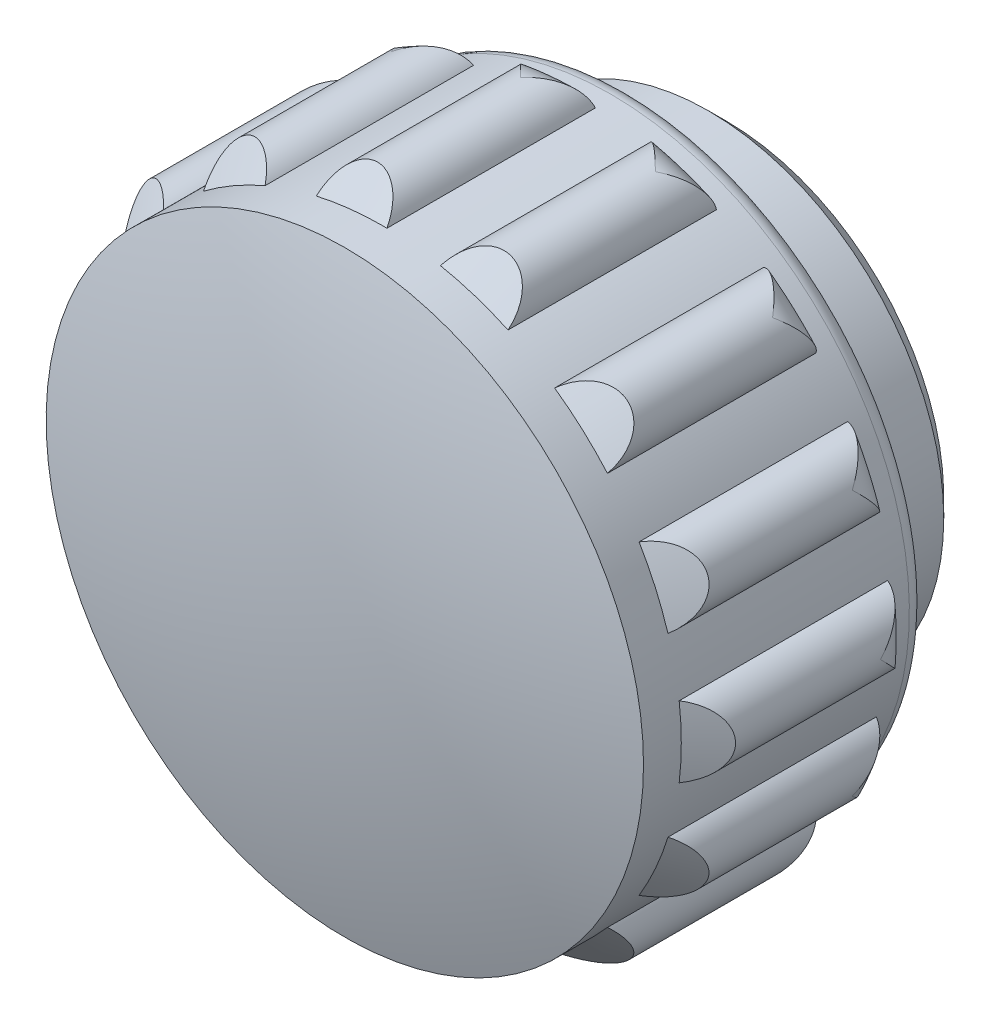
ISO-10303-21;
HEADER;
FILE_DESCRIPTION(('STEP AP214'),'2;1');
FILE_NAME('part.step','',(''),(''),'','','');
FILE_SCHEMA(('AUTOMOTIVE_DESIGN { 1 0 10303 214 1 1 1 1 }'));
ENDSEC;
DATA;
#1=APPLICATION_CONTEXT('core data for automotive mechanical design processes');
#2=APPLICATION_PROTOCOL_DEFINITION('international standard','automotive_design',2000,#1);
#3=PRODUCT_CONTEXT('',#1,'mechanical');
#4=PRODUCT('Part','Part','',(#3));
#5=PRODUCT_RELATED_PRODUCT_CATEGORY('part','',(#4));
#6=PRODUCT_DEFINITION_FORMATION('','',#4);
#7=PRODUCT_DEFINITION_CONTEXT('part definition',#1,'design');
#8=PRODUCT_DEFINITION('design','',#6,#7);
#9=PRODUCT_DEFINITION_SHAPE('','',#8);
#10=(LENGTH_UNIT() NAMED_UNIT(*) SI_UNIT(.MILLI.,.METRE.));
#11=(NAMED_UNIT(*) PLANE_ANGLE_UNIT() SI_UNIT($,.RADIAN.));
#12=(NAMED_UNIT(*) SI_UNIT($,.STERADIAN.) SOLID_ANGLE_UNIT());
#13=UNCERTAINTY_MEASURE_WITH_UNIT(LENGTH_MEASURE(1.E-05),#10,'distance_accuracy_value','');
#14=(GEOMETRIC_REPRESENTATION_CONTEXT(3) GLOBAL_UNCERTAINTY_ASSIGNED_CONTEXT((#13)) GLOBAL_UNIT_ASSIGNED_CONTEXT((#10,
#11,#12)) REPRESENTATION_CONTEXT('',''));
#15=CARTESIAN_POINT('',(0.,0.,0.));
#16=DIRECTION('',(0.,0.,1.));
#17=DIRECTION('',(1.,0.,0.));
#18=AXIS2_PLACEMENT_3D('',#15,#16,#17);
#19=CARTESIAN_POINT('',(0.,0.,5.05000000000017));
#20=DIRECTION('',(0.,0.,-1.));
#21=DIRECTION('',(0.,1.,0.));
#22=AXIS2_PLACEMENT_3D('',#19,#20,#21);
#23=TOROIDAL_SURFACE('',#22,7.95000000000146,1.04999999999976);
#24=CARTESIAN_POINT('',(7.0838055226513,4.22835383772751,4.04371119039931));
#25=CARTESIAN_POINT('',(7.13715963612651,4.2406627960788,4.05923512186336));
#26=CARTESIAN_POINT('',(7.19019720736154,4.2482658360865,4.07838353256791));
#27=CARTESIAN_POINT('',(7.29389489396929,4.25511771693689,4.12222892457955));
#28=CARTESIAN_POINT('',(7.34457379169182,4.25445129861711,4.14686708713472));
#29=CARTESIAN_POINT('',(7.45403067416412,4.24508011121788,4.20639555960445));
#30=CARTESIAN_POINT('',(7.51206178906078,4.23459858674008,4.24234509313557));
#31=CARTESIAN_POINT('',(7.62291326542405,4.2048759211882,4.31878278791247));
#32=CARTESIAN_POINT('',(7.67570733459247,4.18559306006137,4.35929186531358));
#33=CARTESIAN_POINT('',(7.79126183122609,4.13255085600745,4.45674693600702));
#34=CARTESIAN_POINT('',(7.8518458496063,4.09613730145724,4.51482067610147));
#35=CARTESIAN_POINT('',(7.96222763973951,4.01363592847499,4.63405882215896));
#36=CARTESIAN_POINT('',(8.01202766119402,3.96755013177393,4.6952225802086));
#37=CARTESIAN_POINT('',(8.09016745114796,3.87950142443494,4.80462404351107));
#38=CARTESIAN_POINT('',(8.12080039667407,3.83911270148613,4.85252342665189));
#39=CARTESIAN_POINT('',(8.1754048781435,3.75465416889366,4.94873993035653));
#40=CARTESIAN_POINT('',(8.19938824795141,3.71059108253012,4.99705614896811));
#41=CARTESIAN_POINT('',(8.22059738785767,3.66356644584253,5.04689275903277));
#42=CARTESIAN_POINT('',(8.22125503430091,3.66209888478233,5.04844640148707));
#43=CARTESIAN_POINT('',(8.22190911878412,3.66062978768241,5.05000000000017));
#44=B_SPLINE_CURVE_WITH_KNOTS('',3,(#24,#25,#26,#27,#28,#29,#30,#31,#32,#33,#34,#35,#36,#37,#38,
#39,#40,#41,#42,#43),.UNSPECIFIED.,.F.,.F.,(4,2,2,2,2,2,2,2,2,4),(0.,0.169958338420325,
0.338176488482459,0.544284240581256,0.751379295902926,1.02439161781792,1.29734693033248,
1.50618922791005,1.71465743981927,1.72136565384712),.UNSPECIFIED.);
#45=CARTESIAN_POINT('',(7.08400552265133,4.22839990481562,4.04376941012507));
#46=VERTEX_POINT('',#45);
#47=CARTESIAN_POINT('',(8.22190911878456,3.66062978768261,5.05000000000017));
#48=VERTEX_POINT('',#47);
#49=EDGE_CURVE('E557',#46,#48,#44,.T.);
#50=ORIENTED_EDGE('',*,*,#49,.T.);
#51=CARTESIAN_POINT('',(8.22190911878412,3.66062978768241,5.05000000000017));
#52=CARTESIAN_POINT('',(8.22256319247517,3.65916070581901,5.04844641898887));
#53=CARTESIAN_POINT('',(8.22321375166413,3.65768998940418,5.0468927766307));
#54=CARTESIAN_POINT('',(8.2544527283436,3.58660548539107,4.97188045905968));
#55=CARTESIAN_POINT('',(8.27717361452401,3.51336492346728,4.89830525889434));
#56=CARTESIAN_POINT('',(8.30551077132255,3.36186236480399,4.75269918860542));
#57=CARTESIAN_POINT('',(8.31108777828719,3.28358925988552,4.68067223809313));
#58=CARTESIAN_POINT('',(8.30408516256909,3.14318729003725,4.55685247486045));
#59=CARTESIAN_POINT('',(8.29544586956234,3.08156271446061,4.50426623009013));
#60=CARTESIAN_POINT('',(8.26577136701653,2.95829303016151,4.40271591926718));
#61=CARTESIAN_POINT('',(8.2447551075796,2.89664809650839,4.35374644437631));
#62=CARTESIAN_POINT('',(8.19605583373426,2.79076924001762,4.27315471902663));
#63=CARTESIAN_POINT('',(8.17141792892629,2.74608669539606,4.24028379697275));
#64=CARTESIAN_POINT('',(8.1139638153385,2.65916047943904,4.17894644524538));
#65=CARTESIAN_POINT('',(8.08117715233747,2.61690866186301,4.15046469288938));
#66=CARTESIAN_POINT('',(8.02060284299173,2.55109587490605,4.1087068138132));
#67=CARTESIAN_POINT('',(7.99533575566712,2.52632713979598,4.09366841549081));
#68=CARTESIAN_POINT('',(7.94132570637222,2.47887007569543,4.06640469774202));
#69=CARTESIAN_POINT('',(7.91256783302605,2.45619145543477,4.05419214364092));
#70=CARTESIAN_POINT('',(7.88215305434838,2.43489025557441,4.04367058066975));
#71=B_SPLINE_CURVE_WITH_KNOTS('',3,(#51,#52,#53,#54,#55,#56,#57,#58,#59,#60,#61,#62,#63,#64,#65,
#66,#67,#68,#69,#70),.UNSPECIFIED.,.F.,.F.,(4,2,2,2,2,2,2,2,2,4),(0.,0.0067082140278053,
0.323872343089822,0.641762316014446,0.885326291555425,1.1285183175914,1.30999751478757,
1.49082806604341,1.60587369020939,1.72142928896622),.UNSPECIFIED.);
#72=CARTESIAN_POINT('',(7.88243842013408,2.43509025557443,4.04376941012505));
#73=VERTEX_POINT('',#72);
#74=EDGE_CURVE('E562',#48,#73,#71,.T.);
#75=ORIENTED_EDGE('',*,*,#74,.T.);
#76=CARTESIAN_POINT('',(0.,0.,4.04376941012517));
#77=DIRECTION('',(0.,0.,-1.));
#78=DIRECTION('',(0.,1.,0.));
#79=AXIS2_PLACEMENT_3D('',#76,#77,#78);
#80=CIRCLE('',#79,8.25000000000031);
#81=EDGE_CURVE('E573',#46,#73,#80,.T.);
#82=ORIENTED_EDGE('',*,*,#81,.F.);
#83=EDGE_LOOP('',(#50,#75,#82));
#84=FACE_BOUND('',#83,.T.);
#85=ADVANCED_FACE('F14',(#84),#23,.T.);
#86=CARTESIAN_POINT('',(4.75151588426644,6.74400959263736,4.04369840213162));
#87=CARTESIAN_POINT('',(4.79524813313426,6.77695656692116,4.05921970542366));
#88=CARTESIAN_POINT('',(4.84060548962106,6.8054760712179,4.07836547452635));
#89=CARTESIAN_POINT('',(4.93254668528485,6.85391663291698,4.1222056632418));
#90=CARTESIAN_POINT('',(4.97911321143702,6.87392273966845,4.14684126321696));
#91=CARTESIAN_POINT('',(5.08291394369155,6.90988630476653,4.20636378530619));
#92=CARTESIAN_POINT('',(5.14018861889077,6.92391705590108,4.24230988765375));
#93=CARTESIAN_POINT('',(5.25354112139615,6.9418574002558,4.31874081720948));
#94=CARTESIAN_POINT('',(5.30961190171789,6.94571819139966,4.3592465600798));
#95=CARTESIAN_POINT('',(5.43674685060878,6.94427007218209,4.45669448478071));
#96=CARTESIAN_POINT('',(5.50690251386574,6.93565123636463,4.51476450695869));
#97=CARTESIAN_POINT('',(5.64129594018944,6.90518894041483,4.63399556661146));
#98=CARTESIAN_POINT('',(5.70553493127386,6.88334823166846,4.69515595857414));
#99=CARTESIAN_POINT('',(5.81274535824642,6.83469761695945,4.80456540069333));
#100=CARTESIAN_POINT('',(5.85717005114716,6.81025652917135,4.85247632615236));
#101=CARTESIAN_POINT('',(5.94142902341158,6.75529895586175,4.94871623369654));
#102=CARTESIAN_POINT('',(5.98127138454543,6.72479343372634,4.99704431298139));
#103=CARTESIAN_POINT('',(6.01978268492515,6.69045267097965,5.04689275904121));
#104=CARTESIAN_POINT('',(6.02098038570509,6.68937947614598,5.04844640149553));
#105=CARTESIAN_POINT('',(6.02217545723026,6.68830342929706,5.05000000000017));
#106=B_SPLINE_CURVE_WITH_KNOTS('',3,(#86,#87,#88,#89,#90,#91,#92,#93,#94,#95,#96,#97,#98,#99,
#100,#101,#102,#103,#104,#105),.UNSPECIFIED.,.F.,.F.,(4,2,2,2,2,2,2,2,2,4),(0.,
0.169952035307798,0.338163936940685,0.544261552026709,0.751346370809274,1.02434724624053,
1.29729133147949,1.50618490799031,1.71470422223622,1.72141243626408),.UNSPECIFIED.);
#107=CARTESIAN_POINT('',(4.75171588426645,6.74416015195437,4.04376941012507));
#108=VERTEX_POINT('',#107);
#109=CARTESIAN_POINT('',(6.02217545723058,6.68830342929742,5.05000000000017));
#110=VERTEX_POINT('',#109);
#111=EDGE_CURVE('E524',#108,#110,#106,.T.);
#112=ORIENTED_EDGE('',*,*,#111,.T.);
#113=CARTESIAN_POINT('',(6.02217545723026,6.68830342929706,5.05000000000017));
#114=CARTESIAN_POINT('',(6.02337051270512,6.68722739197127,5.04844641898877));
#115=CARTESIAN_POINT('',(6.02456302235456,6.68614843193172,5.04689277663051));
#116=CARTESIAN_POINT('',(6.08201391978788,6.63391554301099,4.97188045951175));
#117=CARTESIAN_POINT('',(6.13256010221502,6.57624837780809,4.89830525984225));
#118=CARTESIAN_POINT('',(6.22006902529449,6.44936966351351,4.75269918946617));
#119=CARTESIAN_POINT('',(6.25700041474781,6.38013199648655,4.68067223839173));
#120=CARTESIAN_POINT('',(6.30770983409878,6.24902019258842,4.55685247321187));
#121=CARTESIAN_POINT('',(6.324882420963,6.18920942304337,4.50426622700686));
#122=CARTESIAN_POINT('',(6.34791170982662,6.06452725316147,4.4027159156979));
#123=CARTESIAN_POINT('',(6.3537856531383,5.9996637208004,4.35374644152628));
#124=CARTESIAN_POINT('',(6.35236146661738,5.88313080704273,4.27315472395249));
#125=CARTESIAN_POINT('',(6.34802765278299,5.83229014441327,4.24028380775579));
#126=CARTESIAN_POINT('',(6.33089677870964,5.72951038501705,4.17894644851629));
#127=CARTESIAN_POINT('',(6.31813002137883,5.67757586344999,4.15046468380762));
#128=CARTESIAN_POINT('',(6.28956685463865,5.59283212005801,4.10871518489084));
#129=CARTESIAN_POINT('',(6.27656627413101,5.55994466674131,4.09368393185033));
#130=CARTESIAN_POINT('',(6.24654782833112,5.49465585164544,4.06643139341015));
#131=CARTESIAN_POINT('',(6.22951243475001,5.46225728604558,4.05422284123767));
#132=CARTESIAN_POINT('',(6.21040533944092,5.43044218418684,4.0437032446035));
#133=B_SPLINE_CURVE_WITH_KNOTS('',3,(#113,#114,#115,#116,#117,#118,#119,#120,#121,#122,#123,
#124,#125,#126,#127,#128,#129,#130,#131,#132),.UNSPECIFIED.,.F.,.F.,(4,2,2,2,2,2,2,2,2,4),(0.,
0.00670821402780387,0.323872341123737,0.641762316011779,0.885326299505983,1.12851831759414,
1.30999749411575,1.49082806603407,1.60581443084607,1.72130979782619),.UNSPECIFIED.);
#134=CARTESIAN_POINT('',(6.21052537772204,5.43064218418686,4.04376941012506));
#135=VERTEX_POINT('',#134);
#136=EDGE_CURVE('E545',#110,#135,#133,.T.);
#137=ORIENTED_EDGE('',*,*,#136,.T.);
#138=EDGE_CURVE('E581',#108,#135,#80,.T.);
#139=ORIENTED_EDGE('',*,*,#138,.F.);
#140=EDGE_LOOP('',(#112,#137,#139));
#141=FACE_BOUND('',#140,.T.);
#142=ADVANCED_FACE('F336',(#141),#23,.T.);
#143=CARTESIAN_POINT('',(1.59761140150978,8.09343337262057,4.04365250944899));
#144=CARTESIAN_POINT('',(1.62415173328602,8.14131919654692,4.05916437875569));
#145=CARTESIAN_POINT('',(1.65397767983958,8.18582277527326,4.07830066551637));
#146=CARTESIAN_POINT('',(1.7182480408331,8.26747596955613,4.12212217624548));
#147=CARTESIAN_POINT('',(1.75264203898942,8.30469621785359,4.14674857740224));
#148=CARTESIAN_POINT('',(1.83281908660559,8.37977782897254,4.20624973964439));
#149=CARTESIAN_POINT('',(1.87942276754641,8.41589637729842,4.24218352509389));
#150=CARTESIAN_POINT('',(1.97565441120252,8.47840316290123,4.31859016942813));
#151=CARTESIAN_POINT('',(2.02529578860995,8.50474397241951,4.35908394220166));
#152=CARTESIAN_POINT('',(2.14200489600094,8.55515286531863,4.45650621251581));
#153=CARTESIAN_POINT('',(2.20958945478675,8.5758280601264,4.51456288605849));
#154=CARTESIAN_POINT('',(2.34473374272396,8.60269288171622,4.63376850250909));
#155=CARTESIAN_POINT('',(2.41229347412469,8.60888547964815,4.69491680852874));
#156=CARTESIAN_POINT('',(2.53006225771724,8.60807882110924,4.80435488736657));
#157=CARTESIAN_POINT('',(2.58063381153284,8.60382611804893,4.85230724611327));
#158=CARTESIAN_POINT('',(2.68005196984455,8.58789010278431,4.94863116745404));
#159=CARTESIAN_POINT('',(2.72890150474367,8.57622012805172,4.99700182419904));
#160=CARTESIAN_POINT('',(2.77809286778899,8.56049884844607,5.04689275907));
#161=CARTESIAN_POINT('',(2.77962352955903,8.56000558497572,5.04844640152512));
#162=CARTESIAN_POINT('',(2.78115294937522,8.55950864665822,5.05000000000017));
#163=B_SPLINE_CURVE_WITH_KNOTS('',3,(#143,#144,#145,#146,#147,#148,#149,#150,#151,#152,#153,
#154,#155,#156,#157,#158,#159,#160,#161,#162),.UNSPECIFIED.,.F.,.F.,(4,2,2,2,2,2,2,2,2,4),(0.,
0.169929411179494,0.33811888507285,0.544180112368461,0.751228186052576,1.02418796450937,
1.29709173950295,1.50616939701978,1.71487215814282,1.72158037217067),.UNSPECIFIED.);
#164=CARTESIAN_POINT('',(1.59781140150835,8.09379384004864,4.04376941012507));
#165=VERTEX_POINT('',#164);
#166=CARTESIAN_POINT('',(2.78115294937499,8.55950864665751,5.05000000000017));
#167=VERTEX_POINT('',#166);
#168=EDGE_CURVE('E1297',#165,#167,#163,.T.);
#169=ORIENTED_EDGE('',*,*,#168,.T.);
#170=CARTESIAN_POINT('',(2.78115294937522,8.55950864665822,5.05000000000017));
#171=CARTESIAN_POINT('',(2.78268235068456,8.55901171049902,5.04844641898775));
#172=CARTESIAN_POINT('',(2.78421061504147,8.55851106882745,5.04689277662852));
#173=CARTESIAN_POINT('',(2.85793965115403,8.53416133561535,4.97188045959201));
#174=CARTESIAN_POINT('',(2.92757123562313,8.50203874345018,4.89830526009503));
#175=CARTESIAN_POINT('',(3.05912083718,8.42172235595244,4.7526991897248));
#176=CARTESIAN_POINT('',(3.12102083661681,8.37349194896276,4.68067223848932));
#177=CARTESIAN_POINT('',(3.22067417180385,8.27434073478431,4.55685247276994));
#178=CARTESIAN_POINT('',(3.26068934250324,8.22668559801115,4.5042662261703));
#179=CARTESIAN_POINT('',(3.33244045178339,8.12214962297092,4.4027159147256));
#180=CARTESIAN_POINT('',(3.36418894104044,8.06528298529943,4.35374644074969));
#181=CARTESIAN_POINT('',(3.41028608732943,7.95824560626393,4.2731547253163));
#182=CARTESIAN_POINT('',(3.42700571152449,7.91003763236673,4.24028381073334));
#183=CARTESIAN_POINT('',(3.45316017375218,7.80917589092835,4.17894644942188));
#184=CARTESIAN_POINT('',(3.46262083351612,7.75653862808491,4.15046468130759));
#185=CARTESIAN_POINT('',(3.47099500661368,7.66750861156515,4.10871749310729));
#186=CARTESIAN_POINT('',(3.47249495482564,7.63218175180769,4.09368821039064));
#187=CARTESIAN_POINT('',(3.47162831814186,7.56033842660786,4.06643875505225));
#188=CARTESIAN_POINT('',(3.46924459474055,7.52381738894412,4.05423130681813));
#189=CARTESIAN_POINT('',(3.46473162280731,7.48698674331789,4.04371225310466));
#190=B_SPLINE_CURVE_WITH_KNOTS('',3,(#170,#171,#172,#173,#174,#175,#176,#177,#178,#179,#180,
#181,#182,#183,#184,#185,#186,#187,#188,#189),.UNSPECIFIED.,.F.,.F.,(4,2,2,2,2,2,2,2,2,4),(0.,
0.00670821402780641,0.323872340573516,0.641762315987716,0.885326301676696,1.1285183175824,
1.30999748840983,1.49082806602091,1.60579809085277,1.72127684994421),.UNSPECIFIED.);
#191=CARTESIAN_POINT('',(3.4647560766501,7.48718674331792,4.04376941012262));
#192=VERTEX_POINT('',#191);
#193=EDGE_CURVE('E525',#167,#192,#190,.T.);
#194=ORIENTED_EDGE('',*,*,#193,.T.);
#195=EDGE_CURVE('E294',#165,#192,#80,.T.);
#196=ORIENTED_EDGE('',*,*,#195,.F.);
#197=EDGE_LOOP('',(#169,#194,#196));
#198=FACE_BOUND('',#197,.T.);
#199=ADVANCED_FACE('F344',(#198),#23,.T.);
#200=CARTESIAN_POINT('',(-1.8323691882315,8.04393704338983,4.04376941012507));
#201=VERTEX_POINT('',#200);
#202=CARTESIAN_POINT('',(0.119898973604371,8.24912869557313,4.04376941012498));
#203=VERTEX_POINT('',#202);
#204=EDGE_CURVE('E290',#201,#203,#80,.T.);
#205=ORIENTED_EDGE('',*,*,#204,.F.);
#206=CARTESIAN_POINT('',(-1.83238678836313,8.04373704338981,4.04371245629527));
#207=CARTESIAN_POINT('',(-1.82760571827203,8.09828361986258,4.05923664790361));
#208=CARTESIAN_POINT('',(-1.81844685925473,8.15107489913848,4.07838532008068));
#209=CARTESIAN_POINT('',(-1.79291849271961,8.25181470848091,4.12223122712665));
#210=CARTESIAN_POINT('',(-1.77662377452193,8.29980728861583,4.1468696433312));
#211=CARTESIAN_POINT('',(-1.73388656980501,8.40101116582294,4.2063987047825));
#212=CARTESIAN_POINT('',(-1.70598507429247,8.45296307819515,4.24234857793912));
#213=CARTESIAN_POINT('',(-1.64346140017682,8.54920423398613,4.31878694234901));
#214=CARTESIAN_POINT('',(-1.60880766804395,8.59345557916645,4.35929634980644));
#215=CARTESIAN_POINT('',(-1.52265240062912,8.68696321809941,4.45675212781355));
#216=CARTESIAN_POINT('',(-1.46929911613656,8.73332941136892,4.51482623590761));
#217=CARTESIAN_POINT('',(-1.35672494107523,8.81281385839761,4.63406508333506));
#218=CARTESIAN_POINT('',(-1.29750527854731,8.84593487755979,4.69522917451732));
#219=CARTESIAN_POINT('',(-1.1896200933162,8.89304045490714,4.80462984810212));
#220=CARTESIAN_POINT('',(-1.14174313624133,8.90969263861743,4.852528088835));
#221=CARTESIAN_POINT('',(-1.04454687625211,8.93552447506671,4.94874227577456));
#222=CARTESIAN_POINT('',(-0.995230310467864,8.94471745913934,4.99705732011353));
#223=CARTESIAN_POINT('',(-0.943954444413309,8.95035700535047,5.04689275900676));
#224=CARTESIAN_POINT('',(-0.942355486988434,8.95052896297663,5.0484464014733));
#225=CARTESIAN_POINT('',(-0.94075616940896,8.95069705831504,5.05000000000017));
#226=B_SPLINE_CURVE_WITH_KNOTS('',3,(#206,#207,#208,#209,#210,#211,#212,#213,#214,#215,#216,
#217,#218,#219,#220,#221,#222,#223,#224,#225),.UNSPECIFIED.,.F.,.F.,(4,2,2,2,2,2,2,2,2,4),(0.,
0.169958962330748,0.33817773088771,0.544286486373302,0.75138255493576,1.02439600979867,
1.29735243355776,1.50618965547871,1.71465280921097,1.72136102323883),.UNSPECIFIED.);
#227=CARTESIAN_POINT('',(-0.940756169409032,8.95069705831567,5.05000000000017));
#228=VERTEX_POINT('',#227);
#229=EDGE_CURVE('E1288',#201,#228,#226,.T.);
#230=ORIENTED_EDGE('',*,*,#229,.T.);
#231=CARTESIAN_POINT('',(-0.94075616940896,8.95069705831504,5.05000000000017));
#232=CARTESIAN_POINT('',(-0.939156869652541,8.95086514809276,5.04844641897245));
#233=CARTESIAN_POINT('',(-0.937557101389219,8.95102939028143,5.04689277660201));
#234=CARTESIAN_POINT('',(-0.860300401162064,8.95877289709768,4.97188245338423));
#235=CARTESIAN_POINT('',(-0.783625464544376,8.9577494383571,4.89830926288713));
#236=CARTESIAN_POINT('',(-0.630781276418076,8.93788375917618,4.75270310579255));
#237=CARTESIAN_POINT('',(-0.554613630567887,8.91899979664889,4.6806741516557));
#238=CARTESIAN_POINT('',(-0.423233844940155,8.86894826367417,4.55684166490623));
#239=CARTESIAN_POINT('',(-0.36728401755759,8.84168225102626,4.50424505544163));
#240=CARTESIAN_POINT('',(-0.259218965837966,8.77536263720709,4.40269611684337));
#241=CARTESIAN_POINT('',(-0.207096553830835,8.73633187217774,4.35373695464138));
#242=CARTESIAN_POINT('',(-0.121490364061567,8.65733692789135,4.27318450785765));
#243=CARTESIAN_POINT('',(-0.0866370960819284,8.62013321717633,4.24034084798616));
#244=CARTESIAN_POINT('',(-0.0217109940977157,8.53863931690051,4.17899546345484));
#245=CARTESIAN_POINT('',(0.00837058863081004,8.49436240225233,4.1504857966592));
#246=CARTESIAN_POINT('',(0.0523429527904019,8.41624413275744,4.10863395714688));
#247=CARTESIAN_POINT('',(0.0681557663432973,8.38441580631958,4.09353426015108));
#248=CARTESIAN_POINT('',(0.0966180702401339,8.3182437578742,4.06625125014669));
#249=CARTESIAN_POINT('',(0.10927253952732,8.28390410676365,4.05406334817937));
#250=CARTESIAN_POINT('',(0.131910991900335,8.20982091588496,4.03213326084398));
#251=CARTESIAN_POINT('',(0.141546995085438,8.16987001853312,4.02271472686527));
#252=CARTESIAN_POINT('',(0.152310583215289,8.10858344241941,4.01205542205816));
#253=CARTESIAN_POINT('',(0.155287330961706,8.08785118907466,4.00907603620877));
#254=CARTESIAN_POINT('',(0.159943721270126,8.04609002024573,4.00434271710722));
#255=CARTESIAN_POINT('',(0.161622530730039,8.02506092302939,4.00258957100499));
#256=CARTESIAN_POINT('',(0.162630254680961,8.00395354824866,4.00147340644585));
#257=B_SPLINE_CURVE_WITH_KNOTS('',3,(#231,#232,#233,#234,#235,#236,#237,#238,#239,#240,#241,
#242,#243,#244,#245,#246,#247,#248,#249,#250,#251,#252,#253,#254,#255,#256),.UNSPECIFIED.,.F.,
.F.,(4,2,2,2,2,2,2,2,2,2,2,2,4),(0.,0.00670821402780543,0.323863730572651,0.641762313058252,
0.885375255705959,1.12851834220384,1.30984136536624,1.49082799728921,1.60639403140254,
1.72177671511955,1.84766325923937,1.91106210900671,1.97450161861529),.UNSPECIFIED.);
#258=EDGE_CURVE('E653',#228,#203,#257,.T.);
#259=ORIENTED_EDGE('',*,*,#258,.T.);
#260=EDGE_LOOP('',(#205,#230,#259));
#261=FACE_BOUND('',#260,.T.);
#262=ADVANCED_FACE('F1268',(#261),#23,.T.);
#263=CARTESIAN_POINT('',(-4.94564774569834,6.60301045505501,4.04370941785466));
#264=CARTESIAN_POINT('',(-4.9634665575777,6.65478535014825,4.059232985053));
#265=CARTESIAN_POINT('',(-4.97657217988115,6.7067373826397,4.0783810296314));
#266=CARTESIAN_POINT('',(-4.99422652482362,6.80915034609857,4.12222570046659));
#267=CARTESIAN_POINT('',(-4.99886148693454,6.85962109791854,4.14686350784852));
#268=CARTESIAN_POINT('',(-5.00098378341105,6.96945748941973,4.20639115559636));
#269=CARTESIAN_POINT('',(-4.99662605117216,7.02826609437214,4.24234021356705));
#270=CARTESIAN_POINT('',(-4.97865433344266,7.14161682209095,4.31877697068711));
#271=CARTESIAN_POINT('',(-4.96499610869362,7.19613715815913,4.35928558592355));
#272=CARTESIAN_POINT('',(-4.9243244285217,7.31660293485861,4.45673966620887));
#273=CARTESIAN_POINT('',(-4.89444380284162,7.38066135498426,4.51481289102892));
#274=CARTESIAN_POINT('',(-4.82393382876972,7.49906241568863,4.63405005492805));
#275=CARTESIAN_POINT('',(-4.78330672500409,7.55340708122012,4.69521334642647));
#276=CARTESIAN_POINT('',(-4.70390807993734,7.64032434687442,4.80461591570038));
#277=CARTESIAN_POINT('',(-4.66694160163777,7.67501274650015,4.85251689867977));
#278=CARTESIAN_POINT('',(-4.58865109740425,7.73814899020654,4.9487366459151));
#279=CARTESIAN_POINT('',(-4.54733499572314,7.76660790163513,4.99705450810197));
#280=CARTESIAN_POINT('',(-4.50278345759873,7.79261712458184,5.04689275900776));
#281=CARTESIAN_POINT('',(-4.50139267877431,7.79342457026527,5.04844640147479));
#282=CARTESIAN_POINT('',(-4.50000000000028,7.79422863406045,5.05000000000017));
#283=B_SPLINE_CURVE_WITH_KNOTS('',3,(#263,#264,#265,#266,#267,#268,#269,#270,#271,#272,#273,
#274,#275,#276,#277,#278,#279,#280,#281,#282),.UNSPECIFIED.,.F.,.F.,(4,2,2,2,2,2,2,2,2,4),(0.,
0.169957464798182,0.338174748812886,0.544281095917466,0.751374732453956,1.02438546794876,
1.29733922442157,1.50618862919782,1.71466392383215,1.72137213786),.UNSPECIFIED.);
#284=CARTESIAN_POINT('',(-4.94571649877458,6.60321045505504,4.04376941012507));
#285=VERTEX_POINT('',#284);
#286=CARTESIAN_POINT('',(-4.5000000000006,7.79422863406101,5.05000000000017));
#287=VERTEX_POINT('',#286);
#288=EDGE_CURVE('E650',#285,#287,#283,.T.);
#289=ORIENTED_EDGE('',*,*,#288,.T.);
#290=CARTESIAN_POINT('',(-4.50000000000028,7.79422863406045,5.05000000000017));
#291=CARTESIAN_POINT('',(-4.4986073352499,7.79503268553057,5.04844641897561));
#292=CARTESIAN_POINT('',(-4.49721267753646,7.7958334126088,5.04689277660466));
#293=CARTESIAN_POINT('',(-4.42978294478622,7.83433161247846,4.97188045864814));
#294=CARTESIAN_POINT('',(-4.35931858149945,7.86458375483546,4.89830525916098));
#295=CARTESIAN_POINT('',(-4.21160800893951,7.90860200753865,4.75269918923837));
#296=CARTESIAN_POINT('',(-4.13434664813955,7.92233023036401,4.68067223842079));
#297=CARTESIAN_POINT('',(-3.99398184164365,7.93004197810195,4.55685247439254));
#298=CARTESIAN_POINT('',(-3.93179179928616,7.92789153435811,4.50426622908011));
#299=CARTESIAN_POINT('',(-3.80609556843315,7.91126478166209,4.40271591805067));
#300=CARTESIAN_POINT('',(-3.74259153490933,7.8968073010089,4.35374644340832));
#301=CARTESIAN_POINT('',(-3.63220223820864,7.85944216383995,4.2731547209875));
#302=CARTESIAN_POINT('',(-3.58518911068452,7.8396098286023,4.24028380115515));
#303=CARTESIAN_POINT('',(-3.4927334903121,7.79155671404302,4.17894644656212));
#304=CARTESIAN_POINT('',(-3.44728598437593,7.76336616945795,4.15046468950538));
#305=CARTESIAN_POINT('',(-3.37550746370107,7.7100070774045,4.10870999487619));
#306=CARTESIAN_POINT('',(-3.34823851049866,7.68747221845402,4.09367431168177));
#307=CARTESIAN_POINT('',(-3.2954055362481,7.63872966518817,4.06641484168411));
#308=CARTESIAN_POINT('',(-3.26984960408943,7.61250614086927,4.05420380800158));
#309=CARTESIAN_POINT('',(-3.24548975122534,7.5844914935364,4.04368299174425));
#310=B_SPLINE_CURVE_WITH_KNOTS('',3,(#290,#291,#292,#293,#294,#295,#296,#297,#298,#299,#300,
#301,#302,#303,#304,#305,#306,#307,#308,#309),.UNSPECIFIED.,.F.,.F.,(4,2,2,2,2,2,2,2,2,4),(0.,
0.00670821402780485,0.32387234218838,0.6417623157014,0.885326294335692,1.12851831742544,
1.30999750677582,1.49082806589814,1.60585117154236,1.72138388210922),.UNSPECIFIED.);
#311=CARTESIAN_POINT('',(-3.24568975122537,7.58472135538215,4.04376941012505));
#312=VERTEX_POINT('',#311);
#313=EDGE_CURVE('E651',#287,#312,#310,.T.);
#314=ORIENTED_EDGE('',*,*,#313,.T.);
#315=EDGE_CURVE('E293',#285,#312,#80,.T.);
#316=ORIENTED_EDGE('',*,*,#315,.F.);
#317=EDGE_LOOP('',(#289,#314,#316));
#318=FACE_BOUND('',#317,.T.);
#319=ADVANCED_FACE('F649',(#318),#23,.T.);
#320=CARTESIAN_POINT('',(-7.20371816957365,4.02052879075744,4.04369187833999));
#321=CARTESIAN_POINT('',(-7.24105634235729,4.06057616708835,4.05921184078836));
#322=CARTESIAN_POINT('',(-7.2741613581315,4.10270263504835,4.07835626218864));
#323=CARTESIAN_POINT('',(-7.33194852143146,4.18907431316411,4.12219379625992));
#324=CARTESIAN_POINT('',(-7.35671344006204,4.23329341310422,4.14682808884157));
#325=CARTESIAN_POINT('',(-7.40333212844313,4.33276367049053,4.20634757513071));
#326=CARTESIAN_POINT('',(-7.42327409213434,4.38825650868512,4.24229192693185));
#327=CARTESIAN_POINT('',(-7.45296751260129,4.49911009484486,4.31871940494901));
#328=CARTESIAN_POINT('',(-7.4626697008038,4.55446893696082,4.35922344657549));
#329=CARTESIAN_POINT('',(-7.47452265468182,4.68105656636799,4.45666772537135));
#330=CARTESIAN_POINT('',(-7.47328669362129,4.75172789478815,4.51473585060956));
#331=CARTESIAN_POINT('',(-7.4570442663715,4.88856787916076,4.6339632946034));
#332=CARTESIAN_POINT('',(-7.44204065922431,4.95473746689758,4.69512196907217));
#333=CARTESIAN_POINT('',(-7.40486563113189,5.06645263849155,4.80453548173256));
#334=CARTESIAN_POINT('',(-7.38520087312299,5.11319531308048,4.85245229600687));
#335=CARTESIAN_POINT('',(-7.33934771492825,5.20274952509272,4.94870414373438));
#336=CARTESIAN_POINT('',(-7.31317106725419,5.24556795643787,4.99703827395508));
#337=CARTESIAN_POINT('',(-7.28304030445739,5.28746294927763,5.04689275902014));
#338=CARTESIAN_POINT('',(-7.28209818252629,5.2887662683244,5.04844640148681));
#339=CARTESIAN_POINT('',(-7.28115294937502,5.29006727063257,5.05000000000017));
#340=B_SPLINE_CURVE_WITH_KNOTS('',3,(#320,#321,#322,#323,#324,#325,#326,#327,#328,#329,#330,
#331,#332,#333,#334,#335,#336,#337,#338,#339),.UNSPECIFIED.,.F.,.F.,(4,2,2,2,2,2,2,2,2,4),(0.,
0.16994881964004,0.338157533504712,0.544249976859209,0.751329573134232,1.02432460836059,
1.29726296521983,1.50618270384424,1.71472809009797,1.72143630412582),.UNSPECIFIED.);
#341=CARTESIAN_POINT('',(-7.20390449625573,4.02072879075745,4.04376941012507));
#342=VERTEX_POINT('',#341);
#343=CARTESIAN_POINT('',(-7.28115294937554,5.29006727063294,5.05000000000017));
#344=VERTEX_POINT('',#343);
#345=EDGE_CURVE('E677',#342,#344,#340,.T.);
#346=ORIENTED_EDGE('',*,*,#345,.T.);
#347=CARTESIAN_POINT('',(-7.28115294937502,5.29006727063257,5.05000000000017));
#348=CARTESIAN_POINT('',(-7.28020772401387,5.29136825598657,5.04844641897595));
#349=CARTESIAN_POINT('',(-7.27925932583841,5.29266701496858,5.04689277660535));
#350=CARTESIAN_POINT('',(-7.23331782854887,5.35526301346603,4.97188045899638));
#351=CARTESIAN_POINT('',(-7.18125008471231,5.41156015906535,4.89830525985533));
#352=CARTESIAN_POINT('',(-7.06421359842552,5.51185213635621,4.75269918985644));
#353=CARTESIAN_POINT('',(-6.99921560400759,5.55581851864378,4.68067223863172));
#354=CARTESIAN_POINT('',(-6.87412262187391,5.61995506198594,4.55685247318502));
#355=CARTESIAN_POINT('',(-6.8164345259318,5.64328550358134,4.50426622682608));
#356=CARTESIAN_POINT('',(-6.69484259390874,5.67922147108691,4.40271591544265));
#357=CARTESIAN_POINT('',(-6.63094838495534,5.69184332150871,4.35374644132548));
#358=CARTESIAN_POINT('',(-6.5149049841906,5.70260794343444,4.27315472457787));
#359=CARTESIAN_POINT('',(-6.46388982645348,5.70361216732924,4.2402838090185));
#360=CARTESIAN_POINT('',(-6.35988243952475,5.69731854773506,4.17894644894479));
#361=CARTESIAN_POINT('',(-6.30689792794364,5.69005036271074,4.15046468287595));
#362=CARTESIAN_POINT('',(-6.21963467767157,5.67050223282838,4.10871610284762));
#363=CARTESIAN_POINT('',(-6.18557039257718,5.66101119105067,4.09368563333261));
#364=CARTESIAN_POINT('',(-6.11750530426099,5.63798349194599,4.06643432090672));
#365=CARTESIAN_POINT('',(-6.08350544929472,5.62442911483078,4.05422620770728));
#366=CARTESIAN_POINT('',(-6.04986923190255,5.60875364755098,4.04370682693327));
#367=B_SPLINE_CURVE_WITH_KNOTS('',3,(#347,#348,#349,#350,#351,#352,#353,#354,#355,#356,#357,
#358,#359,#360,#361,#362,#363,#364,#365,#366),.UNSPECIFIED.,.F.,.F.,(4,2,2,2,2,2,2,2,2,4),(0.,
0.00670821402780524,0.323872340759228,0.641762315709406,0.885326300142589,1.12851831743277,
1.3099974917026,1.49082806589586,1.60580793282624,1.72129669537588),.UNSPECIFIED.);
#368=CARTESIAN_POINT('',(-6.05006923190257,5.60884678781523,4.04376941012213));
#369=VERTEX_POINT('',#368);
#370=EDGE_CURVE('E683',#344,#369,#367,.T.);
#371=ORIENTED_EDGE('',*,*,#370,.T.);
#372=EDGE_CURVE('E626',#342,#369,#80,.T.);
#373=ORIENTED_EDGE('',*,*,#372,.F.);
#374=EDGE_LOOP('',(#346,#371,#373));
#375=FACE_BOUND('',#374,.T.);
#376=ADVANCED_FACE('F894',(#375),#23,.T.);
#377=CARTESIAN_POINT('',(-8.21600125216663,0.742826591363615,4.04362440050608));
#378=CARTESIAN_POINT('',(-8.26639816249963,0.764209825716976,4.05913048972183));
#379=CARTESIAN_POINT('',(-8.31377569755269,0.789214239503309,4.07826096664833));
#380=CARTESIAN_POINT('',(-8.4017012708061,0.844585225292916,4.12207103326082));
#381=CARTESIAN_POINT('',(-8.44231427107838,0.874894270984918,4.14669179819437));
#382=CARTESIAN_POINT('',(-8.52536864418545,0.946770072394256,4.20617987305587));
#383=CARTESIAN_POINT('',(-8.56616305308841,0.98933508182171,4.24210611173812));
#384=CARTESIAN_POINT('',(-8.63839265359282,1.07849035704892,4.31849787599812));
#385=CARTESIAN_POINT('',(-8.66978209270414,1.12509892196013,4.35898431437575));
#386=CARTESIAN_POINT('',(-8.73212578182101,1.2358838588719,4.4563908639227));
#387=CARTESIAN_POINT('',(-8.75976003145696,1.30092917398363,4.51443935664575));
#388=CARTESIAN_POINT('',(-8.80062155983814,1.43251061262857,4.63362937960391));
#389=CARTESIAN_POINT('',(-8.81385176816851,1.49904643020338,4.69477027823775));
#390=CARTESIAN_POINT('',(-8.82538142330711,1.61627624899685,4.8042258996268));
#391=CARTESIAN_POINT('',(-8.82644494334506,1.66704322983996,4.85220364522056));
#392=CARTESIAN_POINT('',(-8.82099346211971,1.7676377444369,4.94857904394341));
#393=CARTESIAN_POINT('',(-8.81449205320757,1.81746680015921,4.99697578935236));
#394=CARTESIAN_POINT('',(-8.80399331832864,1.8680583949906,5.04689275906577));
#395=CARTESIAN_POINT('',(-8.8036627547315,1.86963223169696,5.04844640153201));
#396=CARTESIAN_POINT('',(-8.80332840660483,1.87120521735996,5.05000000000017));
#397=B_SPLINE_CURVE_WITH_KNOTS('',3,(#377,#378,#379,#380,#381,#382,#383,#384,#385,#386,#387,
#388,#389,#390,#391,#392,#393,#394,#395,#396),.UNSPECIFIED.,.F.,.F.,(4,2,2,2,2,2,2,2,2,4),(0.,
0.16991555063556,0.338091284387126,0.544130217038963,0.751155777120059,1.02409036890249,
1.29696943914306,1.50615989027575,1.71497505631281,1.72168327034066),.UNSPECIFIED.);
#398=CARTESIAN_POINT('',(-8.21647196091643,0.743026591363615,4.04376941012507));
#399=VERTEX_POINT('',#398);
#400=CARTESIAN_POINT('',(-8.80332840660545,1.87120521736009,5.05000000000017));
#401=VERTEX_POINT('',#400);
#402=EDGE_CURVE('E902',#399,#401,#397,.T.);
#403=ORIENTED_EDGE('',*,*,#402,.T.);
#404=CARTESIAN_POINT('',(-8.80332840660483,1.87120521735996,5.05000000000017));
#405=CARTESIAN_POINT('',(-8.80299405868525,1.87277818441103,5.04844641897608));
#406=CARTESIAN_POINT('',(-8.8026559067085,1.87435040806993,5.0468927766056));
#407=CARTESIAN_POINT('',(-8.78614634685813,1.95022078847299,4.9718804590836));
#408=CARTESIAN_POINT('',(-8.76147820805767,2.02282864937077,4.89830526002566));
#409=CARTESIAN_POINT('',(-8.69535247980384,2.16205295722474,4.75269919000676));
#410=CARTESIAN_POINT('',(-8.653856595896,2.22865531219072,4.68067223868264));
#411=CARTESIAN_POINT('',(-8.56566515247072,2.33812685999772,4.55685247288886));
#412=CARTESIAN_POINT('',(-8.52245379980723,2.38290414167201,4.50426622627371));
#413=CARTESIAN_POINT('',(-8.42599051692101,2.46518917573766,4.4027159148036));
#414=CARTESIAN_POINT('',(-8.37275402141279,2.50270792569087,4.35374644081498));
#415=CARTESIAN_POINT('',(-8.27112146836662,2.55974099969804,4.27315472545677));
#416=CARTESIAN_POINT('',(-8.22492525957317,2.58140813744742,4.24028381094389));
#417=CARTESIAN_POINT('',(-8.12734993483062,2.61796224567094,4.17894644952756));
#418=CARTESIAN_POINT('',(-8.07598993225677,2.63287317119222,4.15046468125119));
#419=CARTESIAN_POINT('',(-7.98832319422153,2.65050759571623,4.10871759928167));
#420=CARTESIAN_POINT('',(-7.95334688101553,2.6556919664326,4.09368840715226));
#421=CARTESIAN_POINT('',(-7.88180702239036,2.66233975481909,4.06643909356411));
#422=CARTESIAN_POINT('',(-7.84523713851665,2.66378660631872,4.05423169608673));
#423=CARTESIAN_POINT('',(-7.80813677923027,2.66314826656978,4.04371266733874));
#424=B_SPLINE_CURVE_WITH_KNOTS('',3,(#404,#405,#406,#407,#408,#409,#410,#411,#412,#413,#414,
#415,#416,#417,#418,#419,#420,#421,#422,#423),.UNSPECIFIED.,.F.,.F.,(4,2,2,2,2,2,2,2,2,4),(0.,
0.00670821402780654,0.323872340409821,0.641762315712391,0.885326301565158,1.12851831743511,
1.30999748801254,1.49082806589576,1.6057973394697,1.72127533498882),.UNSPECIFIED.);
#425=CARTESIAN_POINT('',(-7.80833677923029,2.66315165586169,4.04376941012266));
#426=VERTEX_POINT('',#425);
#427=EDGE_CURVE('E903',#401,#426,#424,.T.);
#428=ORIENTED_EDGE('',*,*,#427,.T.);
#429=EDGE_CURVE('E620',#399,#426,#80,.T.);
#430=ORIENTED_EDGE('',*,*,#429,.F.);
#431=EDGE_LOOP('',(#403,#428,#430));
#432=FACE_BOUND('',#431,.T.);
#433=ADVANCED_FACE('F887',(#432),#23,.T.);
#434=CARTESIAN_POINT('',(-7.80813677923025,-2.66314826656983,4.04371266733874));
#435=CARTESIAN_POINT('',(-7.86288432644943,-2.66409501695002,4.05923690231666));
#436=CARTESIAN_POINT('',(-7.91634378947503,-2.66050447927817,4.07838561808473));
#437=CARTESIAN_POINT('',(-8.01920020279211,-2.64564604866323,4.1222316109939));
#438=CARTESIAN_POINT('',(-8.06863314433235,-2.63445713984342,4.14687006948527));
#439=CARTESIAN_POINT('',(-8.17374989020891,-2.60253263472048,4.20639922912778));
#440=CARTESIAN_POINT('',(-8.22833371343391,-2.58021437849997,4.24234915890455));
#441=CARTESIAN_POINT('',(-8.33058315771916,-2.52809303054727,4.31878763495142));
#442=CARTESIAN_POINT('',(-8.37821438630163,-2.49825459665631,4.35929709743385));
#443=CARTESIAN_POINT('',(-8.48021542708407,-2.42234536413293,4.4567529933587));
#444=CARTESIAN_POINT('',(-8.53190452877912,-2.37413086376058,4.51482716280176));
#445=CARTESIAN_POINT('',(-8.62272068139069,-2.27048161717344,4.63406612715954));
#446=CARTESIAN_POINT('',(-8.66185035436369,-2.21504838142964,4.69523027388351));
#447=CARTESIAN_POINT('',(-8.71997473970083,-2.11267815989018,4.80463081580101));
#448=CARTESIAN_POINT('',(-8.74154007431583,-2.06680427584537,4.85252886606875));
#449=CARTESIAN_POINT('',(-8.77738997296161,-1.97284099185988,4.94874266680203));
#450=CARTESIAN_POINT('',(-8.79168750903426,-1.9247557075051,4.99705751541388));
#451=CARTESIAN_POINT('',(-8.8026559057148,-1.8743504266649,5.0468927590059));
#452=CARTESIAN_POINT('',(-8.80299405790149,-1.87277820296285,5.04844640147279));
#453=CARTESIAN_POINT('',(-8.80332840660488,-1.87120521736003,5.05000000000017));
#454=B_SPLINE_CURVE_WITH_KNOTS('',3,(#434,#435,#436,#437,#438,#439,#440,#441,#442,#443,#444,
#445,#446,#447,#448,#449,#450,#451,#452,#453),.UNSPECIFIED.,.F.,.F.,(4,2,2,2,2,2,2,2,2,4),(0.,
0.169959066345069,0.338177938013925,0.544286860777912,0.751383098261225,1.02439674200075,
1.29735335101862,1.50618972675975,1.71465203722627,1.72136025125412),.UNSPECIFIED.);
#455=CARTESIAN_POINT('',(-7.80833677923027,-2.66315165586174,4.04376941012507));
#456=VERTEX_POINT('',#455);
#457=CARTESIAN_POINT('',(-8.80332840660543,-1.87120521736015,5.05000000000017));
#458=VERTEX_POINT('',#457);
#459=EDGE_CURVE('E856',#456,#458,#454,.T.);
#460=ORIENTED_EDGE('',*,*,#459,.T.);
#461=CARTESIAN_POINT('',(-8.80332840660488,-1.87120521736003,5.05000000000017));
#462=CARTESIAN_POINT('',(-8.80366274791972,-1.86963224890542,5.04844641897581));
#463=CARTESIAN_POINT('',(-8.80399331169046,-1.86805841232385,5.04689277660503));
#464=CARTESIAN_POINT('',(-8.81977034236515,-1.79203232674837,4.97188045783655));
#465=CARTESIAN_POINT('',(-8.82676715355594,-1.71566830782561,4.89830525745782));
#466=CARTESIAN_POINT('',(-8.82298592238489,-1.5615848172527,4.75269918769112));
#467=CARTESIAN_POINT('',(-8.81216716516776,-1.48386264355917,4.68067223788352));
#468=CARTESIAN_POINT('',(-8.77612636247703,-1.34798472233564,4.55685247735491));
#469=CARTESIAN_POINT('',(-8.7548633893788,-1.28950300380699,4.50426623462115));
#470=CARTESIAN_POINT('',(-8.70020814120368,-1.17509673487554,4.40271592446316));
#471=CARTESIAN_POINT('',(-8.66683443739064,-1.11916841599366,4.35374644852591));
#472=CARTESIAN_POINT('',(-8.59718589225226,-1.02572840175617,4.27315471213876));
#473=CARTESIAN_POINT('',(-8.5637963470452,-0.987144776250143,4.24028378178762));
#474=CARTESIAN_POINT('',(-8.48952478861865,-0.914063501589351,4.17894644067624));
#475=CARTESIAN_POINT('',(-8.44866998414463,-0.879551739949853,4.15046470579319));
#476=CARTESIAN_POINT('',(-8.37571539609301,-0.827756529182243,4.10869497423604));
#477=CARTESIAN_POINT('',(-8.34582783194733,-0.808769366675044,4.09364647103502));
#478=CARTESIAN_POINT('',(-8.28308101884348,-0.773556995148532,4.0663669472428));
#479=CARTESIAN_POINT('',(-8.25020916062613,-0.757344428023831,4.05414873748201));
#480=CARTESIAN_POINT('',(-8.21600125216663,-0.742826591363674,4.04362440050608));
#481=B_SPLINE_CURVE_WITH_KNOTS('',3,(#461,#462,#463,#464,#465,#466,#467,#468,#469,#470,#471,
#472,#473,#474,#475,#476,#477,#478,#479,#480),.UNSPECIFIED.,.F.,.F.,(4,2,2,2,2,2,2,2,2,4),(0.,
0.00670821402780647,0.323872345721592,0.641762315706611,0.885326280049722,1.12851831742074,
1.3099975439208,1.49082806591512,1.60595750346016,1.72159829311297),.UNSPECIFIED.);
#482=CARTESIAN_POINT('',(-8.21647196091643,-0.743026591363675,4.04376941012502));
#483=VERTEX_POINT('',#482);
#484=EDGE_CURVE('E859',#458,#483,#481,.T.);
#485=ORIENTED_EDGE('',*,*,#484,.T.);
#486=EDGE_CURVE('E615',#456,#483,#80,.T.);
#487=ORIENTED_EDGE('',*,*,#486,.F.);
#488=EDGE_LOOP('',(#460,#485,#487));
#489=FACE_BOUND('',#488,.T.);
#490=ADVANCED_FACE('F884',(#489),#23,.T.);
#491=CARTESIAN_POINT('',(-6.04986923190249,-5.60875364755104,4.04370682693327));
#492=CARTESIAN_POINT('',(-6.09949744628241,-5.63188712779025,4.05922986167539));
#493=CARTESIAN_POINT('',(-6.14979454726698,-5.65035181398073,4.07837737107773));
#494=CARTESIAN_POINT('',(-6.24980036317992,-5.67861537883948,4.12222098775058));
#495=CARTESIAN_POINT('',(-6.29950982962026,-5.68850105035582,4.14685827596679));
#496=CARTESIAN_POINT('',(-6.40852193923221,-5.70209382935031,4.20638471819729));
#497=CARTESIAN_POINT('',(-6.46746348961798,-5.703907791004,4.24233308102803));
#498=CARTESIAN_POINT('',(-6.58207115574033,-5.697884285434,4.31876846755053));
#499=CARTESIAN_POINT('',(-6.63772022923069,-5.69000054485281,4.35927640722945));
#500=CARTESIAN_POINT('',(-6.76177706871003,-5.66214552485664,4.45672903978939));
#501=CARTESIAN_POINT('',(-6.82860788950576,-5.63912553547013,4.51480151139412));
#502=CARTESIAN_POINT('',(-6.95373072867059,-5.58138018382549,4.63403723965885));
#503=CARTESIAN_POINT('',(-7.01202452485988,-5.54665726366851,4.69519984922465));
#504=CARTESIAN_POINT('',(-7.10676790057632,-5.47677903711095,4.80460403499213));
#505=CARTESIAN_POINT('',(-7.14513265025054,-5.44363973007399,4.85250735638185));
#506=CARTESIAN_POINT('',(-7.21611071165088,-5.37237459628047,4.94873184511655));
#507=CARTESIAN_POINT('',(-7.24873420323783,-5.33425780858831,4.99705211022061));
#508=CARTESIAN_POINT('',(-7.2792593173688,-5.29266703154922,5.04689275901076));
#509=CARTESIAN_POINT('',(-7.28020771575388,-5.29136827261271,5.04844640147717));
#510=CARTESIAN_POINT('',(-7.28115294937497,-5.29006727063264,5.05000000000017));
#511=B_SPLINE_CURVE_WITH_KNOTS('',3,(#491,#492,#493,#494,#495,#496,#497,#498,#499,#500,#501,
#502,#503,#504,#505,#506,#507,#508,#509,#510),.UNSPECIFIED.,.F.,.F.,(4,2,2,2,2,2,2,2,2,4),(0.,
0.16995618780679,0.338172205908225,0.544276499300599,0.751368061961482,1.02437647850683,
1.29732796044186,1.5061877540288,1.71467340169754,1.72138161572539),.UNSPECIFIED.);
#512=CARTESIAN_POINT('',(-6.05006923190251,-5.60884678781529,4.04376941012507));
#513=VERTEX_POINT('',#512);
#514=CARTESIAN_POINT('',(-7.28115294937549,-5.29006727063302,5.05000000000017));
#515=VERTEX_POINT('',#514);
#516=EDGE_CURVE('E842',#513,#515,#511,.T.);
#517=ORIENTED_EDGE('',*,*,#516,.T.);
#518=CARTESIAN_POINT('',(-7.28115294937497,-5.29006727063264,5.05000000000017));
#519=CARTESIAN_POINT('',(-7.28209816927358,-5.28876628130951,5.04844641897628));
#520=CARTESIAN_POINT('',(-7.28304029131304,-5.28746296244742,5.04689277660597));
#521=CARTESIAN_POINT('',(-7.32837592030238,-5.22442677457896,4.97188045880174));
#522=CARTESIAN_POINT('',(-7.365827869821,-5.15751063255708,4.89830525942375));
#523=CARTESIAN_POINT('',(-7.42504494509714,-5.01521039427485,4.75269918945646));
#524=CARTESIAN_POINT('',(-7.44677397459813,-4.93980726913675,4.68067223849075));
#525=CARTESIAN_POINT('',(-7.4691155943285,-4.80101749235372,4.55685247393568));
#526=CARTESIAN_POINT('',(-7.47347756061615,-4.73894335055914,4.50426622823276));
#527=CARTESIAN_POINT('',(-7.47008072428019,-4.61219772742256,4.40271591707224));
#528=CARTESIAN_POINT('',(-7.46234042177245,-4.54753035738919,4.35374644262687));
#529=CARTESIAN_POINT('',(-7.43671879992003,-4.43384006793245,4.27315472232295));
#530=CARTESIAN_POINT('',(-7.42190931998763,-4.38501144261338,4.24028380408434));
#531=CARTESIAN_POINT('',(-7.38378368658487,-4.28803938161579,4.17894644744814));
#532=CARTESIAN_POINT('',(-7.36049812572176,-4.23989412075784,4.15046468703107));
#533=CARTESIAN_POINT('',(-7.31493673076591,-4.16293547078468,4.10871227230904));
#534=CARTESIAN_POINT('',(-7.29537871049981,-4.13346444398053,4.09367853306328));
#535=CARTESIAN_POINT('',(-7.25243283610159,-4.07583364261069,4.06642210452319));
#536=CARTESIAN_POINT('',(-7.22902840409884,-4.04768025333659,4.05421215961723));
#537=CARTESIAN_POINT('',(-7.20371816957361,-4.02052879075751,4.04369187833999));
#538=B_SPLINE_CURVE_WITH_KNOTS('',3,(#518,#519,#520,#521,#522,#523,#524,#525,#526,#527,#528,
#529,#530,#531,#532,#533,#534,#535,#536,#537),.UNSPECIFIED.,.F.,.F.,(4,2,2,2,2,2,2,2,2,4),(0.,
0.0067082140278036,0.32387234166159,0.641762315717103,0.885326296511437,1.12851831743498,
1.30999750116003,1.49082806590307,1.60583504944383,1.7213513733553),.UNSPECIFIED.);
#539=CARTESIAN_POINT('',(-7.20390449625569,-4.02072879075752,4.04376941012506));
#540=VERTEX_POINT('',#539);
#541=EDGE_CURVE('E845',#515,#540,#538,.T.);
#542=ORIENTED_EDGE('',*,*,#541,.T.);
#543=EDGE_CURVE('E609',#513,#540,#80,.T.);
#544=ORIENTED_EDGE('',*,*,#543,.F.);
#545=EDGE_LOOP('',(#517,#542,#544));
#546=FACE_BOUND('',#545,.T.);
#547=ADVANCED_FACE('F886',(#546),#23,.T.);
#548=CARTESIAN_POINT('',(-3.24548975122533,-7.58449149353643,4.04368299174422));
#549=CARTESIAN_POINT('',(-3.28141287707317,-7.6258115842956,4.05920112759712));
#550=CARTESIAN_POINT('',(-3.3198462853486,-7.6631393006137,4.07834371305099));
#551=CARTESIAN_POINT('',(-3.39970089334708,-7.72963987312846,4.12217763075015));
#552=CARTESIAN_POINT('',(-3.44108747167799,-7.75889231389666,4.14681014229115));
#553=CARTESIAN_POINT('',(-3.53513599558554,-7.81565543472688,4.20632549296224));
#554=CARTESIAN_POINT('',(-3.5882381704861,-7.84129020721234,4.24226746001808));
#555=CARTESIAN_POINT('',(-3.69537664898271,-7.88241171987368,4.31869023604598));
#556=CARTESIAN_POINT('',(-3.74941620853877,-7.897849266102,4.35919196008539));
#557=CARTESIAN_POINT('',(-3.87406782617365,-7.92287429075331,4.45663127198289));
#558=CARTESIAN_POINT('',(-3.94447960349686,-7.92903537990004,4.51469681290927));
#559=CARTESIAN_POINT('',(-4.0822651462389,-7.92719225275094,4.63391933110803));
#560=CARTESIAN_POINT('',(-4.14963953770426,-7.91919096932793,4.69507566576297));
#561=CARTESIAN_POINT('',(-4.26463726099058,-7.89390138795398,4.80449472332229));
#562=CARTESIAN_POINT('',(-4.31318845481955,-7.87922959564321,4.8524195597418));
#563=CARTESIAN_POINT('',(-4.40706213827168,-7.8429847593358,4.94868767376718));
#564=CARTESIAN_POINT('',(-4.45239025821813,-7.8214241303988,4.99703004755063));
#565=CARTESIAN_POINT('',(-4.49721266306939,-7.79583342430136,5.04689275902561));
#566=CARTESIAN_POINT('',(-4.49860732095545,-7.79503269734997,5.04844640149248));
#567=CARTESIAN_POINT('',(-4.50000000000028,-7.79422863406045,5.05000000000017));
#568=B_SPLINE_CURVE_WITH_KNOTS('',3,(#548,#549,#550,#551,#552,#553,#554,#555,#556,#557,#558,
#559,#560,#561,#562,#563,#564,#565,#566,#567),.UNSPECIFIED.,.F.,.F.,(4,2,2,2,2,2,2,2,2,4),(0.,
0.169944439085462,0.338148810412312,0.544234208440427,0.751306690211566,1.02429376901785,
1.29722432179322,1.50617970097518,1.71476060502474,1.72146881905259),.UNSPECIFIED.);
#569=CARTESIAN_POINT('',(-3.24568975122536,-7.58472135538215,4.04376941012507));
#570=VERTEX_POINT('',#569);
#571=CARTESIAN_POINT('',(-4.5000000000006,-7.79422863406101,5.05000000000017));
#572=VERTEX_POINT('',#571);
#573=EDGE_CURVE('E829',#570,#572,#568,.T.);
#574=ORIENTED_EDGE('',*,*,#573,.T.);
#575=CARTESIAN_POINT('',(-4.50000000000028,-7.79422863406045,5.05000000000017));
#576=CARTESIAN_POINT('',(-4.50139266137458,-7.79342457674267,5.04844641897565));
#577=CARTESIAN_POINT('',(-4.50278344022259,-7.79261713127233,5.04689277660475));
#578=CARTESIAN_POINT('',(-4.56983872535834,-7.75347036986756,4.97188045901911));
#579=CARTESIAN_POINT('',(-4.63127003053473,-7.70757251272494,4.8983052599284));
#580=CARTESIAN_POINT('',(-4.7432462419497,-7.6016605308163,4.75269918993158));
#581=CARTESIAN_POINT('',(-4.7937659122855,-7.54161434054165,4.6806722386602));
#582=CARTESIAN_POINT('',(-4.87062688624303,-7.42391072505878,4.55685247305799));
#583=CARTESIAN_POINT('',(-4.89985956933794,-7.36897734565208,4.50426622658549));
#584=CARTESIAN_POINT('',(-4.94830849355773,-7.25180783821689,4.40271591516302));
#585=CARTESIAN_POINT('',(-4.96753996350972,-7.18958299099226,4.35374644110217));
#586=CARTESIAN_POINT('',(-4.99037545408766,-7.0753004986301,4.27315472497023));
#587=CARTESIAN_POINT('',(-4.99670671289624,-7.02466977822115,4.24028380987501));
#588=CARTESIAN_POINT('',(-5.00131930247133,-6.92057429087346,4.17894644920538));
#589=CARTESIAN_POINT('',(-4.99962932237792,-6.86712029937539,4.15046468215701));
#590=CARTESIAN_POINT('',(-4.98930993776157,-6.77829316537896,4.10871676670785));
#591=CARTESIAN_POINT('',(-4.9834318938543,-6.74342484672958,4.09368686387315));
#592=CARTESIAN_POINT('',(-4.967646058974,-6.67332847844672,4.06643643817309));
#593=CARTESIAN_POINT('',(-4.95772054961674,-6.63809951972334,4.0542286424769));
#594=CARTESIAN_POINT('',(-4.94564774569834,-6.60301045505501,4.04370941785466));
#595=B_SPLINE_CURVE_WITH_KNOTS('',3,(#575,#576,#577,#578,#579,#580,#581,#582,#583,#584,#585,
#586,#587,#588,#589,#590,#591,#592,#593,#594),.UNSPECIFIED.,.F.,.F.,(4,2,2,2,2,2,2,2,2,4),(0.,
0.00670821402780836,0.323872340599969,0.641762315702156,0.885326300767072,1.12851831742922,
1.30999749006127,1.49082806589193,1.60580323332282,1.72128721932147),.UNSPECIFIED.);
#596=CARTESIAN_POINT('',(-4.94571649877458,-6.60321045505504,4.04376941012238));
#597=VERTEX_POINT('',#596);
#598=EDGE_CURVE('E835',#572,#597,#595,.T.);
#599=ORIENTED_EDGE('',*,*,#598,.T.);
#600=EDGE_CURVE('E603',#570,#597,#80,.T.);
#601=ORIENTED_EDGE('',*,*,#600,.F.);
#602=EDGE_LOOP('',(#574,#599,#601));
#603=FACE_BOUND('',#602,.T.);
#604=ADVANCED_FACE('F893',(#603),#23,.T.);
#605=CARTESIAN_POINT('',(0.12010544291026,-8.24845398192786,4.04356941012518));
#606=CARTESIAN_POINT('',(0.104119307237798,-8.30080710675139,4.05906418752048));
#607=CARTESIAN_POINT('',(0.0842163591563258,-8.35053767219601,4.07818329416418));
#608=CARTESIAN_POINT('',(0.0383635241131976,-8.44377003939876,4.1219709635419));
#609=CARTESIAN_POINT('',(0.0124776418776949,-8.48733040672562,4.14658069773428));
#610=CARTESIAN_POINT('',(-0.0502952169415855,-8.57744641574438,4.20604315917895));
#611=CARTESIAN_POINT('',(-0.0883469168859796,-8.6224694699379,4.24195462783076));
#612=CARTESIAN_POINT('',(-0.169432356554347,-8.70363172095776,4.31831726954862));
#613=CARTESIAN_POINT('',(-0.212489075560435,-8.73972735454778,4.35878935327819));
#614=CARTESIAN_POINT('',(-0.316117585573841,-8.81332890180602,4.45616513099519));
#615=CARTESIAN_POINT('',(-0.377901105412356,-8.84762443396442,4.51419760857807));
#616=CARTESIAN_POINT('',(-0.50445897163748,-8.90204713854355,4.63335710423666));
#617=CARTESIAN_POINT('',(-0.569232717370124,-8.92217714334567,4.69448350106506));
#618=CARTESIAN_POINT('',(-0.68465327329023,-8.94594423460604,4.80397344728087));
#619=CARTESIAN_POINT('',(-0.735083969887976,-8.95232741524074,4.85200087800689));
#620=CARTESIAN_POINT('',(-0.835803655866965,-8.95744224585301,4.94847702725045));
#621=CARTESIAN_POINT('',(-0.886092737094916,-8.95618761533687,4.99692483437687));
#622=CARTESIAN_POINT('',(-0.93755708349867,-8.95102939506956,5.04689275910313));
#623=CARTESIAN_POINT('',(-0.939156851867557,-8.95086515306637,5.04844640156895));
#624=CARTESIAN_POINT('',(-0.940756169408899,-8.95069705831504,5.05000000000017));
#625=B_SPLINE_CURVE_WITH_KNOTS('',3,(#605,#606,#607,#608,#609,#610,#611,#612,#613,#614,#615,
#616,#617,#618,#619,#620,#621,#622,#623,#624),.UNSPECIFIED.,.F.,.F.,(4,2,2,2,2,2,2,2,2,4),(0.,
0.169888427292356,0.338037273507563,0.54403257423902,0.751014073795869,1.02389935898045,
1.29673006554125,1.50614127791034,1.71517644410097,1.72188465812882),.UNSPECIFIED.);
#626=CARTESIAN_POINT('',(0.119898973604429,-8.24912869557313,4.04376941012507));
#627=VERTEX_POINT('',#626);
#628=CARTESIAN_POINT('',(-0.940756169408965,-8.95069705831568,5.05000000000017));
#629=VERTEX_POINT('',#628);
#630=EDGE_CURVE('E802',#627,#629,#625,.T.);
#631=ORIENTED_EDGE('',*,*,#630,.T.);
#632=CARTESIAN_POINT('',(-0.940756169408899,-8.95069705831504,5.05000000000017));
#633=CARTESIAN_POINT('',(-0.942355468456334,-8.95052896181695,5.04844641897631));
#634=CARTESIAN_POINT('',(-0.943954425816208,-8.95035700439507,5.04689277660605));
#635=CARTESIAN_POINT('',(-1.02113489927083,-8.94186849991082,4.9718804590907));
#636=CARTESIAN_POINT('',(-1.09592352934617,-8.92492508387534,4.89830526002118));
#637=CARTESIAN_POINT('',(-1.24129717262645,-8.87371450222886,4.75269918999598));
#638=CARTESIAN_POINT('',(-1.31187217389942,-8.83940777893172,4.68067223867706));
#639=CARTESIAN_POINT('',(-1.42996254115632,-8.76314235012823,4.55685247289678));
#640=CARTESIAN_POINT('',(-1.47901134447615,-8.72484821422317,4.50426622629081));
#641=CARTESIAN_POINT('',(-1.57092877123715,-8.63751449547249,4.40271591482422));
#642=CARTESIAN_POINT('',(-1.61380671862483,-8.58849141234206,4.3537464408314));
#643=CARTESIAN_POINT('',(-1.68115085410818,-8.4933771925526,4.27315472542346));
#644=CARTESIAN_POINT('',(-1.70752811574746,-8.4496988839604,4.24028381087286));
#645=CARTESIAN_POINT('',(-1.75408137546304,-8.35647903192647,4.17894644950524));
#646=CARTESIAN_POINT('',(-1.77427919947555,-8.30695900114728,4.15046468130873));
#647=CARTESIAN_POINT('',(-1.80098072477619,-8.22161569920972,4.10871754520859));
#648=CARTESIAN_POINT('',(-1.80979273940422,-8.18737278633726,4.0936883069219));
#649=CARTESIAN_POINT('',(-1.82388208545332,-8.11691946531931,4.06643892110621));
#650=CARTESIAN_POINT('',(-1.82914360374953,-8.08070102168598,4.05423149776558));
#651=CARTESIAN_POINT('',(-1.83238678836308,-8.04373704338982,4.04371245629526));
#652=B_SPLINE_CURVE_WITH_KNOTS('',3,(#632,#633,#634,#635,#636,#637,#638,#639,#640,#641,#642,
#643,#644,#645,#646,#647,#648,#649,#650,#651),.UNSPECIFIED.,.F.,.F.,(4,2,2,2,2,2,2,2,2,4),(0.,
0.00670821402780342,0.323872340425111,0.641762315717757,0.885326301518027,1.12851831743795,
1.30999748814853,1.49082806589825,1.60579772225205,1.72127610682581),.UNSPECIFIED.);
#653=CARTESIAN_POINT('',(-1.83236918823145,-8.04393704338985,4.04376941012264));
#654=VERTEX_POINT('',#653);
#655=EDGE_CURVE('E805',#629,#654,#652,.T.);
#656=ORIENTED_EDGE('',*,*,#655,.T.);
#657=EDGE_CURVE('E597',#627,#654,#80,.T.);
#658=ORIENTED_EDGE('',*,*,#657,.F.);
#659=EDGE_LOOP('',(#631,#656,#658));
#660=FACE_BOUND('',#659,.T.);
#661=ADVANCED_FACE('F938',(#660),#23,.T.);
#662=CARTESIAN_POINT('',(3.46473162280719,-7.48698674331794,4.04371225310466));
#663=CARTESIAN_POINT('',(3.47139593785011,-7.5413353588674,4.05923640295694));
#664=CARTESIAN_POINT('',(3.47341318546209,-7.59487723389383,4.07838503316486));
#665=CARTESIAN_POINT('',(3.46938774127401,-7.69872324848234,4.12223085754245));
#666=CARTESIAN_POINT('',(3.46342736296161,-7.74905492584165,4.14686923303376));
#667=CARTESIAN_POINT('',(3.44266563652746,-7.85693279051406,4.20639819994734));
#668=CARTESIAN_POINT('',(3.4261753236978,-7.91355046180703,4.24234801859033));
#669=CARTESIAN_POINT('',(3.38502772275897,-8.02068790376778,4.31878627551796));
#670=CARTESIAN_POINT('',(3.36033169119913,-8.07117716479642,4.35929562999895));
#671=CARTESIAN_POINT('',(3.29550059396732,-8.1805541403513,4.45675129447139));
#672=CARTESIAN_POINT('',(3.2529533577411,-8.2369999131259,4.51482534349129));
#673=CARTESIAN_POINT('',(3.15936509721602,-8.33815297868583,4.63406407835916));
#674=CARTESIAN_POINT('',(3.10832584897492,-8.38286272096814,4.69522811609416));
#675=CARTESIAN_POINT('',(3.01259195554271,-8.45136973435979,4.80462891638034));
#676=CARTESIAN_POINT('',(2.9692232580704,-8.47761235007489,4.85252734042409));
#677=CARTESIAN_POINT('',(2.8795213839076,-8.52308816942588,4.9487418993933));
#678=CARTESIAN_POINT('',(2.83319365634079,-8.54233384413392,4.997057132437));
#679=CARTESIAN_POINT('',(2.78421063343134,-8.55851106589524,5.04689275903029));
#680=CARTESIAN_POINT('',(2.78268236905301,-8.55901170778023,5.04844640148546));
#681=CARTESIAN_POINT('',(2.78115294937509,-8.55950864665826,5.05000000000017));
#682=B_SPLINE_CURVE_WITH_KNOTS('',3,(#662,#663,#664,#665,#666,#667,#668,#669,#670,#671,#672,
#673,#674,#675,#676,#677,#678,#679,#680,#681),.UNSPECIFIED.,.F.,.F.,(4,2,2,2,2,2,2,2,2,4),(0.,
0.169958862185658,0.338177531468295,0.544286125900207,0.751382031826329,1.02439530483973,
1.29735155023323,1.50618958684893,1.71465355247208,1.72136176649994),.UNSPECIFIED.);
#683=CARTESIAN_POINT('',(3.46475607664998,-7.48718674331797,4.04376941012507));
#684=VERTEX_POINT('',#683);
#685=CARTESIAN_POINT('',(2.78115294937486,-8.55950864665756,5.05000000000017));
#686=VERTEX_POINT('',#685);
#687=EDGE_CURVE('E788',#684,#686,#682,.T.);
#688=ORIENTED_EDGE('',*,*,#687,.T.);
#689=CARTESIAN_POINT('',(2.78115294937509,-8.55950864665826,5.05000000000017));
#690=CARTESIAN_POINT('',(2.77962354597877,-8.56000557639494,5.04844641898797));
#691=CARTESIAN_POINT('',(2.77809288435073,-8.56049884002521,5.04689277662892));
#692=CARTESIAN_POINT('',(2.70413242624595,-8.5841363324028,4.97188045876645));
#693=CARTESIAN_POINT('',(2.62891810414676,-8.59907702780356,4.89830525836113));
#694=CARTESIAN_POINT('',(2.47528345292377,-8.61142262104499,4.75269918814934));
#695=CARTESIAN_POINT('',(2.39685618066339,-8.608787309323,4.68067223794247));
#696=CARTESIAN_POINT('',(2.25795532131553,-8.58714705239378,4.55685247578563));
#697=CARTESIAN_POINT('',(2.19757138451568,-8.57211356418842,4.50426623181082));
#698=CARTESIAN_POINT('',(2.07807881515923,-8.52971643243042,4.40271592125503));
#699=CARTESIAN_POINT('',(2.01896837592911,-8.50237165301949,4.35374644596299));
#700=CARTESIAN_POINT('',(1.91875998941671,-8.44287179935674,4.27315471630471));
#701=CARTESIAN_POINT('',(1.87689757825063,-8.41369826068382,4.24028379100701));
#702=CARTESIAN_POINT('',(1.79645314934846,-8.3474726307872,4.17894644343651));
#703=CARTESIAN_POINT('',(1.75785994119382,-8.31044907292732,4.15046469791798));
#704=CARTESIAN_POINT('',(1.69873285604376,-8.2433198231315,4.10870218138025));
#705=CARTESIAN_POINT('',(1.67673493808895,-8.21559372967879,4.09365982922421));
#706=CARTESIAN_POINT('',(1.63517294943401,-8.15690031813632,4.0663899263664));
#707=CARTESIAN_POINT('',(1.61562010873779,-8.12591916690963,4.05417515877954));
#708=CARTESIAN_POINT('',(1.59761140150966,-8.0934333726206,4.04365250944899));
#709=B_SPLINE_CURVE_WITH_KNOTS('',3,(#689,#690,#691,#692,#693,#694,#695,#696,#697,#698,#699,
#700,#701,#702,#703,#704,#705,#706,#707,#708),.UNSPECIFIED.,.F.,.F.,(4,2,2,2,2,2,2,2,2,4),(0.,
0.00670821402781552,0.323872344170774,0.641762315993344,0.885326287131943,1.1285183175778,
1.30999752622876,1.49082806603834,1.60590648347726,1.72149541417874),.UNSPECIFIED.);
#710=CARTESIAN_POINT('',(1.59781140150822,-8.09379384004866,4.04376941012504));
#711=VERTEX_POINT('',#710);
#712=EDGE_CURVE('E791',#686,#711,#709,.T.);
#713=ORIENTED_EDGE('',*,*,#712,.T.);
#714=EDGE_CURVE('E591',#684,#711,#80,.T.);
#715=ORIENTED_EDGE('',*,*,#714,.F.);
#716=EDGE_LOOP('',(#688,#713,#715));
#717=FACE_BOUND('',#716,.T.);
#718=ADVANCED_FACE('F936',(#717),#23,.T.);
#719=CARTESIAN_POINT('',(6.21040533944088,-5.43044218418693,4.04370324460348));
#720=CARTESIAN_POINT('',(6.23860003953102,-5.47737971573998,4.05922554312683));
#721=CARTESIAN_POINT('',(6.26222153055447,-5.52547056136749,4.07837231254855));
#722=CARTESIAN_POINT('',(6.30078479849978,-5.62197304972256,4.12221447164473));
#723=CARTESIAN_POINT('',(6.31581297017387,-5.67037636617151,4.14685104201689));
#724=CARTESIAN_POINT('',(6.3407275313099,-5.7773692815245,4.20637581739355));
#725=CARTESIAN_POINT('',(6.34869345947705,-5.8357976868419,4.2423232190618));
#726=CARTESIAN_POINT('',(6.35468452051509,-5.95040602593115,4.31875671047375));
#727=CARTESIAN_POINT('',(6.35266185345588,-6.00657384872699,4.35926371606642));
#728=CARTESIAN_POINT('',(6.33792925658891,-6.13286198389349,4.45671434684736));
#729=CARTESIAN_POINT('',(6.32202248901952,-6.20173271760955,4.51478577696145));
#730=CARTESIAN_POINT('',(6.27767524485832,-6.33220598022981,4.63401952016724));
#731=CARTESIAN_POINT('',(6.24923738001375,-6.39381002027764,4.69518118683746));
#732=CARTESIAN_POINT('',(6.1896459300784,-6.49534252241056,4.80458760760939));
#733=CARTESIAN_POINT('',(6.16069697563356,-6.53696448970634,4.8524941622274));
#734=CARTESIAN_POINT('',(6.09723786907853,-6.61500903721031,4.94872520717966));
#735=CARTESIAN_POINT('',(6.06273777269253,-6.65144079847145,4.99704879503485));
#736=CARTESIAN_POINT('',(6.02456303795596,-6.68614842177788,5.04689275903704));
#737=CARTESIAN_POINT('',(6.02337052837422,-6.68722738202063,5.04844640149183));
#738=CARTESIAN_POINT('',(6.02217545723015,-6.68830342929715,5.05000000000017));
#739=B_SPLINE_CURVE_WITH_KNOTS('',3,(#719,#720,#721,#722,#723,#724,#725,#726,#727,#728,#729,
#730,#731,#732,#733,#734,#735,#736,#737,#738),.UNSPECIFIED.,.F.,.F.,(4,2,2,2,2,2,2,2,2,4),(0.,
0.169954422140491,0.338168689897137,0.544270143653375,0.751358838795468,1.0243640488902,
1.29731238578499,1.50618654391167,1.71468650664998,1.72139472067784),.UNSPECIFIED.);
#740=CARTESIAN_POINT('',(6.21052537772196,-5.43064218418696,4.04376941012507));
#741=VERTEX_POINT('',#740);
#742=CARTESIAN_POINT('',(6.02217545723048,-6.68830342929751,5.05000000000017));
#743=VERTEX_POINT('',#742);
#744=EDGE_CURVE('E749',#741,#743,#739,.T.);
#745=ORIENTED_EDGE('',*,*,#744,.T.);
#746=CARTESIAN_POINT('',(6.02217545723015,-6.68830342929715,5.05000000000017));
#747=CARTESIAN_POINT('',(6.02098039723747,-6.68937946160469,5.04844641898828));
#748=CARTESIAN_POINT('',(6.01978269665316,-6.69045265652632,5.04689277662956));
#749=CARTESIAN_POINT('',(5.96183069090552,-6.74212900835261,4.97188045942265));
#750=CARTESIAN_POINT('',(5.89919591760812,-6.78637043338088,4.89830525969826));
#751=CARTESIAN_POINT('',(5.76386508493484,-6.8601375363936,4.75269918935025));
#752=CARTESIAN_POINT('',(5.69114632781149,-6.88962930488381,4.68067223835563));
#753=CARTESIAN_POINT('',(5.55545219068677,-6.92635601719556,4.55685247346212));
#754=CARTESIAN_POINT('',(5.4941740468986,-6.93718260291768,4.50426622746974));
#755=CARTESIAN_POINT('',(5.36776768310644,-6.94705289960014,4.40271591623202));
#756=CARTESIAN_POINT('',(5.30264548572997,-6.94611457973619,4.35374644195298));
#757=CARTESIAN_POINT('',(5.18689981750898,-6.93251718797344,4.27315472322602));
#758=CARTESIAN_POINT('',(5.13679067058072,-6.92289281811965,4.24028380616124));
#759=CARTESIAN_POINT('',(5.03636461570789,-6.89511237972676,4.17894644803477));
#760=CARTESIAN_POINT('',(4.98604909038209,-6.87698692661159,4.15046468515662));
#761=CARTESIAN_POINT('',(4.90475282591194,-6.83972098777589,4.10871394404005));
#762=CARTESIAN_POINT('',(4.87340208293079,-6.8233525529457,4.09368163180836));
#763=CARTESIAN_POINT('',(4.81160411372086,-6.78667059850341,4.06642743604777));
#764=CARTESIAN_POINT('',(4.78116150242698,-6.76633993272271,4.05421829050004));
#765=CARTESIAN_POINT('',(4.75151588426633,-6.74400959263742,4.04369840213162));
#766=B_SPLINE_CURVE_WITH_KNOTS('',3,(#746,#747,#748,#749,#750,#751,#752,#753,#754,#755,#756,
#757,#758,#759,#760,#761,#762,#763,#764,#765),.UNSPECIFIED.,.F.,.F.,(4,2,2,2,2,2,2,2,2,4),(0.,
0.00670821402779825,0.323872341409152,0.641762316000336,0.88532629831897,1.12851831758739,
1.30999749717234,1.49082806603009,1.60582321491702,1.72132751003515),.UNSPECIFIED.);
#767=CARTESIAN_POINT('',(4.75171588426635,-6.74416015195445,4.04376941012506));
#768=VERTEX_POINT('',#767);
#769=EDGE_CURVE('E782',#743,#768,#766,.T.);
#770=ORIENTED_EDGE('',*,*,#769,.T.);
#771=EDGE_CURVE('E585',#741,#768,#80,.T.);
#772=ORIENTED_EDGE('',*,*,#771,.F.);
#773=EDGE_LOOP('',(#745,#770,#772));
#774=FACE_BOUND('',#773,.T.);
#775=ADVANCED_FACE('F361',(#774),#23,.T.);
#776=CARTESIAN_POINT('',(7.88215305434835,-2.43489025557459,4.04367058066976));
#777=CARTESIAN_POINT('',(7.9270020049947,-2.46629468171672,4.05918616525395));
#778=CARTESIAN_POINT('',(7.96814323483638,-2.50061304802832,4.07832618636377));
#779=CARTESIAN_POINT('',(8.04262840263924,-2.57307387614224,4.12215505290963));
#780=CARTESIAN_POINT('',(8.07604786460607,-2.61117358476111,4.14678507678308));
#781=CARTESIAN_POINT('',(8.14233346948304,-2.6987678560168,4.20629465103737));
#782=CARTESIAN_POINT('',(8.17338022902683,-2.74889634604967,4.24223328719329));
#783=CARTESIAN_POINT('',(8.22547962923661,-2.85114344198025,4.31864949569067));
#784=CARTESIAN_POINT('',(8.24648369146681,-2.90327042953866,4.35914798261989));
#785=CARTESIAN_POINT('',(8.2844076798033,-3.02461766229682,4.45658035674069));
#786=CARTESIAN_POINT('',(8.29789914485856,-3.09399703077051,4.51464228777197));
#787=CARTESIAN_POINT('',(8.31047747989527,-3.23121582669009,4.63385792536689));
#788=CARTESIAN_POINT('',(8.30956732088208,-3.29905556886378,4.69501099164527));
#789=CARTESIAN_POINT('',(8.29644417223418,-3.41607823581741,4.80443779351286));
#790=CARTESIAN_POINT('',(8.2869280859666,-3.46590976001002,4.85237383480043));
#791=CARTESIAN_POINT('',(8.26069145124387,-3.56308212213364,4.94866466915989));
#792=CARTESIAN_POINT('',(8.24398384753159,-3.61042726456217,4.99701855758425));
#793=CARTESIAN_POINT('',(8.22321376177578,-3.65768997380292,5.04689275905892));
#794=CARTESIAN_POINT('',(8.22256320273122,-3.65916069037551,5.0484464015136));
#795=CARTESIAN_POINT('',(8.22190911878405,-3.66062978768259,5.05000000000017));
#796=B_SPLINE_CURVE_WITH_KNOTS('',3,(#776,#777,#778,#779,#780,#781,#782,#783,#784,#785,#786,
#787,#788,#789,#790,#791,#792,#793,#794,#795),.UNSPECIFIED.,.F.,.F.,(4,2,2,2,2,2,2,2,2,4),(0.,
0.169938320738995,0.338136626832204,0.544212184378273,0.751274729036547,1.02425069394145,
1.29717034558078,1.50617550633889,1.71480602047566,1.72151423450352),.UNSPECIFIED.);
#797=CARTESIAN_POINT('',(7.88243842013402,-2.43509025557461,4.04376941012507));
#798=VERTEX_POINT('',#797);
#799=CARTESIAN_POINT('',(8.22190911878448,-3.66062978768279,5.05000000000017));
#800=VERTEX_POINT('',#799);
#801=EDGE_CURVE('E747',#798,#800,#796,.T.);
#802=ORIENTED_EDGE('',*,*,#801,.T.);
#803=CARTESIAN_POINT('',(8.22190911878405,-3.66062978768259,5.05000000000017));
#804=CARTESIAN_POINT('',(8.22125503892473,-3.66209886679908,5.04844641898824));
#805=CARTESIAN_POINT('',(8.22059739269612,-3.66356642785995,5.04689277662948));
#806=CARTESIAN_POINT('',(8.18867426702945,-3.73434632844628,4.97188045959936));
#807=CARTESIAN_POINT('',(8.14944916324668,-3.80023873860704,4.89830526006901));
#808=CARTESIAN_POINT('',(8.05582207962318,-3.9226723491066,4.75269918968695));
#809=CARTESIAN_POINT('',(8.00138557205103,-3.97919180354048,4.6806722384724));
#810=CARTESIAN_POINT('',(7.89236090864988,-4.06793510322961,4.55685247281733));
#811=CARTESIAN_POINT('',(7.84078410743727,-4.10274974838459,4.50426622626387));
#812=CARTESIAN_POINT('',(7.72932075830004,-4.16318081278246,4.40271591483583));
#813=CARTESIAN_POINT('',(7.66944702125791,-4.18881119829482,4.35374644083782));
#814=CARTESIAN_POINT('',(7.55817753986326,-4.22346736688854,4.27315472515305));
#815=CARTESIAN_POINT('',(7.5084859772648,-4.23505629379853,4.24028381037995));
#816=CARTESIAN_POINT('',(7.40544288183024,-4.25052455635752,4.17894644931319));
#817=CARTESIAN_POINT('',(7.35210506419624,-4.25443129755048,4.15046468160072));
#818=CARTESIAN_POINT('',(7.26268683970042,-4.25345341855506,4.1087172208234));
#819=CARTESIAN_POINT('',(7.22739611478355,-4.25125241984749,4.09368770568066));
#820=CARTESIAN_POINT('',(7.15603571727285,-4.24288058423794,4.06643788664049));
#821=CARTESIAN_POINT('',(7.11996328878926,-4.23669222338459,4.05423030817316));
#822=CARTESIAN_POINT('',(7.08380552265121,-4.22835383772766,4.04371119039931));
#823=B_SPLINE_CURVE_WITH_KNOTS('',3,(#803,#804,#805,#806,#807,#808,#809,#810,#811,#812,#813,
#814,#815,#816,#817,#818,#819,#820,#821,#822),.UNSPECIFIED.,.F.,.F.,(4,2,2,2,2,2,2,2,2,4),(0.,
0.00670821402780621,0.323872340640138,0.641762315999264,0.885326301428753,1.12851831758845,
1.30999748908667,1.49082806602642,1.60580001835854,1.72128073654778),.UNSPECIFIED.);
#824=CARTESIAN_POINT('',(7.08400552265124,-4.22839990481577,4.04376941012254));
#825=VERTEX_POINT('',#824);
#826=EDGE_CURVE('E748',#800,#825,#823,.T.);
#827=ORIENTED_EDGE('',*,*,#826,.T.);
#828=EDGE_CURVE('E583',#798,#825,#80,.T.);
#829=ORIENTED_EDGE('',*,*,#828,.F.);
#830=EDGE_LOOP('',(#802,#827,#829));
#831=FACE_BOUND('',#830,.T.);
#832=ADVANCED_FACE('F352',(#831),#23,.T.);
#833=CARTESIAN_POINT('',(8.19120624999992,0.98154988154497,4.04371160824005));
#834=CARTESIAN_POINT('',(8.24495419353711,0.971093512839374,4.0592356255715));
#835=CARTESIAN_POINT('',(8.29649887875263,0.956466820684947,4.0783841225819));
#836=CARTESIAN_POINT('',(8.39401835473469,0.920548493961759,4.12222968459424));
#837=CARTESIAN_POINT('',(8.44004477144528,0.899326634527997,4.14686793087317));
#838=CARTESIAN_POINT('',(8.53622699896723,0.846245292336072,4.20639659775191));
#839=CARTESIAN_POINT('',(8.58497783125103,0.813066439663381,4.24234624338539));
#840=CARTESIAN_POINT('',(8.67415635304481,0.740825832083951,4.3187841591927));
#841=CARTESIAN_POINT('',(8.71454305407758,0.701736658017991,4.35929334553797));
#842=CARTESIAN_POINT('',(8.79853301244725,0.606279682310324,4.45674864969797));
#843=CARTESIAN_POINT('',(8.83906845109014,0.548372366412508,4.51482251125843));
#844=CARTESIAN_POINT('',(8.90635069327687,0.428107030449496,4.63406088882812));
#845=CARTESIAN_POINT('',(8.93310037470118,0.365749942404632,4.69522475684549));
#846=CARTESIAN_POINT('',(8.96867160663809,0.253531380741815,4.80462595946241));
#847=CARTESIAN_POINT('',(8.98022843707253,0.204175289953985,4.85252496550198));
#848=CARTESIAN_POINT('',(8.99575948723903,0.104809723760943,4.94874070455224));
#849=CARTESIAN_POINT('',(8.99974725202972,0.0548015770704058,4.99705653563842));
#850=CARTESIAN_POINT('',(8.99999612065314,0.00321629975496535,5.0468927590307));
#851=CARTESIAN_POINT('',(8.99999999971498,0.00160812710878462,5.04844640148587));
#852=CARTESIAN_POINT('',(9.00000000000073,0.,5.05000000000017));
#853=B_SPLINE_CURVE_WITH_KNOTS('',3,(#833,#834,#835,#836,#837,#838,#839,#840,#841,#842,#843,
#844,#845,#846,#847,#848,#849,#850,#851,#852),.UNSPECIFIED.,.F.,.F.,(4,2,2,2,2,2,2,2,2,4),(0.,
0.169958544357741,0.338176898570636,0.544284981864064,0.751380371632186,1.02439306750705,
1.29734874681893,1.50618936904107,1.71465591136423,1.72136412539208),.UNSPECIFIED.);
#854=CARTESIAN_POINT('',(8.19140624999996,0.981510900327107,4.04376941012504));
#855=VERTEX_POINT('',#854);
#856=CARTESIAN_POINT('',(9.00000000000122,0.,5.05000000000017));
#857=VERTEX_POINT('',#856);
#858=EDGE_CURVE('E261',#855,#857,#853,.T.);
#859=ORIENTED_EDGE('',*,*,#858,.T.);
#860=CARTESIAN_POINT('',(9.00000000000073,0.,5.05000000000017));
#861=CARTESIAN_POINT('',(8.99999999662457,-0.0016081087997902,5.04844641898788));
#862=CARTESIAN_POINT('',(8.99999611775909,-0.00321628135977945,5.04689277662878));
#863=CARTESIAN_POINT('',(8.99962167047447,-0.0808612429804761,4.97188045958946));
#864=CARTESIAN_POINT('',(8.9905886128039,-0.157011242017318,4.89830526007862));
#865=CARTESIAN_POINT('',(8.95485425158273,-0.306941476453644,4.75269918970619));
#866=CARTESIAN_POINT('',(8.92811256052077,-0.380715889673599,4.680672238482));
#867=CARTESIAN_POINT('',(8.86460872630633,-0.506131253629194,4.55685247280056));
#868=CARTESIAN_POINT('',(8.8316513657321,-0.558914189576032,4.50426622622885));
#869=CARTESIAN_POINT('',(8.75440405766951,-0.659456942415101,4.402715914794));
#870=CARTESIAN_POINT('',(8.71013149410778,-0.707224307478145,4.3537464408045));
#871=CARTESIAN_POINT('',(8.62257769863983,-0.784141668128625,4.27315472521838));
#872=CARTESIAN_POINT('',(8.58189583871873,-0.814940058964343,4.24028381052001));
#873=CARTESIAN_POINT('',(8.49405279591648,-0.870982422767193,4.17894644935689));
#874=CARTESIAN_POINT('',(8.446915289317,-0.896245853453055,4.15046468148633));
#875=CARTESIAN_POINT('',(8.36483014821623,-0.931722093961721,4.1087173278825));
#876=CARTESIAN_POINT('',(8.33169546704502,-0.944065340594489,4.09368790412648));
#877=CARTESIAN_POINT('',(8.26309985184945,-0.965442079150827,4.06643822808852));
#878=CARTESIAN_POINT('',(8.2276292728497,-0.974460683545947,4.05423070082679));
#879=CARTESIAN_POINT('',(8.19120624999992,-0.981549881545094,4.04371160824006));
#880=B_SPLINE_CURVE_WITH_KNOTS('',3,(#860,#861,#862,#863,#864,#865,#866,#867,#868,#869,#870,
#871,#872,#873,#874,#875,#876,#877,#878,#879),.UNSPECIFIED.,.F.,.F.,(4,2,2,2,2,2,2,2,2,4),(0.,
0.00670821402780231,0.323872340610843,0.641762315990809,0.885326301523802,1.12851831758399,
1.30999748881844,1.49082806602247,1.60579926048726,1.72127920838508),.UNSPECIFIED.);
#881=CARTESIAN_POINT('',(8.19140624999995,-0.981510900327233,4.04376941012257));
#882=VERTEX_POINT('',#881);
#883=EDGE_CURVE('E29',#857,#882,#880,.T.);
#884=ORIENTED_EDGE('',*,*,#883,.T.);
#885=EDGE_CURVE('E363',#855,#882,#80,.T.);
#886=ORIENTED_EDGE('',*,*,#885,.F.);
#887=EDGE_LOOP('',(#859,#884,#886));
#888=FACE_BOUND('',#887,.T.);
#889=ADVANCED_FACE('F339',(#888),#23,.T.);
#890=CARTESIAN_POINT('',(0.,0.,9.04999999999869));
#891=DIRECTION('',(0.,0.,-1.));
#892=DIRECTION('',(0.,1.,0.));
#893=AXIS2_PLACEMENT_3D('',#890,#891,#892);
#894=CONICAL_SURFACE('',#893,9.00000000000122,0.785398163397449);
#895=CARTESIAN_POINT('',(0.,0.,9.8));
#896=DIRECTION('',(0.,0.,-1.));
#897=DIRECTION('',(0.,1.,0.));
#898=AXIS2_PLACEMENT_3D('',#895,#896,#897);
#899=CIRCLE('',#898,8.25);
#900=CARTESIAN_POINT('',(7.08400552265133,4.22839990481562,9.79999999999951));
#901=VERTEX_POINT('',#900);
#902=CARTESIAN_POINT('',(7.88243842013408,2.43509025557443,9.79999999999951));
#903=VERTEX_POINT('',#902);
#904=EDGE_CURVE('E275',#901,#903,#899,.T.);
#905=ORIENTED_EDGE('',*,*,#904,.T.);
#906=CARTESIAN_POINT('',(7.88226635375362,2.43496964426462,9.80019999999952));
#907=CARTESIAN_POINT('',(7.90720584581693,2.45245510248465,9.77120955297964));
#908=CARTESIAN_POINT('',(7.93151262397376,2.47118154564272,9.7424438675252));
#909=CARTESIAN_POINT('',(7.97870322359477,2.51119088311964,9.68545358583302));
#910=CARTESIAN_POINT('',(8.00158521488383,2.53247696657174,9.65722971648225));
#911=CARTESIAN_POINT('',(8.06813314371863,2.60059293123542,9.57315223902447));
#912=CARTESIAN_POINT('',(8.10927759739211,2.65139029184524,9.51838176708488));
#913=CARTESIAN_POINT('',(8.17462926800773,2.75153704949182,9.42477808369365));
#914=CARTESIAN_POINT('',(8.20057774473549,2.79890128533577,9.38503108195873));
#915=CARTESIAN_POINT('',(8.24521769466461,2.89986713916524,9.30979298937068));
#916=CARTESIAN_POINT('',(8.2639334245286,2.95344711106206,9.27428795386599));
#917=CARTESIAN_POINT('',(8.28935886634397,3.05447617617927,9.2158703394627));
#918=CARTESIAN_POINT('',(8.29775932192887,3.10087004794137,9.19187630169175));
#919=CARTESIAN_POINT('',(8.30786883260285,3.19650357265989,9.1485121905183));
#920=CARTESIAN_POINT('',(8.3095830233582,3.24574101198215,9.12913857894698));
#921=CARTESIAN_POINT('',(8.3057111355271,3.33813262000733,9.09866684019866));
#922=CARTESIAN_POINT('',(8.30120444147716,3.38106151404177,9.08675519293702));
#923=CARTESIAN_POINT('',(8.28636736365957,3.46697766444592,9.06768326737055));
#924=CARTESIAN_POINT('',(8.27604032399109,3.50996487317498,9.06052026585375));
#925=CARTESIAN_POINT('',(8.24950123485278,3.59483752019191,9.05137975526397));
#926=CARTESIAN_POINT('',(8.23326877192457,3.63671858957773,9.04942043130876));
#927=CARTESIAN_POINT('',(8.19535821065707,3.71783781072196,9.05087722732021));
#928=CARTESIAN_POINT('',(8.17368023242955,3.75707602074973,9.05429322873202));
#929=CARTESIAN_POINT('',(8.12708261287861,3.8296126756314,9.06592065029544));
#930=CARTESIAN_POINT('',(8.10241731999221,3.86312198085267,9.07384841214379));
#931=CARTESIAN_POINT('',(8.04985263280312,3.92611225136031,9.09383454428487));
#932=CARTESIAN_POINT('',(8.02195246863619,3.95559225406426,9.10589389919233));
#933=CARTESIAN_POINT('',(7.96155016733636,4.01230868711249,9.13466060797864));
#934=CARTESIAN_POINT('',(7.92885903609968,4.03919616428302,9.15165493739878));
#935=CARTESIAN_POINT('',(7.86173232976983,4.08786255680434,9.18906976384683));
#936=CARTESIAN_POINT('',(7.82729643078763,4.10964051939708,9.20949089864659));
#937=CARTESIAN_POINT('',(7.73978509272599,4.15804130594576,9.26415664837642));
#938=CARTESIAN_POINT('',(7.68608441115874,4.18155079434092,9.30017181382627));
#939=CARTESIAN_POINT('',(7.57828064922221,4.21847372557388,9.37681890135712));
#940=CARTESIAN_POINT('',(7.52417686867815,4.23183872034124,9.41747192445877));
#941=CARTESIAN_POINT('',(7.40302373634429,4.25175248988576,9.51300407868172));
#942=CARTESIAN_POINT('',(7.33627522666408,4.25561718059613,9.56882962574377));
#943=CARTESIAN_POINT('',(7.23908623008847,4.25201064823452,9.65454049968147));
#944=CARTESIAN_POINT('',(7.20733520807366,4.24927906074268,9.68328630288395));
#945=CARTESIAN_POINT('',(7.14481964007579,4.24093034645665,9.7413425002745));
#946=CARTESIAN_POINT('',(7.11405381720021,4.2353171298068,9.77065207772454));
#947=CARTESIAN_POINT('',(7.08380552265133,4.22835383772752,9.80019534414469));
#948=B_SPLINE_CURVE_WITH_KNOTS('',3,(#906,#907,#908,#909,#910,#911,#912,#913,#914,#915,#916,
#917,#918,#919,#920,#921,#922,#923,#924,#925,#926,#927,#928,#929,#930,#931,#932,#933,#934,#935,
#936,#937,#938,#939,#940,#941,#942,#943,#944,#945,#946,#947),.UNSPECIFIED.,.F.,.F.,(4,2,2,2,2,2,
2,2,2,2,2,2,2,2,2,2,2,2,2,2,4),(0.,0.126090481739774,0.252339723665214,0.506946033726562,
0.707460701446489,0.907296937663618,1.06541475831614,1.22341110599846,1.35717406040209,
1.49086023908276,1.62501299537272,1.75916279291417,1.88568621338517,2.01223980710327,
2.1485643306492,2.28491425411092,2.49016908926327,2.69639811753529,2.95637235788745,
3.08503890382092,3.21353131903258),.UNSPECIFIED.);
#949=EDGE_CURVE('E551',#903,#901,#948,.T.);
#950=ORIENTED_EDGE('',*,*,#949,.T.);
#951=EDGE_LOOP('',(#905,#950));
#952=FACE_BOUND('',#951,.T.);
#953=ADVANCED_FACE('F351',(#952),#894,.T.);
#954=CARTESIAN_POINT('',(4.75171588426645,6.74416015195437,9.79999999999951));
#955=VERTEX_POINT('',#954);
#956=CARTESIAN_POINT('',(6.21052537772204,5.43064218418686,9.79999999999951));
#957=VERTEX_POINT('',#956);
#958=EDGE_CURVE('E279',#955,#957,#899,.T.);
#959=ORIENTED_EDGE('',*,*,#958,.T.);
#960=CARTESIAN_POINT('',(6.21041724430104,5.43046201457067,9.80019999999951));
#961=CARTESIAN_POINT('',(6.22608862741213,5.4565795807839,9.77120955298));
#962=CARTESIAN_POINT('',(6.2406772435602,5.48357349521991,9.74244386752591));
#963=CARTESIAN_POINT('',(6.26751473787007,5.53931798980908,9.68545358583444));
#964=CARTESIAN_POINT('',(6.27976064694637,5.56807073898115,9.65722971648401));
#965=CARTESIAN_POINT('',(6.31284994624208,5.65736525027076,9.57315223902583));
#966=CARTESIAN_POINT('',(6.3297761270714,5.72050590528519,9.51838176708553));
#967=CARTESIAN_POINT('',(6.34874449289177,5.83857543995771,9.4247780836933));
#968=CARTESIAN_POINT('',(6.35318483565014,5.89239901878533,9.38503108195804));
#969=CARTESIAN_POINT('',(6.35289894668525,6.00279261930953,9.30979298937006));
#970=CARTESIAN_POINT('',(6.34820367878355,6.0593527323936,9.2742879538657));
#971=CARTESIAN_POINT('',(6.33033875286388,6.16198883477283,9.21587033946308));
#972=CARTESIAN_POINT('',(6.319142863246,6.20778851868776,9.19187630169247));
#973=CARTESIAN_POINT('',(6.28948070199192,6.29926599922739,9.14851219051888));
#974=CARTESIAN_POINT('',(6.27102002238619,6.34494386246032,9.12913857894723));
#975=CARTESIAN_POINT('',(6.22990382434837,6.42777295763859,9.09866684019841));
#976=CARTESIAN_POINT('',(6.2083260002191,6.46515741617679,9.0867551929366));
#977=CARTESIAN_POINT('',(6.15982640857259,6.53761094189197,9.06768326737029));
#978=CARTESIAN_POINT('',(6.13290771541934,6.57268132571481,9.06052026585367));
#979=CARTESIAN_POINT('',(6.07414223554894,6.6394219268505,9.05137975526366));
#980=CARTESIAN_POINT('',(6.04227857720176,6.67107985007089,9.04942043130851));
#981=CARTESIAN_POINT('',(5.97465139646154,6.72976633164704,9.05087722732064));
#982=CARTESIAN_POINT('',(5.93888796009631,6.756794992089,9.05429322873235));
#983=CARTESIAN_POINT('',(5.86681560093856,6.80410756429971,9.06592065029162));
#984=CARTESIAN_POINT('',(5.83065327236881,6.82468755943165,9.07384841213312));
#985=CARTESIAN_POINT('',(5.75701258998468,6.86085205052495,9.09383454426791));
#986=CARTESIAN_POINT('',(5.71953392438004,6.87643535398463,9.10589389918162));
#987=CARTESIAN_POINT('',(5.64128502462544,6.90368056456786,9.13466060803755));
#988=CARTESIAN_POINT('',(5.60048406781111,6.91494681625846,9.15165493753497));
#989=CARTESIAN_POINT('',(5.51936636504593,6.932102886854,9.18906976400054));
#990=CARTESIAN_POINT('',(5.47904971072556,6.93799170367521,9.20949089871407));
#991=CARTESIAN_POINT('',(5.37941775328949,6.94661395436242,9.26415664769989));
#992=CARTESIAN_POINT('',(5.32079757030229,6.94624890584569,9.30017181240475));
#993=CARTESIAN_POINT('',(5.20729602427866,6.93613194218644,9.37681889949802));
#994=CARTESIAN_POINT('',(5.15243372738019,6.9263354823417,9.41747192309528));
#995=CARTESIAN_POINT('',(5.03365430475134,6.89524997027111,9.51300477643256));
#996=CARTESIAN_POINT('',(4.97110382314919,6.87163108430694,9.56883108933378));
#997=CARTESIAN_POINT('',(4.88378318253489,6.82880526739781,9.65454314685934));
#998=CARTESIAN_POINT('',(4.85588792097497,6.8133952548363,9.68328934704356));
#999=CARTESIAN_POINT('',(4.80217229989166,6.78034034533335,9.74134634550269));
#1000=CARTESIAN_POINT('',(4.77634918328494,6.76269850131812,9.77065632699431));
#1001=CARTESIAN_POINT('',(4.7515480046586,6.74403377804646,9.80019999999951));
#1002=B_SPLINE_CURVE_WITH_KNOTS('',3,(#960,#961,#962,#963,#964,#965,#966,#967,#968,#969,#970,
#971,#972,#973,#974,#975,#976,#977,#978,#979,#980,#981,#982,#983,#984,#985,#986,#987,#988,#989,
#990,#991,#992,#993,#994,#995,#996,#997,#998,#999,#1000,#1001),.UNSPECIFIED.,.F.,.F.,(4,2,2,2,2,
2,2,2,2,2,2,2,2,2,2,2,2,2,2,2,4),(0.,0.126090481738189,0.252339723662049,0.506946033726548,
0.707460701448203,0.907296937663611,1.06541475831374,1.22341110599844,1.35717406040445,
1.49086023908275,1.62501299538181,1.75916279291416,1.88568621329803,2.01223980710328,
2.14856433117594,2.28491425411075,2.49016908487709,2.69639811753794,2.95637576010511,
3.08504397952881,3.21353805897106),.UNSPECIFIED.);
#1003=EDGE_CURVE('E516',#957,#955,#1002,.T.);
#1004=ORIENTED_EDGE('',*,*,#1003,.T.);
#1005=EDGE_LOOP('',(#959,#1004));
#1006=FACE_BOUND('',#1005,.T.);
#1007=ADVANCED_FACE('F359',(#1006),#894,.T.);
#1008=CARTESIAN_POINT('',(1.59781140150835,8.09379384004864,9.79999999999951));
#1009=VERTEX_POINT('',#1008);
#1010=CARTESIAN_POINT('',(3.4647560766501,7.48718674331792,9.79999999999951));
#1011=VERTEX_POINT('',#1010);
#1012=EDGE_CURVE('E288',#1009,#1011,#899,.T.);
#1013=ORIENTED_EDGE('',*,*,#1012,.T.);
#1014=CARTESIAN_POINT('',(3.46473057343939,7.48697816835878,9.80019999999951));
#1015=CARTESIAN_POINT('',(3.46473092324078,7.48698102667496,9.80019725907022));
#1016=CARTESIAN_POINT('',(3.46473127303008,7.48698388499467,9.80019451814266));
#1017=CARTESIAN_POINT('',(3.47215698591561,7.5476656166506,9.74200511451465));
#1018=CARTESIAN_POINT('',(3.47413886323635,7.60993790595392,9.6846001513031));
#1019=CARTESIAN_POINT('',(3.46593468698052,7.73648789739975,9.57267424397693));
#1020=CARTESIAN_POINT('',(3.45572892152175,7.80076868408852,9.51815812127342));
#1021=CARTESIAN_POINT('',(3.42511265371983,7.9160300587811,9.42481230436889));
#1022=CARTESIAN_POINT('',(3.4072949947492,7.96696911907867,9.38509250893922));
#1023=CARTESIAN_POINT('',(3.36214771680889,8.06770746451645,9.30984478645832));
#1024=CARTESIAN_POINT('',(3.33483461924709,8.11750857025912,9.2743097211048));
#1025=CARTESIAN_POINT('',(3.27673710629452,8.20404922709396,9.21586274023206));
#1026=CARTESIAN_POINT('',(3.24787569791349,8.24134096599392,9.19186546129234));
#1027=CARTESIAN_POINT('',(3.18356843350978,8.31284366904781,9.14850327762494));
#1028=CARTESIAN_POINT('',(3.14812964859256,8.34705788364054,9.12913344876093));
#1029=CARTESIAN_POINT('',(3.07688480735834,8.40599647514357,9.0986651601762));
#1030=CARTESIAN_POINT('',(3.04196754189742,8.43137161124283,9.08675398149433));
#1031=CARTESIAN_POINT('',(2.96819143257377,8.47783426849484,9.06768237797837));
#1032=CARTESIAN_POINT('',(2.92933468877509,8.49892405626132,9.0605194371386));
#1033=CARTESIAN_POINT('',(2.84850310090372,8.53599228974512,9.05137937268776));
#1034=CARTESIAN_POINT('',(2.8065179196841,8.55195277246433,9.04942030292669));
#1035=CARTESIAN_POINT('',(2.72086759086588,8.5780585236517,9.0508775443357));
#1036=CARTESIAN_POINT('',(2.67720246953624,8.58820388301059,9.05429377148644));
#1037=CARTESIAN_POINT('',(2.59211581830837,8.60211135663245,9.0659218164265));
#1038=CARTESIAN_POINT('',(2.55070777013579,8.60620339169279,9.07385014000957));
#1039=CARTESIAN_POINT('',(2.46872434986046,8.60928810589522,9.09383694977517));
#1040=CARTESIAN_POINT('',(2.42814911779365,8.60827993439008,9.10589612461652));
#1041=CARTESIAN_POINT('',(2.34559333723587,8.60134337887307,9.13465979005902));
#1042=CARTESIAN_POINT('',(2.30374534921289,8.59504191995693,9.15165058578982));
#1043=CARTESIAN_POINT('',(2.2226615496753,8.57772246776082,9.18906462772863));
#1044=CARTESIAN_POINT('',(2.1834272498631,8.56670177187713,9.20948983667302));
#1045=CARTESIAN_POINT('',(2.08883453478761,8.53403113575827,9.26419472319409));
#1046=CARTESIAN_POINT('',(2.03537843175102,8.50982484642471,9.3002506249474));
#1047=CARTESIAN_POINT('',(1.93581771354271,8.45439839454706,9.37691180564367));
#1048=CARTESIAN_POINT('',(1.88973270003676,8.42316004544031,9.41752874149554));
#1049=CARTESIAN_POINT('',(1.79418940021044,8.34671260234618,9.51273534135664));
#1050=CARTESIAN_POINT('',(1.74688074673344,8.29997353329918,9.56824252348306));
#1051=CARTESIAN_POINT('',(1.66377935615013,8.20068881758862,9.68229278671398));
#1052=CARTESIAN_POINT('',(1.62796918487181,8.14815212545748,9.74083111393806));
#1053=CARTESIAN_POINT('',(1.59379459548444,8.08655376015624,9.80788082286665));
#1054=CARTESIAN_POINT('',(1.58997265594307,8.0794638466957,9.81557554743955));
#1055=CARTESIAN_POINT('',(1.58624327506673,8.07234237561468,9.82328260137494));
#1056=B_SPLINE_CURVE_WITH_KNOTS('',3,(#1014,#1015,#1016,#1017,#1018,#1019,#1020,#1021,#1022,
#1023,#1024,#1025,#1026,#1027,#1028,#1029,#1030,#1031,#1032,#1033,#1034,#1035,#1036,#1037,#1038,
#1039,#1040,#1041,#1042,#1043,#1044,#1045,#1046,#1047,#1048,#1049,#1050,#1051,#1052,#1053,#1054,
#1055),.UNSPECIFIED.,.F.,.F.,(4,2,2,2,2,2,2,2,2,2,2,2,2,2,2,2,2,2,2,2,4),(0.,
1.19266613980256E-05,0.253201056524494,0.506800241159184,0.707147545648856,0.907147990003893,
1.0652887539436,1.22326048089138,1.35702013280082,1.49070885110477,1.62486077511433,
1.75901060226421,1.88553856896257,2.01208763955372,2.14838619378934,2.28476290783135,
2.49023706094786,2.69624885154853,2.95492791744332,3.21321289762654,3.24662840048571),.UNSPECIFIED.);
#1057=EDGE_CURVE('E507',#1011,#1009,#1056,.T.);
#1058=ORIENTED_EDGE('',*,*,#1057,.T.);
#1059=EDGE_LOOP('',(#1013,#1058));
#1060=FACE_BOUND('',#1059,.T.);
#1061=ADVANCED_FACE('F985',(#1060),#894,.T.);
#1062=CARTESIAN_POINT('',(-1.8323691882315,8.04393704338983,9.79999999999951));
#1063=VERTEX_POINT('',#1062);
#1064=CARTESIAN_POINT('',(0.11989897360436,8.24912869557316,9.8));
#1065=VERTEX_POINT('',#1064);
#1066=EDGE_CURVE('E282',#1063,#1065,#899,.T.);
#1067=ORIENTED_EDGE('',*,*,#1066,.T.);
#1068=CARTESIAN_POINT('',(0.126754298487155,8.22574084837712,9.82328260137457));
#1069=CARTESIAN_POINT('',(0.124587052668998,8.23348211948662,9.81557551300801));
#1070=CARTESIAN_POINT('',(0.122322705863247,8.24121172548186,9.80788078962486));
#1071=CARTESIAN_POINT('',(0.102059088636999,8.30740233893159,9.74199268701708));
#1072=CARTESIAN_POINT('',(0.0785381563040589,8.36509861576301,9.6845855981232));
#1073=CARTESIAN_POINT('',(0.019568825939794,8.47736396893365,9.57266608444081));
#1074=CARTESIAN_POINT('',(-0.0158947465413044,8.53192896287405,9.51815744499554));
#1075=CARTESIAN_POINT('',(-0.0907361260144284,8.62476436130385,9.42482018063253));
#1076=CARTESIAN_POINT('',(-0.127730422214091,8.66405116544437,9.38510165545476));
#1077=CARTESIAN_POINT('',(-0.209947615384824,8.7377183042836,9.30985289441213));
#1078=CARTESIAN_POINT('',(-0.255156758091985,8.77210667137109,9.27431581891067));
#1079=CARTESIAN_POINT('',(-0.343432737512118,8.82753738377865,9.21586656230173));
#1080=CARTESIAN_POINT('',(-0.384967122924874,8.84986659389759,9.19186879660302));
#1081=CARTESIAN_POINT('',(-0.472797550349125,8.88903212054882,9.14850598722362));
#1082=CARTESIAN_POINT('',(-0.51908838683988,8.90587435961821,9.12913595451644));
#1083=CARTESIAN_POINT('',(-0.608145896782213,8.930740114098,9.0986671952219));
#1084=CARTESIAN_POINT('',(-0.650365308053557,8.93971960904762,9.08675576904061));
#1085=CARTESIAN_POINT('',(-0.736661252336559,8.95215853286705,9.06768360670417));
#1086=CARTESIAN_POINT('',(-0.780736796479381,8.95562086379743,9.06052037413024));
#1087=CARTESIAN_POINT('',(-0.869657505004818,8.95660778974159,9.05137976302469));
#1088=CARTESIAN_POINT('',(-0.914504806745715,8.95411177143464,9.04942043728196));
#1089=CARTESIAN_POINT('',(-1.00336877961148,8.94312392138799,9.05087721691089));
#1090=CARTESIAN_POINT('',(-1.04738546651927,8.9346322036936,9.05429322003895));
#1091=CARTESIAN_POINT('',(-1.1307730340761,8.91272986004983,9.06592087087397));
#1092=CARTESIAN_POINT('',(-1.17026578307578,8.89962610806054,9.07384903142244));
#1093=CARTESIAN_POINT('',(-1.24641625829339,8.86909883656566,9.09383549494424));
#1094=CARTESIAN_POINT('',(-1.28307352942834,8.851674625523,9.10589445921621));
#1095=CARTESIAN_POINT('',(-1.35566911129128,8.81176064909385,9.13465706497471));
#1096=CARTESIAN_POINT('',(-1.39133474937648,8.78898415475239,9.1516468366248));
#1097=CARTESIAN_POINT('',(-1.45836457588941,8.74018303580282,9.18906014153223));
#1098=CARTESIAN_POINT('',(-1.48972591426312,8.71415628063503,9.20948593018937));
#1099=CARTESIAN_POINT('',(-1.56286753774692,8.64582231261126,9.26420157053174));
#1100=CARTESIAN_POINT('',(-1.60186734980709,8.60195175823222,9.30026960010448));
#1101=CARTESIAN_POINT('',(-1.67027093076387,8.51082131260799,9.37693237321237));
#1102=CARTESIAN_POINT('',(-1.69965544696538,8.46355484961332,9.41753598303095));
#1103=CARTESIAN_POINT('',(-1.75578264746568,8.35497534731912,9.51263779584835));
#1104=CARTESIAN_POINT('',(-1.77996130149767,8.29314235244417,9.56804670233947));
#1105=CARTESIAN_POINT('',(-1.81554031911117,8.16865615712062,9.68207371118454));
#1106=CARTESIAN_POINT('',(-1.82691527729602,8.10600157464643,9.74069795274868));
#1107=CARTESIAN_POINT('',(-1.83588755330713,8.00389914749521,9.83825580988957));
#1108=CARTESIAN_POINT('',(-1.83697165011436,7.96422092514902,9.87667622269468));
#1109=CARTESIAN_POINT('',(-1.83450089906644,7.88543580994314,9.95398668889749));
#1110=CARTESIAN_POINT('',(-1.83094445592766,7.84632911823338,9.99287689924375));
#1111=CARTESIAN_POINT('',(-1.81936344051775,7.76920547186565,10.0706126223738));
#1112=CARTESIAN_POINT('',(-1.81136493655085,7.7311835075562,10.1094570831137));
#1113=CARTESIAN_POINT('',(-1.79098341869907,7.65627326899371,10.1870388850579));
#1114=CARTESIAN_POINT('',(-1.77860321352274,7.6193842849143,10.2257762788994));
#1115=CARTESIAN_POINT('',(-1.76405958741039,7.58317650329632,10.2643418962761));
#1116=B_SPLINE_CURVE_WITH_KNOTS('',3,(#1068,#1069,#1070,#1071,#1072,#1073,#1074,#1075,#1076,
#1077,#1078,#1079,#1080,#1081,#1082,#1083,#1084,#1085,#1086,#1087,#1088,#1089,#1090,#1091,#1092,
#1093,#1094,#1095,#1096,#1097,#1098,#1099,#1100,#1101,#1102,#1103,#1104,#1105,#1106,#1107,#1108,
#1109,#1110,#1111,#1112,#1113,#1114,#1115),.UNSPECIFIED.,.F.,.F.,(4,2,2,2,2,2,2,2,2,2,2,2,2,2,2,
2,2,2,2,2,2,2,2,4),(0.,0.0334155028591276,0.286648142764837,0.540203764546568,0.740545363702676,
0.940554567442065,1.0986972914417,1.25666874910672,1.3904285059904,1.52411788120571,
1.65827043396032,1.79242043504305,1.91894880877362,2.04549744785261,2.18178977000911,
2.31817190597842,2.52370921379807,2.72965558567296,2.98787989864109,3.24661568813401,
3.41215920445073,3.57775964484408,3.74239837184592,3.90693175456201),.UNSPECIFIED.);
#1117=EDGE_CURVE('E37',#1065,#1063,#1116,.T.);
#1118=ORIENTED_EDGE('',*,*,#1117,.T.);
#1119=EDGE_LOOP('',(#1067,#1118));
#1120=FACE_BOUND('',#1119,.T.);
#1121=ADVANCED_FACE('F980',(#1120),#894,.T.);
#1122=CARTESIAN_POINT('',(-4.94571649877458,6.60321045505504,9.79999999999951));
#1123=VERTEX_POINT('',#1122);
#1124=CARTESIAN_POINT('',(-3.24568975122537,7.58472135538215,9.79999999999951));
#1125=VERTEX_POINT('',#1124);
#1126=EDGE_CURVE('E286',#1123,#1125,#899,.T.);
#1127=ORIENTED_EDGE('',*,*,#1126,.T.);
#1128=CARTESIAN_POINT('',(-3.2455518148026,7.5845628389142,9.80019999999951));
#1129=CARTESIAN_POINT('',(-3.26554837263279,7.60753798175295,9.77120955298));
#1130=CARTESIAN_POINT('',(-3.28671298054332,7.62975415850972,9.74244386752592));
#1131=CARTESIAN_POINT('',(-3.33143590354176,7.67250412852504,9.68545358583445));
#1132=CARTESIAN_POINT('',(-3.35499719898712,7.69303576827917,9.65722971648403));
#1133=CARTESIAN_POINT('',(-3.42969617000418,7.75209908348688,9.57315223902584));
#1134=CARTESIAN_POINT('',(-3.48451602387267,7.78770837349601,9.51838176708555));
#1135=CARTESIAN_POINT('',(-3.59094527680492,7.84223385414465,9.42477808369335));
#1136=CARTESIAN_POINT('',(-3.64076240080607,7.86308927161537,9.38503108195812));
#1137=CARTESIAN_POINT('',(-3.74584129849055,7.89693087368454,9.30979298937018));
#1138=CARTESIAN_POINT('',(-3.8010840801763,7.90994344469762,9.27428795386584));
#1139=CARTESIAN_POINT('',(-3.9042173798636,7.92466919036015,9.21587033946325));
#1140=CARTESIAN_POINT('',(-3.95123518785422,7.92817414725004,9.19187630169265));
#1141=CARTESIAN_POINT('',(-4.0474015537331,7.92823185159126,9.14851219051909));
#1142=CARTESIAN_POINT('',(-4.09654844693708,7.92478993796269,9.12913857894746));
#1143=CARTESIAN_POINT('',(-4.18802920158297,7.91128170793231,9.09866684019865));
#1144=CARTESIAN_POINT('',(-4.23025184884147,7.90231241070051,9.08675519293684));
#1145=CARTESIAN_POINT('',(-4.31414644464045,7.87857592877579,9.06768326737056));
#1146=CARTESIAN_POINT('',(-4.35581869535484,7.86381207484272,9.06052026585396));
#1147=CARTESIAN_POINT('',(-4.43745231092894,7.82854676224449,9.05137975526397));
#1148=CARTESIAN_POINT('',(-4.4774071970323,7.80802545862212,9.04942043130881));
#1149=CARTESIAN_POINT('',(-4.5541193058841,7.76184330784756,9.05087722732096));
#1150=CARTESIAN_POINT('',(-4.59087659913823,7.73618257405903,9.0542932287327));
#1151=CARTESIAN_POINT('',(-4.65814511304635,7.68225807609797,9.06592065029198));
#1152=CARTESIAN_POINT('',(-4.68889262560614,7.65422522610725,9.07384841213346));
#1153=CARTESIAN_POINT('',(-4.74604332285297,7.59536421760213,9.09383454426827));
#1154=CARTESIAN_POINT('',(-4.772445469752,7.56453539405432,9.10589389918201));
#1155=CARTESIAN_POINT('',(-4.82253744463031,7.49853550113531,9.13466060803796));
#1156=CARTESIAN_POINT('',(-4.8458604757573,7.46321294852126,9.15165493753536));
#1157=CARTESIAN_POINT('',(-4.88724361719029,7.39136694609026,9.18906976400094));
#1158=CARTESIAN_POINT('',(-4.90530274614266,7.35484327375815,9.20949089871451));
#1159=CARTESIAN_POINT('',(-4.94429096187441,7.26275207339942,9.26415664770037));
#1160=CARTESIAN_POINT('',(-4.96205841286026,7.20688816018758,9.30017181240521));
#1161=CARTESIAN_POINT('',(-4.98751051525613,7.09581546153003,9.3768188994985));
#1162=CARTESIAN_POINT('',(-4.99514691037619,7.04061104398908,9.41747192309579));
#1163=CARTESIAN_POINT('',(-5.00228769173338,6.91803914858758,9.51300477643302));
#1164=CARTESIAN_POINT('',(-4.99915395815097,6.85125146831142,9.56883108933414));
#1165=CARTESIAN_POINT('',(-4.98540774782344,6.75497069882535,9.65454314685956));
#1166=CARTESIAN_POINT('',(-4.9793720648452,6.72367877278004,9.68328934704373));
#1167=CARTESIAN_POINT('',(-4.96453401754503,6.66237765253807,9.74134634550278));
#1168=CARTESIAN_POINT('',(-4.95573540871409,6.63236677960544,9.77065632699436));
#1169=CARTESIAN_POINT('',(-4.94564818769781,6.60301174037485,9.80019999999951));
#1170=B_SPLINE_CURVE_WITH_KNOTS('',3,(#1128,#1129,#1130,#1131,#1132,#1133,#1134,#1135,#1136,
#1137,#1138,#1139,#1140,#1141,#1142,#1143,#1144,#1145,#1146,#1147,#1148,#1149,#1150,#1151,#1152,
#1153,#1154,#1155,#1156,#1157,#1158,#1159,#1160,#1161,#1162,#1163,#1164,#1165,#1166,#1167,#1168,
#1169),.UNSPECIFIED.,.F.,.F.,(4,2,2,2,2,2,2,2,2,2,2,2,2,2,2,2,2,2,2,2,4),(0.,0.126090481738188,
0.252339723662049,0.506946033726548,0.707460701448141,0.907296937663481,1.06541475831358,
1.22341110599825,1.35717406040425,1.49086023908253,1.62501299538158,1.75916279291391,
1.88568621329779,2.01223980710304,2.14856433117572,2.28491425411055,2.49016908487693,
2.69639811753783,2.95637576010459,3.08504397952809,3.21353805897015),.UNSPECIFIED.);
#1171=EDGE_CURVE('E489',#1125,#1123,#1170,.T.);
#1172=ORIENTED_EDGE('',*,*,#1171,.T.);
#1173=EDGE_LOOP('',(#1127,#1172));
#1174=FACE_BOUND('',#1173,.T.);
#1175=ADVANCED_FACE('F691',(#1174),#894,.T.);
#1176=CARTESIAN_POINT('',(-7.20390449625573,4.02072879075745,9.79999999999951));
#1177=VERTEX_POINT('',#1176);
#1178=CARTESIAN_POINT('',(-6.05006923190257,5.60884678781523,9.79999999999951));
#1179=VERTEX_POINT('',#1178);
#1180=EDGE_CURVE('E694',#1177,#1179,#899,.T.);
#1181=ORIENTED_EDGE('',*,*,#1180,.T.);
#1182=CARTESIAN_POINT('',(-6.04986923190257,5.60875364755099,9.80020999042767));
#1183=CARTESIAN_POINT('',(-6.04987240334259,5.60875512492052,9.80020666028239));
#1184=CARTESIAN_POINT('',(-6.04987557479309,5.60875660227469,9.80020333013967));
#1185=CARTESIAN_POINT('',(-6.10529292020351,5.63457126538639,9.74201326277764));
#1186=CARTESIAN_POINT('',(-6.16390466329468,5.65569981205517,9.68460820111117));
#1187=CARTESIAN_POINT('',(-6.28679554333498,5.68700431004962,9.57268202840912));
#1188=CARTESIAN_POINT('',(-6.35108370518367,5.69716246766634,9.5181657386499));
#1189=CARTESIAN_POINT('',(-6.4701647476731,5.70366352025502,9.42481921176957));
#1190=CARTESIAN_POINT('',(-6.52411690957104,5.70245943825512,9.38509891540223));
#1191=CARTESIAN_POINT('',(-6.63387669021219,5.69065257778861,9.30985018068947));
#1192=CARTESIAN_POINT('',(-6.68968093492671,5.68006607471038,9.27431460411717));
#1193=CARTESIAN_POINT('',(-6.78993974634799,5.65155525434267,9.21586677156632));
#1194=CARTESIAN_POINT('',(-6.83432521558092,5.63563049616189,9.1918691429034));
#1195=CARTESIAN_POINT('',(-6.92220092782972,5.59656673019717,9.14850625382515));
#1196=CARTESIAN_POINT('',(-6.96569207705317,5.57343545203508,9.12913606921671));
#1197=CARTESIAN_POINT('',(-7.04376240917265,5.52389102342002,9.09866716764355));
#1198=CARTESIAN_POINT('',(-7.07868584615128,5.49852428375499,9.0867557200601));
#1199=CARTESIAN_POINT('',(-7.14567301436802,5.44271714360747,9.06768357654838));
#1200=CARTESIAN_POINT('',(-7.17773825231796,5.4122794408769,9.06052036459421));
#1201=CARTESIAN_POINT('',(-7.23797113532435,5.34685898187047,9.05137977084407));
#1202=CARTESIAN_POINT('',(-7.2661248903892,5.31186084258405,9.0494204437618));
#1203=CARTESIAN_POINT('',(-7.3174209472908,5.23846974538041,9.05087720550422));
#1204=CARTESIAN_POINT('',(-7.34056332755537,5.2000768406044,9.05429321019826));
#1205=CARTESIAN_POINT('',(-7.38008385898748,5.12345232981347,9.06592085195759));
#1206=CARTESIAN_POINT('',(-7.39677163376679,5.08533550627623,9.07384897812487));
#1207=CARTESIAN_POINT('',(-7.42504009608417,5.00831794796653,9.09383541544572));
#1208=CARTESIAN_POINT('',(-7.43661993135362,4.96941708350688,9.10589441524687));
#1209=CARTESIAN_POINT('',(-7.45553444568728,4.88875847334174,9.13465770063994));
#1210=CARTESIAN_POINT('',(-7.46247336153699,4.84701151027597,9.15164828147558));
#1211=CARTESIAN_POINT('',(-7.47105830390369,4.76454438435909,9.18906190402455));
#1212=CARTESIAN_POINT('',(-7.47270129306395,4.72382482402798,9.20948690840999));
#1213=CARTESIAN_POINT('',(-7.47086100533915,4.62376627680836,9.26419121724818));
#1214=CARTESIAN_POINT('',(-7.46435867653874,4.56544651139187,9.30024673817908));
#1215=CARTESIAN_POINT('',(-7.44241172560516,4.45363116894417,9.37690716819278));
#1216=CARTESIAN_POINT('',(-7.42694374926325,4.40014861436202,9.41752373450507));
#1217=CARTESIAN_POINT('',(-7.38376281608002,4.28565665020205,9.51273069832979));
#1218=CARTESIAN_POINT('',(-7.35393024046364,4.2262190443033,9.56823873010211));
#1219=CARTESIAN_POINT('',(-7.28518375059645,4.11650209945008,9.68229081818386));
#1220=CARTESIAN_POINT('',(-7.24628374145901,4.06620894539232,9.74083012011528));
#1221=CARTESIAN_POINT('',(-7.19826232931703,4.01467373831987,9.80787761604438));
#1222=CARTESIAN_POINT('',(-7.19270281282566,4.00885035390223,9.81556912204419));
#1223=CARTESIAN_POINT('',(-7.18708472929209,4.00310518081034,9.82327294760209));
#1224=B_SPLINE_CURVE_WITH_KNOTS('',3,(#1182,#1183,#1184,#1185,#1186,#1187,#1188,#1189,#1190,
#1191,#1192,#1193,#1194,#1195,#1196,#1197,#1198,#1199,#1200,#1201,#1202,#1203,#1204,#1205,#1206,
#1207,#1208,#1209,#1210,#1211,#1212,#1213,#1214,#1215,#1216,#1217,#1218,#1219,#1220,#1221,#1222,
#1223),.UNSPECIFIED.,.F.,.F.,(4,2,2,2,2,2,2,2,2,2,2,2,2,2,2,2,2,2,2,2,4),(0.,
1.44905043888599E-05,0.253203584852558,0.506802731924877,0.70715156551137,0.907153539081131,
1.06529514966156,1.22326772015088,1.35702775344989,1.49071685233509,1.62486917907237,
1.75901940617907,1.88554736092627,2.01209641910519,2.14839456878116,2.28477087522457,
2.49024391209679,2.69625459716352,2.95493803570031,3.21322735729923,3.24662891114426),.UNSPECIFIED.);
#1225=EDGE_CURVE('E479',#1179,#1177,#1224,.T.);
#1226=ORIENTED_EDGE('',*,*,#1225,.T.);
#1227=EDGE_LOOP('',(#1181,#1226));
#1228=FACE_BOUND('',#1227,.T.);
#1229=ADVANCED_FACE('F971',(#1228),#894,.T.);
#1230=CARTESIAN_POINT('',(-8.21647196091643,0.743026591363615,9.79999999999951));
#1231=VERTEX_POINT('',#1230);
#1232=CARTESIAN_POINT('',(-7.80833677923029,2.66315165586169,9.79999999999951));
#1233=VERTEX_POINT('',#1232);
#1234=EDGE_CURVE('E696',#1231,#1233,#899,.T.);
#1235=ORIENTED_EDGE('',*,*,#1234,.T.);
#1236=CARTESIAN_POINT('',(-7.80813677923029,2.66314826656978,9.80019038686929));
#1237=CARTESIAN_POINT('',(-7.83859100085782,2.66366099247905,9.77119998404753));
#1238=CARTESIAN_POINT('',(-7.86926277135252,2.66279783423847,9.74243435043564));
#1239=CARTESIAN_POINT('',(-7.93095774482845,2.65816689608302,9.68544418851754));
#1240=CARTESIAN_POINT('',(-7.96198134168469,2.65439546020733,9.6572203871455));
#1241=CARTESIAN_POINT('',(-8.05585737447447,2.63840335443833,9.57314314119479));
#1242=CARTESIAN_POINT('',(-8.11900188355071,2.62149080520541,9.51837286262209));
#1243=CARTESIAN_POINT('',(-8.23073673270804,2.57888191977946,9.42477000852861));
#1244=CARTESIAN_POINT('',(-8.27956896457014,2.55581519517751,9.38502359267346));
#1245=CARTESIAN_POINT('',(-8.37502856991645,2.50037016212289,9.30978668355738));
#1246=CARTESIAN_POINT('',(-8.42166284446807,2.46802362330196,9.27428224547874));
#1247=CARTESIAN_POINT('',(-8.50161485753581,2.40123368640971,9.21586562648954));
#1248=CARTESIAN_POINT('',(-8.53568019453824,2.36863772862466,9.19187199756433));
#1249=CARTESIAN_POINT('',(-8.60007008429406,2.29721050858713,9.14850871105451));
#1250=CARTESIAN_POINT('',(-8.63039749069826,2.2583840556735,9.12913551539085));
#1251=CARTESIAN_POINT('',(-8.68157072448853,2.1813616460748,9.09866449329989));
#1252=CARTESIAN_POINT('',(-8.70315737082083,2.14398235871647,9.08675316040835));
#1253=CARTESIAN_POINT('',(-8.74165348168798,2.06575356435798,9.06768186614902));
#1254=CARTESIAN_POINT('',(-8.75856562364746,2.02490606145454,9.06051918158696));
#1255=CARTESIAN_POINT('',(-8.78698122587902,1.94064337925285,9.05137928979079));
#1256=CARTESIAN_POINT('',(-8.79846560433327,1.89721973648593,9.04942026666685));
#1257=CARTESIAN_POINT('',(-8.81547531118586,1.80930983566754,9.05087762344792));
#1258=CARTESIAN_POINT('',(-8.82100077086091,1.76482360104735,9.05429388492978));
#1259=CARTESIAN_POINT('',(-8.82593790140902,1.67875100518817,9.06592177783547));
#1260=CARTESIAN_POINT('',(-8.82567926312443,1.63714355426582,9.07384977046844));
#1261=CARTESIAN_POINT('',(-8.82017776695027,1.55528673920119,9.09383633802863));
#1262=CARTESIAN_POINT('',(-8.81493372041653,1.51503770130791,9.10589589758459));
#1263=CARTESIAN_POINT('',(-8.7994037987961,1.43364964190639,9.13466305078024));
#1264=CARTESIAN_POINT('',(-8.78875989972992,1.39268185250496,9.15165763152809));
#1265=CARTESIAN_POINT('',(-8.76305808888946,1.31385387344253,9.18907294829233));
#1266=CARTESIAN_POINT('',(-8.74799935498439,1.2759942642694,9.20949432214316));
#1267=CARTESIAN_POINT('',(-8.70564972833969,1.18539933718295,9.26416074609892));
#1268=CARTESIAN_POINT('',(-8.6760230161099,1.13481529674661,9.30017635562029));
#1269=CARTESIAN_POINT('',(-8.61050974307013,1.04157866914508,9.37682432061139));
#1270=CARTESIAN_POINT('',(-8.57459413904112,0.998964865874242,9.41747777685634));
#1271=CARTESIAN_POINT('',(-8.4882837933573,0.911643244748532,9.5130101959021));
#1272=CARTESIAN_POINT('',(-8.43655487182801,0.8692835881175,9.5688355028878));
#1273=CARTESIAN_POINT('',(-8.35580776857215,0.81507602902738,9.65454595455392));
#1274=CARTESIAN_POINT('',(-8.32851518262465,0.798623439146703,9.68329160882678));
#1275=CARTESIAN_POINT('',(-8.27303203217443,0.768632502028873,9.74134749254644));
#1276=CARTESIAN_POINT('',(-8.24484273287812,0.755090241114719,9.7706569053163));
#1277=CARTESIAN_POINT('',(-8.2162785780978,0.742944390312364,9.80019999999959));
#1278=B_SPLINE_CURVE_WITH_KNOTS('',3,(#1236,#1237,#1238,#1239,#1240,#1241,#1242,#1243,#1244,
#1245,#1246,#1247,#1248,#1249,#1250,#1251,#1252,#1253,#1254,#1255,#1256,#1257,#1258,#1259,#1260,
#1261,#1262,#1263,#1264,#1265,#1266,#1267,#1268,#1269,#1270,#1271,#1272,#1273,#1274,#1275,#1276,
#1277),.UNSPECIFIED.,.F.,.F.,(4,2,2,2,2,2,2,2,2,2,2,2,2,2,2,2,2,2,2,2,4),(0.,0.126090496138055,
0.25233975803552,0.506946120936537,0.707459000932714,0.907293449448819,1.06541028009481,
1.2234056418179,1.35716815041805,1.49085388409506,1.62500616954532,1.75915549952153,
1.8856789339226,2.01223254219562,2.14855753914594,2.28490793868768,2.49016407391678,
2.6963943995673,2.95636688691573,3.08503257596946,3.21352414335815),.UNSPECIFIED.);
#1279=EDGE_CURVE('E469',#1233,#1231,#1278,.T.);
#1280=ORIENTED_EDGE('',*,*,#1279,.T.);
#1281=EDGE_LOOP('',(#1235,#1280));
#1282=FACE_BOUND('',#1281,.T.);
#1283=ADVANCED_FACE('F913',(#1282),#894,.T.);
#1284=CARTESIAN_POINT('',(-7.80833677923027,-2.66315165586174,9.79999999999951));
#1285=VERTEX_POINT('',#1284);
#1286=CARTESIAN_POINT('',(-8.21647196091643,-0.743026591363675,9.79999999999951));
#1287=VERTEX_POINT('',#1286);
#1288=EDGE_CURVE('E700',#1285,#1287,#899,.T.);
#1289=ORIENTED_EDGE('',*,*,#1288,.T.);
#1290=CARTESIAN_POINT('',(-8.21627857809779,-0.742944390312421,9.80019999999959));
#1291=CARTESIAN_POINT('',(-8.24430851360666,-0.754862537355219,9.77120955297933));
#1292=CARTESIAN_POINT('',(-8.2719775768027,-0.768126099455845,9.74244386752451));
#1293=CARTESIAN_POINT('',(-8.32645535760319,-0.797449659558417,9.68545358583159));
#1294=CARTESIAN_POINT('',(-8.35326294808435,-0.813513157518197,9.65722971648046));
#1295=CARTESIAN_POINT('',(-8.43251875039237,-0.866304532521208,9.57315223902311));
#1296=CARTESIAN_POINT('',(-8.48332546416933,-0.907437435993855,9.51838176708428));
#1297=CARTESIAN_POINT('',(-8.56807072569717,-0.991808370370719,9.42477808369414));
#1298=CARTESIAN_POINT('',(-8.60329974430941,-1.03274259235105,9.38503108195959));
#1299=CARTESIAN_POINT('',(-8.66795618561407,-1.12222093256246,9.30979298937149));
#1300=CARTESIAN_POINT('',(-8.69740283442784,-1.17073883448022,9.27428795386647));
#1301=CARTESIAN_POINT('',(-8.74327779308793,-1.26427392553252,9.21587033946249));
#1302=CARTESIAN_POINT('',(-8.76114050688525,-1.30790742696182,9.19187630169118));
#1303=CARTESIAN_POINT('',(-8.79091242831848,-1.39934924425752,9.1485121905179));
#1304=CARTESIAN_POINT('',(-8.80282619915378,-1.44715432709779,9.12913857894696));
#1305=CARTESIAN_POINT('',(-8.81824821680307,-1.53833196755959,9.09866684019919));
#1306=CARTESIAN_POINT('',(-8.82276542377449,-1.58125975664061,9.08675519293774));
#1307=CARTESIAN_POINT('',(-8.82611554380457,-1.66838323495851,9.06768326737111));
#1308=CARTESIAN_POINT('',(-8.82495171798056,-1.71257818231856,9.06052026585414));
#1309=CARTESIAN_POINT('',(-8.81663858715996,-1.80111394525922,9.0513797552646));
#1310=CARTESIAN_POINT('',(-8.80946840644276,-1.84545473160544,9.04942043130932));
#1311=CARTESIAN_POINT('',(-8.78925191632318,-1.93268335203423,9.05087722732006));
#1312=CARTESIAN_POINT('',(-8.77620573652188,-1.97557121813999,9.05429322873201));
#1313=CARTESIAN_POINT('',(-8.74570760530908,-2.05621096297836,9.06592065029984));
#1314=CARTESIAN_POINT('',(-8.72854828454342,-2.0941162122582,9.07384841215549));
#1315=CARTESIAN_POINT('',(-8.69022867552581,-2.16665880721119,9.09383454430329));
#1316=CARTESIAN_POINT('',(-8.66906743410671,-2.20129537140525,9.10589389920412));
#1317=CARTESIAN_POINT('',(-8.62177707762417,-2.26933075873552,9.13466060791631));
#1318=CARTESIAN_POINT('',(-8.59539054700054,-2.30242754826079,9.15165493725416));
#1319=CARTESIAN_POINT('',(-8.53984903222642,-2.36398689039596,9.18906976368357));
#1320=CARTESIAN_POINT('',(-8.51069353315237,-2.39244857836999,9.20949089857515));
#1321=CARTESIAN_POINT('',(-8.43515761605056,-2.45798632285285,9.2641566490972));
#1322=CARTESIAN_POINT('',(-8.38751831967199,-2.49214707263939,9.30017181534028));
#1323=CARTESIAN_POINT('',(-8.28974703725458,-2.55067681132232,9.37681890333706));
#1324=CARTESIAN_POINT('',(-8.23960429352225,-2.57499855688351,9.41747192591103));
#1325=CARTESIAN_POINT('',(-8.12523984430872,-2.61966596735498,9.51300333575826));
#1326=CARTESIAN_POINT('',(-8.06075437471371,-2.63732385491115,9.56882806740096));
#1327=CARTESIAN_POINT('',(-7.96494067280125,-2.65400290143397,9.65453768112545));
#1328=CARTESIAN_POINT('',(-7.93331598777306,-2.65793246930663,9.6832830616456));
#1329=CARTESIAN_POINT('',(-7.87043158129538,-2.66276409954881,9.74133840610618));
#1330=CARTESIAN_POINT('',(-7.8391714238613,-2.6636702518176,9.77064755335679));
#1331=CARTESIAN_POINT('',(-7.80813677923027,-2.66314826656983,9.80019038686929));
#1332=B_SPLINE_CURVE_WITH_KNOTS('',3,(#1290,#1291,#1292,#1293,#1294,#1295,#1296,#1297,#1298,
#1299,#1300,#1301,#1302,#1303,#1304,#1305,#1306,#1307,#1308,#1309,#1310,#1311,#1312,#1313,#1314,
#1315,#1316,#1317,#1318,#1319,#1320,#1321,#1322,#1323,#1324,#1325,#1326,#1327,#1328,#1329,#1330,
#1331),.UNSPECIFIED.,.F.,.F.,(4,2,2,2,2,2,2,2,2,2,2,2,2,2,2,2,2,2,2,2,4),(0.,0.126090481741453,
0.252339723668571,0.506946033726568,0.70746070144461,0.907296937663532,1.06541475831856,
1.22341110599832,1.3571740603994,1.49086023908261,1.62501299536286,1.75916279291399,
1.88568621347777,2.01223980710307,2.14856433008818,2.28491425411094,2.49016909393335,
2.69639811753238,2.95636873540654,3.08503349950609,3.21352414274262),.UNSPECIFIED.);
#1333=EDGE_CURVE('E459',#1287,#1285,#1332,.T.);
#1334=ORIENTED_EDGE('',*,*,#1333,.T.);
#1335=EDGE_LOOP('',(#1289,#1334));
#1336=FACE_BOUND('',#1335,.T.);
#1337=ADVANCED_FACE('F962',(#1336),#894,.T.);
#1338=CARTESIAN_POINT('',(-6.05006923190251,-5.60884678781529,9.79999999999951));
#1339=VERTEX_POINT('',#1338);
#1340=CARTESIAN_POINT('',(-7.20390449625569,-4.02072879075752,9.79999999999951));
#1341=VERTEX_POINT('',#1340);
#1342=EDGE_CURVE('E704',#1339,#1341,#899,.T.);
#1343=ORIENTED_EDGE('',*,*,#1342,.T.);
#1344=CARTESIAN_POINT('',(-7.18708472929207,-4.00310518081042,9.82327294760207));
#1345=CARTESIAN_POINT('',(-7.19270284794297,-4.00885037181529,9.81556908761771));
#1346=CARTESIAN_POINT('',(-7.1982623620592,-4.01467375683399,9.80787758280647));
#1347=CARTESIAN_POINT('',(-7.2454510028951,-4.06531540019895,9.74199269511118));
#1348=CARTESIAN_POINT('',(-7.28365697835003,-4.11453326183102,9.68458560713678));
#1349=CARTESIAN_POINT('',(-7.35139696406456,-4.22173487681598,9.57266609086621));
#1350=CARTESIAN_POINT('',(-7.38091985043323,-4.27972973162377,9.51815744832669));
#1351=CARTESIAN_POINT('',(-7.42389697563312,-4.3909619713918,9.42482018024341));
#1352=CARTESIAN_POINT('',(-7.43942319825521,-4.44264337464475,9.38510165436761));
#1353=CARTESIAN_POINT('',(-7.46211221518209,-4.55067912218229,9.30985289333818));
#1354=CARTESIAN_POINT('',(-7.46928884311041,-4.60702557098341,9.27431581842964));
#1355=CARTESIAN_POINT('',(-7.47315525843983,-4.71119016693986,9.21586656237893));
#1356=CARTESIAN_POINT('',(-7.47172572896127,-4.75832460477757,9.19186879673));
#1357=CARTESIAN_POINT('',(-7.46172885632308,-4.85397074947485,9.1485059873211));
#1358=CARTESIAN_POINT('',(-7.45316924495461,-4.90248090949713,9.1291359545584));
#1359=CARTESIAN_POINT('',(-7.4301748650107,-4.99203985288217,9.09866719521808));
#1360=CARTESIAN_POINT('',(-7.41684163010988,-5.03309268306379,9.08675576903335));
#1361=CARTESIAN_POINT('',(-7.38446608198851,-5.11404662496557,9.06768360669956));
#1362=CARTESIAN_POINT('',(-7.36542677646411,-5.15394833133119,9.06052037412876));
#1363=CARTESIAN_POINT('',(-7.3218211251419,-5.23144938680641,9.0513797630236));
#1364=CARTESIAN_POINT('',(-7.29723585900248,-5.26904028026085,9.04942043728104));
#1365=CARTESIAN_POINT('',(-7.24328811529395,-5.34050481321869,9.05087721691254));
#1366=CARTESIAN_POINT('',(-7.21392572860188,-5.37437852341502,9.05429322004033));
#1367=CARTESIAN_POINT('',(-7.15326395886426,-5.43564310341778,9.06592087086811));
#1368=CARTESIAN_POINT('',(-7.12216940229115,-5.46329295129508,9.07384903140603));
#1369=CARTESIAN_POINT('',(-7.05765677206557,-5.51397756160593,9.09383549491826));
#1370=CARTESIAN_POINT('',(-7.02423832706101,-5.53701158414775,9.10589445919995));
#1371=CARTESIAN_POINT('',(-6.95337401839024,-5.57992421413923,9.13465706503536));
#1372=CARTESIAN_POINT('',(-6.91581617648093,-5.59942331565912,9.15164683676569));
#1373=CARTESIAN_POINT('',(-6.84003825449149,-5.63307228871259,9.18906014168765));
#1374=CARTESIAN_POINT('',(-6.8018177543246,-5.64721862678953,9.209485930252));
#1375=CARTESIAN_POINT('',(-6.70606799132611,-5.67639414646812,9.26420157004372));
#1376=CARTESIAN_POINT('',(-6.64857507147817,-5.68823369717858,9.30026959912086));
#1377=CARTESIAN_POINT('',(-6.53545200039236,-5.70190771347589,9.37693237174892));
#1378=CARTESIAN_POINT('',(-6.47982578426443,-5.70372221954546,9.41753598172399));
#1379=CARTESIAN_POINT('',(-6.35772788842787,-5.69803997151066,9.51263910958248));
#1380=CARTESIAN_POINT('',(-6.29208804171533,-5.68806238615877,9.56804945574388));
#1381=CARTESIAN_POINT('',(-6.1664874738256,-5.65663026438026,9.68207947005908));
#1382=CARTESIAN_POINT('',(-6.10653826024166,-5.63515303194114,9.7407052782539));
#1383=CARTESIAN_POINT('',(-6.01362777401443,-5.59187048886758,9.83826494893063));
#1384=CARTESIAN_POINT('',(-5.97872343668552,-5.57296983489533,9.87668558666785));
#1385=CARTESIAN_POINT('',(-5.91172906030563,-5.53143673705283,9.95399648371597));
#1386=CARTESIAN_POINT('',(-5.87963999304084,-5.50880301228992,9.99288689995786));
#1387=CARTESIAN_POINT('',(-5.81863971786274,-5.46021091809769,10.0706229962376));
#1388=CARTESIAN_POINT('',(-5.7897111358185,-5.43427262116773,10.1094676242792));
#1389=CARTESIAN_POINT('',(-5.73502807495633,-5.37916576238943,10.1870497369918));
#1390=CARTESIAN_POINT('',(-5.70927157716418,-5.34999927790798,10.2257872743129));
#1391=CARTESIAN_POINT('',(-5.68518675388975,-5.31929980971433,10.264353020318));
#1392=B_SPLINE_CURVE_WITH_KNOTS('',3,(#1344,#1345,#1346,#1347,#1348,#1349,#1350,#1351,#1352,
#1353,#1354,#1355,#1356,#1357,#1358,#1359,#1360,#1361,#1362,#1363,#1364,#1365,#1366,#1367,#1368,
#1369,#1370,#1371,#1372,#1373,#1374,#1375,#1376,#1377,#1378,#1379,#1380,#1381,#1382,#1383,#1384,
#1385,#1386,#1387,#1388,#1389,#1390,#1391),.UNSPECIFIED.,.F.,.F.,(4,2,2,2,2,2,2,2,2,2,2,2,2,2,2,
2,2,2,2,2,2,2,2,4),(0.,0.0334015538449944,0.286634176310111,0.540189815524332,0.740531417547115,
0.940540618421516,1.09868334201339,1.25665480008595,1.3904145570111,1.52410393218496,
1.65825648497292,1.7924064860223,1.91893485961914,2.0454834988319,2.18177582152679,
2.31815795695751,2.52369526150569,2.72964163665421,2.9878723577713,3.24661461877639,
3.41215890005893,3.57776010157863,3.74239951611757,3.90693359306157),.UNSPECIFIED.);
#1393=EDGE_CURVE('E449',#1341,#1339,#1392,.T.);
#1394=ORIENTED_EDGE('',*,*,#1393,.T.);
#1395=EDGE_LOOP('',(#1343,#1394));
#1396=FACE_BOUND('',#1395,.T.);
#1397=ADVANCED_FACE('F955',(#1396),#894,.T.);
#1398=CARTESIAN_POINT('',(-3.24568975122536,-7.58472135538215,9.79999999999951));
#1399=VERTEX_POINT('',#1398);
#1400=CARTESIAN_POINT('',(-4.94571649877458,-6.60321045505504,9.79999999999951));
#1401=VERTEX_POINT('',#1400);
#1402=EDGE_CURVE('E708',#1399,#1401,#899,.T.);
#1403=ORIENTED_EDGE('',*,*,#1402,.T.);
#1404=CARTESIAN_POINT('',(-4.94564818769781,-6.60301174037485,9.80019999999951));
#1405=CARTESIAN_POINT('',(-4.95554696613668,-6.6318168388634,9.77120955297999));
#1406=CARTESIAN_POINT('',(-4.96420443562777,-6.66125401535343,9.7424438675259));
#1407=CARTESIAN_POINT('',(-4.97886553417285,-6.72136018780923,9.68545358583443));
#1408=CARTESIAN_POINT('',(-4.9848658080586,-6.75203068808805,9.657229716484));
#1409=CARTESIAN_POINT('',(-4.99866665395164,-6.84625355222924,9.57315223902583));
#1410=CARTESIAN_POINT('',(-5.00209527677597,-6.91153358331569,9.51838176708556));
#1411=CARTESIAN_POINT('',(-4.99610110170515,-7.03096676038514,9.42477808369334));
#1412=CARTESIAN_POINT('',(-4.9892538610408,-7.08453736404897,9.38503108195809));
#1413=CARTESIAN_POINT('',(-4.96602209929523,-7.19245915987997,9.30979298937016));
#1414=CARTESIAN_POINT('',(-4.94966992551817,-7.2468070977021,9.27428795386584));
#1415=CARTESIAN_POINT('',(-4.91085614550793,-7.34348602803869,9.21587033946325));
#1416=CARTESIAN_POINT('',(-4.89038262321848,-7.38595712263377,9.19187630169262));
#1417=CARTESIAN_POINT('',(-4.84234941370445,-7.46926849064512,9.14851219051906));
#1418=CARTESIAN_POINT('',(-4.81479518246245,-7.51010999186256,9.12913857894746));
#1419=CARTESIAN_POINT('',(-4.75735633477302,-7.58258053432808,9.09866684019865));
#1420=CARTESIAN_POINT('',(-4.72847737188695,-7.61466177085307,9.08675519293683));
#1421=CARTESIAN_POINT('',(-4.66597367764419,-7.67544838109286,9.06768326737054));
#1422=CARTESIAN_POINT('',(-4.63235167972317,-7.70415568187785,9.06052026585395));
#1423=CARTESIAN_POINT('',(-4.56099421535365,-7.75721981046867,9.05137975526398));
#1424=CARTESIAN_POINT('',(-4.52324480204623,-7.78156110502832,9.04942043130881));
#1425=CARTESIAN_POINT('',(-4.44489383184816,-7.82490466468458,9.05087722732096));
#1426=CARTESIAN_POINT('',(-4.40429233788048,-7.84390704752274,9.05429322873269));
#1427=CARTESIAN_POINT('',(-4.32395809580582,-7.87520104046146,9.06592065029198));
#1428=CARTESIAN_POINT('',(-4.28430717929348,-7.88781274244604,9.07384841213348));
#1429=CARTESIAN_POINT('',(-4.20475670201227,-7.90787619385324,9.09383454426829));
#1430=CARTESIAN_POINT('',(-4.16485708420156,-7.91532671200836,9.10589389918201));
#1431=CARTESIAN_POINT('',(-4.08265351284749,-7.9257076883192,9.13466060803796));
#1432=CARTESIAN_POINT('',(-4.04040176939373,-7.92824474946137,9.15165493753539));
#1433=CARTESIAN_POINT('',(-3.95748973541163,-7.92816060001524,9.18906976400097));
#1434=CARTESIAN_POINT('',(-3.91682974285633,-7.92553842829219,9.20949089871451));
#1435=CARTESIAN_POINT('',(-3.81758231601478,-7.91325761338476,9.26415664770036));
#1436=CARTESIAN_POINT('',(-3.76031902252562,-7.90071272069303,9.30017181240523));
#1437=CARTESIAN_POINT('',(-3.65140119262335,-7.8672185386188,9.37681889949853));
#1438=CARTESIAN_POINT('',(-3.59977456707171,-7.84622964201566,9.41747192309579));
#1439=CARTESIAN_POINT('',(-3.49005380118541,-7.79112779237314,9.51300477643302));
#1440=CARTESIAN_POINT('',(-3.43378084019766,-7.75502005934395,9.56883108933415));
#1441=CARTESIAN_POINT('',(-3.3572723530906,-7.69497510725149,9.65454314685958));
#1442=CARTESIAN_POINT('',(-3.33319059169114,-7.67410208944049,9.68328934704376));
#1443=CARTESIAN_POINT('',(-3.28752128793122,-7.63060140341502,9.74134634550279));
#1444=CARTESIAN_POINT('',(-3.26593041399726,-7.60797614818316,9.77065632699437));
#1445=CARTESIAN_POINT('',(-3.2455518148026,-7.5845628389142,9.80019999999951));
#1446=B_SPLINE_CURVE_WITH_KNOTS('',3,(#1404,#1405,#1406,#1407,#1408,#1409,#1410,#1411,#1412,
#1413,#1414,#1415,#1416,#1417,#1418,#1419,#1420,#1421,#1422,#1423,#1424,#1425,#1426,#1427,#1428,
#1429,#1430,#1431,#1432,#1433,#1434,#1435,#1436,#1437,#1438,#1439,#1440,#1441,#1442,#1443,#1444,
#1445),.UNSPECIFIED.,.F.,.F.,(4,2,2,2,2,2,2,2,2,2,2,2,2,2,2,2,2,2,2,2,4),(0.,0.126090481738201,
0.252339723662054,0.506946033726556,0.707460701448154,0.907296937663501,1.0654147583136,
1.22341110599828,1.35717406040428,1.49086023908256,1.62501299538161,1.75916279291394,
1.88568621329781,2.01223980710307,2.14856433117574,2.28491425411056,2.49016908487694,
2.69639811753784,2.95637576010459,3.0850439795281,3.21353805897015),.UNSPECIFIED.);
#1447=EDGE_CURVE('E439',#1401,#1399,#1446,.T.);
#1448=ORIENTED_EDGE('',*,*,#1447,.T.);
#1449=EDGE_LOOP('',(#1403,#1448));
#1450=FACE_BOUND('',#1449,.T.);
#1451=ADVANCED_FACE('F952',(#1450),#894,.T.);
#1452=CARTESIAN_POINT('',(0.119898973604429,-8.24912869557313,9.79999999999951));
#1453=VERTEX_POINT('',#1452);
#1454=CARTESIAN_POINT('',(-1.83236918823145,-8.04393704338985,9.79999999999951));
#1455=VERTEX_POINT('',#1454);
#1456=EDGE_CURVE('E712',#1453,#1455,#899,.T.);
#1457=ORIENTED_EDGE('',*,*,#1456,.T.);
#1458=CARTESIAN_POINT('',(-1.83238760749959,-8.04372772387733,9.80020000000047));
#1459=CARTESIAN_POINT('',(-1.8323873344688,-8.04373083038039,9.80019703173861));
#1460=CARTESIAN_POINT('',(-1.8323870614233,-8.04373393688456,9.80019406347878));
#1461=CARTESIAN_POINT('',(-1.8270339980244,-8.10463376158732,9.74200443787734));
#1462=CARTESIAN_POINT('',(-1.81602538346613,-8.16595730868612,9.68459948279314));
#1463=CARTESIAN_POINT('',(-1.78168916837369,-8.28803613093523,9.57267359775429));
#1464=CARTESIAN_POINT('',(-1.75834164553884,-8.34879032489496,9.51815748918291));
#1465=CARTESIAN_POINT('',(-1.70443014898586,-8.45516743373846,9.42481173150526));
#1466=CARTESIAN_POINT('',(-1.67641099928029,-8.50128881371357,9.38509197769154));
#1467=CARTESIAN_POINT('',(-1.61130558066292,-8.5904390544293,9.30984433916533));
#1468=CARTESIAN_POINT('',(-1.57423509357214,-8.63347313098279,9.27430931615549));
#1469=CARTESIAN_POINT('',(-1.49941431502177,-8.70604344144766,9.21586240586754));
#1470=CARTESIAN_POINT('',(-1.46343019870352,-8.73651961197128,9.19186515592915));
#1471=CARTESIAN_POINT('',(-1.38566193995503,-8.79308951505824,9.14850303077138));
#1472=CARTESIAN_POINT('',(-1.34388403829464,-8.81918789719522,9.1291332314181));
#1473=CARTESIAN_POINT('',(-1.26194203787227,-8.86202584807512,9.09866499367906));
#1474=CARTESIAN_POINT('',(-1.22251200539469,-8.8795867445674,9.08675383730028));
#1475=CARTESIAN_POINT('',(-1.14068794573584,-8.90969511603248,9.06768227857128));
#1476=CARTESIAN_POINT('',(-1.09829550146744,-8.92224524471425,9.0605193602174));
#1477=CARTESIAN_POINT('',(-1.0115233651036,-8.94169756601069,9.05137933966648));
#1478=CARTESIAN_POINT('',(-0.967137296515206,-8.94858003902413,9.04942029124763));
#1479=CARTESIAN_POINT('',(-0.87793096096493,-8.95630756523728,9.05087757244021));
#1480=CARTESIAN_POINT('',(-0.833110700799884,-8.95715271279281,9.05429381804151));
#1481=CARTESIAN_POINT('',(-0.746991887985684,-8.95306572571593,9.06592189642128));
#1482=CARTESIAN_POINT('',(-0.705637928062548,-8.94845910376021,9.0738502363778));
#1483=CARTESIAN_POINT('',(-0.624804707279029,-8.93443106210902,9.09383707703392));
#1484=CARTESIAN_POINT('',(-0.585325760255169,-8.92500883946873,9.1058962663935));
#1485=CARTESIAN_POINT('',(-0.506016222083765,-8.90105951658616,9.13465996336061));
#1486=CARTESIAN_POINT('',(-0.466392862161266,-8.88619505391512,9.1516507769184));
#1487=CARTESIAN_POINT('',(-0.390681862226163,-8.85239576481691,9.18906485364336));
#1488=CARTESIAN_POINT('',(-0.354596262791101,-8.83345860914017,9.20949007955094));
#1489=CARTESIAN_POINT('',(-0.268863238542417,-8.78183492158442,9.26419501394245));
#1490=CARTESIAN_POINT('',(-0.221608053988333,-8.74704341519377,9.30025094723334));
#1491=CARTESIAN_POINT('',(-0.135746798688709,-8.67212826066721,9.37691219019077));
#1492=CARTESIAN_POINT('',(-0.0971636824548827,-8.63199089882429,9.41752915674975));
#1493=CARTESIAN_POINT('',(-0.0196026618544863,-8.53734947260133,9.51273572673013));
#1494=CARTESIAN_POINT('',(0.0169545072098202,-8.48179581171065,9.56824283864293));
#1495=CARTESIAN_POINT('',(0.0775973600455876,-8.36740310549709,9.68229295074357));
#1496=CARTESIAN_POINT('',(0.10170195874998,-8.30856919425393,9.74083119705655));
#1497=CARTESIAN_POINT('',(0.122322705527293,-8.24121168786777,9.8078808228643));
#1498=CARTESIAN_POINT('',(0.124587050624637,-8.23348208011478,9.81557554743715));
#1499=CARTESIAN_POINT('',(0.12675429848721,-8.22574084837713,9.82328260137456));
#1500=B_SPLINE_CURVE_WITH_KNOTS('',3,(#1458,#1459,#1460,#1461,#1462,#1463,#1464,#1465,#1466,
#1467,#1468,#1469,#1470,#1471,#1472,#1473,#1474,#1475,#1476,#1477,#1478,#1479,#1480,#1481,#1482,
#1483,#1484,#1485,#1486,#1487,#1488,#1489,#1490,#1491,#1492,#1493,#1494,#1495,#1496,#1497,#1498,
#1499),.UNSPECIFIED.,.F.,.F.,(4,2,2,2,2,2,2,2,2,2,2,2,2,2,2,2,2,2,2,2,4),(0.,
1.29158583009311E-05,0.253202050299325,0.506801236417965,0.707148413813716,0.907148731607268,
1.06528942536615,1.2232610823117,1.35702070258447,1.49070938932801,1.62486127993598,
1.75901107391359,1.88553904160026,2.01208811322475,2.14838670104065,2.28476344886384,
2.49023769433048,2.69624957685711,2.95492828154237,3.21321290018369,3.24662840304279),.UNSPECIFIED.);
#1501=EDGE_CURVE('E429',#1455,#1453,#1500,.T.);
#1502=ORIENTED_EDGE('',*,*,#1501,.T.);
#1503=EDGE_LOOP('',(#1457,#1502));
#1504=FACE_BOUND('',#1503,.T.);
#1505=ADVANCED_FACE('F954',(#1504),#894,.T.);
#1506=CARTESIAN_POINT('',(3.46475607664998,-7.48718674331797,9.79999999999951));
#1507=VERTEX_POINT('',#1506);
#1508=CARTESIAN_POINT('',(1.59781140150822,-8.09379384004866,9.79999999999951));
#1509=VERTEX_POINT('',#1508);
#1510=EDGE_CURVE('E716',#1507,#1509,#899,.T.);
#1511=ORIENTED_EDGE('',*,*,#1510,.T.);
#1512=CARTESIAN_POINT('',(1.58624327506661,-8.07234237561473,9.82328260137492));
#1513=CARTESIAN_POINT('',(1.58997266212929,-8.07946388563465,9.81557551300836));
#1514=CARTESIAN_POINT('',(1.59379460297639,-8.08655379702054,9.8078807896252));
#1515=CARTESIAN_POINT('',(1.627377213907,-8.14708494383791,9.74199268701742));
#1516=CARTESIAN_POINT('',(1.66237988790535,-8.19863014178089,9.68458559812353));
#1517=CARTESIAN_POINT('',(1.74340187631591,-8.2961818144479,9.57266608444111));
#1518=CARTESIAN_POINT('',(1.78943518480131,-8.34218114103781,9.51815744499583));
#1519=CARTESIAN_POINT('',(1.8819426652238,-8.41742746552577,9.42482018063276));
#1520=CARTESIAN_POINT('',(1.92629673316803,-8.44816421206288,9.38510165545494));
#1521=CARTESIAN_POINT('',(2.02203354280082,-8.50312763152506,9.30985289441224));
#1522=CARTESIAN_POINT('',(2.07340450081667,-8.52736502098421,9.27431581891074));
#1523=CARTESIAN_POINT('',(2.17127613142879,-8.56323083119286,9.21586656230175));
#1524=CARTESIAN_POINT('',(2.21654539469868,-8.57643661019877,9.19186879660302));
#1525=CARTESIAN_POINT('',(2.31059948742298,-8.59648530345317,9.14850598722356));
#1526=CARTESIAN_POINT('',(2.35938045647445,-8.60333509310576,9.12913595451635));
#1527=CARTESIAN_POINT('',(2.45166172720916,-8.60914137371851,9.09866719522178));
#1528=CARTESIAN_POINT('',(2.49482548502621,-8.60914673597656,9.0867557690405));
#1529=CARTESIAN_POINT('',(2.58182185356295,-8.60337190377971,9.067683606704));
#1530=CARTESIAN_POINT('',(2.62565410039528,-8.59759475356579,9.06052037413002));
#1531=CARTESIAN_POINT('',(2.71283687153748,-8.58007245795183,9.05137976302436));
#1532=CARTESIAN_POINT('',(2.75618520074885,-8.56830670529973,9.04942043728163));
#1533=CARTESIAN_POINT('',(2.84082278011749,-8.53908310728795,9.05087721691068));
#1534=CARTESIAN_POINT('',(2.88211206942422,-8.52162537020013,9.05429322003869));
#1535=CARTESIAN_POINT('',(2.95912366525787,-8.48286439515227,9.06592087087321));
#1536=CARTESIAN_POINT('',(2.99502897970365,-8.46183598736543,9.07384903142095));
#1537=CARTESIAN_POINT('',(3.06316840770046,-8.41614323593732,9.09383549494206));
#1538=CARTESIAN_POINT('',(3.09540193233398,-8.39147831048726,9.10589445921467));
#1539=CARTESIAN_POINT('',(3.15811254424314,-8.33734308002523,9.13465706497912));
#1540=CARTESIAN_POINT('',(3.1882633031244,-8.30764900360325,9.15164683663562));
#1541=CARTESIAN_POINT('',(3.2436820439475,-8.24597802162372,9.1890601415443));
#1542=CARTESIAN_POINT('',(3.26894679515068,-8.21399962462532,9.2094859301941));
#1543=CARTESIAN_POINT('',(3.32628266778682,-8.13195191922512,9.26420157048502));
#1544=CARTESIAN_POINT('',(3.35530903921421,-8.08093152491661,9.30026960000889));
#1545=CARTESIAN_POINT('',(3.40327075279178,-7.9775705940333,9.37693237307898));
#1546=CARTESIAN_POINT('',(3.42218589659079,-7.92522763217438,9.41753598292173));
#1547=CARTESIAN_POINT('',(3.45451166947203,-7.80735122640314,9.51263789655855));
#1548=CARTESIAN_POINT('',(3.46530616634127,-7.74184228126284,9.56804691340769));
#1549=CARTESIAN_POINT('',(3.47422553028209,-7.61267887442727,9.68207415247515));
#1550=CARTESIAN_POINT('',(3.47232525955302,-7.54902834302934,9.74069851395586));
#1551=CARTESIAN_POINT('',(3.45987310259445,-7.44729161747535,9.83825644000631));
#1552=CARTESIAN_POINT('',(3.45268393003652,-7.40825512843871,9.87667679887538));
#1553=CARTESIAN_POINT('',(3.43388681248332,-7.33170548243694,9.95398715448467));
#1554=CARTESIAN_POINT('',(3.42227734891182,-7.29419285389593,9.99287730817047));
#1555=CARTESIAN_POINT('',(3.39491451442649,-7.22116249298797,10.070612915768));
#1556=CARTESIAN_POINT('',(3.37918560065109,-7.18563444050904,10.1094573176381));
#1557=CARTESIAN_POINT('',(3.34367479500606,-7.11659883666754,10.1870390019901));
#1558=CARTESIAN_POINT('',(3.32389550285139,-7.08309000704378,10.2257763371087));
#1559=CARTESIAN_POINT('',(3.30214170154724,-7.05069729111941,10.2643418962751));
#1560=B_SPLINE_CURVE_WITH_KNOTS('',3,(#1512,#1513,#1514,#1515,#1516,#1517,#1518,#1519,#1520,
#1521,#1522,#1523,#1524,#1525,#1526,#1527,#1528,#1529,#1530,#1531,#1532,#1533,#1534,#1535,#1536,
#1537,#1538,#1539,#1540,#1541,#1542,#1543,#1544,#1545,#1546,#1547,#1548,#1549,#1550,#1551,#1552,
#1553,#1554,#1555,#1556,#1557,#1558,#1559),.UNSPECIFIED.,.F.,.F.,(4,2,2,2,2,2,2,2,2,2,2,2,2,2,2,
2,2,2,2,2,2,2,2,4),(0.,0.03341550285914,0.286648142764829,0.540203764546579,0.740545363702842,
0.940554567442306,1.09869729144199,1.25666874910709,1.39042850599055,1.52411788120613,
1.6582704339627,1.79242043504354,1.91894880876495,2.0454974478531,2.1817897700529,
2.31817190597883,2.52370921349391,2.7296555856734,2.9878803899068,3.24661667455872,
3.41215994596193,3.5777601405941,3.74239861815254,3.90693175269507),.UNSPECIFIED.);
#1561=EDGE_CURVE('E419',#1509,#1507,#1560,.T.);
#1562=ORIENTED_EDGE('',*,*,#1561,.T.);
#1563=EDGE_LOOP('',(#1511,#1562));
#1564=FACE_BOUND('',#1563,.T.);
#1565=ADVANCED_FACE('F961',(#1564),#894,.T.);
#1566=CARTESIAN_POINT('',(6.21052537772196,-5.43064218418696,9.79999999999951));
#1567=VERTEX_POINT('',#1566);
#1568=CARTESIAN_POINT('',(4.75171588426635,-6.74416015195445,9.79999999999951));
#1569=VERTEX_POINT('',#1568);
#1570=EDGE_CURVE('E281',#1567,#1569,#899,.T.);
#1571=ORIENTED_EDGE('',*,*,#1570,.T.);
#1572=CARTESIAN_POINT('',(4.75154800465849,-6.74403377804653,9.80019999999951));
#1573=CARTESIAN_POINT('',(4.7758843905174,-6.76234934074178,9.77120955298));
#1574=CARTESIAN_POINT('',(4.80120550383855,-6.77967967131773,9.74244386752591));
#1575=CARTESIAN_POINT('',(4.85383934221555,-6.81219703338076,9.68545358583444));
#1576=CARTESIAN_POINT('',(4.88115453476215,-6.8273813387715,9.65722971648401));
#1577=CARTESIAN_POINT('',(4.96650110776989,-6.86962318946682,9.57315223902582));
#1578=CARTESIAN_POINT('',(5.02752660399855,-6.89305664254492,9.51838176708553));
#1579=CARTESIAN_POINT('',(5.14296660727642,-6.92426272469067,9.4247780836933));
#1580=CARTESIAN_POINT('',(5.19603119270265,-6.93430483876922,9.38503108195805));
#1581=CARTESIAN_POINT('',(5.30584992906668,-6.94555978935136,9.30979298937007));
#1582=CARTESIAN_POINT('',(5.36259098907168,-6.94680238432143,9.27428795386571));
#1583=CARTESIAN_POINT('',(5.46653223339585,-6.93976371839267,9.21587033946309));
#1584=CARTESIAN_POINT('',(5.51325131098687,-6.93341653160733,9.19187630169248));
#1585=CARTESIAN_POINT('',(5.60732820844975,-6.91347886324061,9.14851219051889));
#1586=CARTESIAN_POINT('',(5.6546855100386,-6.89989395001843,9.12913857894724));
#1587=CARTESIAN_POINT('',(5.74135867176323,-6.86766098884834,9.09866684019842));
#1588=CARTESIAN_POINT('',(5.78079383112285,-6.85010911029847,9.08675519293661));
#1589=CARTESIAN_POINT('',(5.85792003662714,-6.80944866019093,9.06768326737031));
#1590=CARTESIAN_POINT('',(5.89561207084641,-6.78634328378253,9.06052026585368));
#1591=CARTESIAN_POINT('',(5.96812972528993,-6.73487601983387,9.05137975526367));
#1592=CARTESIAN_POINT('',(6.00294488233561,-6.70649606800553,9.04942043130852));
#1593=CARTESIAN_POINT('',(6.06837883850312,-6.64537376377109,9.05087722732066));
#1594=CARTESIAN_POINT('',(6.09899773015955,-6.61263150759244,9.05429322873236));
#1595=CARTESIAN_POINT('',(6.15358473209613,-6.54589947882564,9.06592065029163));
#1596=CARTESIAN_POINT('',(6.17783198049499,-6.51208644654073,9.07384841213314));
#1597=CARTESIAN_POINT('',(6.22149590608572,-6.44262939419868,9.09383454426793));
#1598=CARTESIAN_POINT('',(6.24091142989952,-6.40698493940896,9.10589389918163));
#1599=CARTESIAN_POINT('',(6.27618662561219,-6.3320125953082,9.13466060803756));
#1600=CARTESIAN_POINT('',(6.29165602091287,-6.29261279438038,9.15165493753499));
#1601=CARTESIAN_POINT('',(6.31719721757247,-6.2137327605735,9.18906976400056));
#1602=CARTESIAN_POINT('',(6.32726801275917,-6.17425251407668,9.20949089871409));
#1603=CARTESIAN_POINT('',(6.3462574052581,-6.07606762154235,9.26415664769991));
#1604=CARTESIAN_POINT('',(6.35202183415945,-6.01773040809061,9.30017181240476));
#1605=CARTESIAN_POINT('',(6.35382443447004,-5.90379312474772,9.37681889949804));
#1606=CARTESIAN_POINT('',(6.34981631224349,-5.84820736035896,9.4174719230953));
#1607=CARTESIAN_POINT('',(6.33131692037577,-5.72682930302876,9.51300477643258));
#1608=CARTESIAN_POINT('',(6.31436572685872,-5.66215263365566,9.56883108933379));
#1609=CARTESIAN_POINT('',(6.28090200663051,-5.57083382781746,9.65454314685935));
#1610=CARTESIAN_POINT('',(6.2684922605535,-5.54148059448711,9.68328934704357));
#1611=CARTESIAN_POINT('',(6.2412332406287,-5.48460405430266,9.7413463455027));
#1612=CARTESIAN_POINT('',(6.22638729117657,-5.45707832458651,9.77065632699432));
#1613=CARTESIAN_POINT('',(6.21041724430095,-5.43046201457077,9.80019999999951));
#1614=B_SPLINE_CURVE_WITH_KNOTS('',3,(#1572,#1573,#1574,#1575,#1576,#1577,#1578,#1579,#1580,
#1581,#1582,#1583,#1584,#1585,#1586,#1587,#1588,#1589,#1590,#1591,#1592,#1593,#1594,#1595,#1596,
#1597,#1598,#1599,#1600,#1601,#1602,#1603,#1604,#1605,#1606,#1607,#1608,#1609,#1610,#1611,#1612,
#1613),.UNSPECIFIED.,.F.,.F.,(4,2,2,2,2,2,2,2,2,2,2,2,2,2,2,2,2,2,2,2,4),(0.,0.126090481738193,
0.252339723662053,0.506946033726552,0.707460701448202,0.907296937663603,1.06541475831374,
1.22341110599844,1.35717406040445,1.49086023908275,1.62501299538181,1.75916279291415,
1.88568621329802,2.01223980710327,2.14856433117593,2.28491425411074,2.49016908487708,
2.69639811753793,2.95637576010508,3.08504397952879,3.21353805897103),.UNSPECIFIED.);
#1615=EDGE_CURVE('E410',#1569,#1567,#1614,.T.);
#1616=ORIENTED_EDGE('',*,*,#1615,.T.);
#1617=EDGE_LOOP('',(#1571,#1616));
#1618=FACE_BOUND('',#1617,.T.);
#1619=ADVANCED_FACE('F725',(#1618),#894,.T.);
#1620=CARTESIAN_POINT('',(7.88243842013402,-2.43509025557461,9.79999999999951));
#1621=VERTEX_POINT('',#1620);
#1622=CARTESIAN_POINT('',(7.08400552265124,-4.22839990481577,9.79999999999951));
#1623=VERTEX_POINT('',#1622);
#1624=EDGE_CURVE('E276',#1621,#1623,#899,.T.);
#1625=ORIENTED_EDGE('',*,*,#1624,.T.);
#1626=CARTESIAN_POINT('',(7.08380552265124,-4.22835383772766,9.80019534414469));
#1627=CARTESIAN_POINT('',(7.11348758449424,-4.23518729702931,9.77120491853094));
#1628=CARTESIAN_POINT('',(7.14366850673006,-4.24072017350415,9.74243925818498));
#1629=CARTESIAN_POINT('',(7.20497801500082,-4.24901785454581,9.68544903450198));
#1630=CARTESIAN_POINT('',(7.23610774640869,-4.25177916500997,9.65722519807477));
#1631=CARTESIAN_POINT('',(7.33125716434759,-4.25565495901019,9.57314783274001));
#1632=CARTESIAN_POINT('',(7.39653804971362,-4.25224083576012,9.51837745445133));
#1633=CARTESIAN_POINT('',(7.51469025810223,-4.23379470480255,9.42477417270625));
#1634=CARTESIAN_POINT('',(7.56725145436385,-4.22138508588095,9.3850274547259));
#1635=CARTESIAN_POINT('',(7.67215320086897,-4.18699927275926,9.30978993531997));
#1636=CARTESIAN_POINT('',(7.72449389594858,-4.16505558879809,9.27428518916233));
#1637=CARTESIAN_POINT('',(7.81658563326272,-4.1163484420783,9.21586805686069));
#1638=CARTESIAN_POINT('',(7.85668382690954,-4.09154750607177,9.19187421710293));
#1639=CARTESIAN_POINT('',(7.93451759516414,-4.03506879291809,9.14851050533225));
#1640=CARTESIAN_POINT('',(7.9722549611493,-4.00339631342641,9.12913709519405));
#1641=CARTESIAN_POINT('',(8.03832416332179,-3.93869671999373,9.09866570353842));
#1642=CARTESIAN_POINT('',(8.06721083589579,-3.90662246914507,9.08675420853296));
#1643=CARTESIAN_POINT('',(8.12113072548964,-3.83810710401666,9.06768258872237));
#1644=CARTESIAN_POINT('',(8.14616614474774,-3.80166850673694,9.06051974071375));
#1645=CARTESIAN_POINT('',(8.19148035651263,-3.7251551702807,9.05137952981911));
#1646=CARTESIAN_POINT('',(8.21174224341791,-3.68506818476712,9.0494203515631));
#1647=CARTESIAN_POINT('',(8.24665811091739,-3.6026158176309,9.05087741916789));
#1648=CARTESIAN_POINT('',(8.26131221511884,-3.56025048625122,9.05429354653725));
#1649=CARTESIAN_POINT('',(8.28403726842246,-3.47708523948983,9.06592119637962));
#1650=CARTESIAN_POINT('',(8.2924350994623,-3.4363332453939,9.07384906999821));
#1651=CARTESIAN_POINT('',(8.30407309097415,-3.35512136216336,9.09383541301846));
#1652=CARTESIAN_POINT('',(8.30731202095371,-3.31466154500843,9.10589486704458));
#1653=CARTESIAN_POINT('',(8.30904326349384,-3.2318231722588,9.13466179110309));
#1654=CARTESIAN_POINT('',(8.3071497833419,-3.18953766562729,9.15165624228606));
#1655=CARTESIAN_POINT('',(8.2983991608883,-3.10708859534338,9.18907130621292));
#1656=CARTESIAN_POINT('',(8.29154109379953,-3.06692542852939,9.20949255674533));
#1657=CARTESIAN_POINT('',(8.26895302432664,-2.96950531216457,9.2641586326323));
#1658=CARTESIAN_POINT('',(8.25049098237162,-2.91386696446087,9.30017401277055));
#1659=CARTESIAN_POINT('',(8.20579480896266,-2.80904685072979,9.37682152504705));
#1660=CARTESIAN_POINT('',(8.17952420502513,-2.75989698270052,9.41747475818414));
#1661=CARTESIAN_POINT('',(8.11325520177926,-2.65653777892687,9.51300740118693));
#1662=CARTESIAN_POINT('',(8.07146343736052,-2.60434803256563,9.56883322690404));
#1663=CARTESIAN_POINT('',(8.00375065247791,-2.53453589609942,9.65454450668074));
#1664=CARTESIAN_POINT('',(7.98047494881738,-2.51276812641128,9.68329044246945));
#1665=CARTESIAN_POINT('',(7.93243924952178,-2.47189650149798,9.74134690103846));
#1666=CARTESIAN_POINT('',(7.90768130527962,-2.45278908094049,9.77065660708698));
#1667=CARTESIAN_POINT('',(7.88226635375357,-2.43496964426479,9.80019999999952));
#1668=B_SPLINE_CURVE_WITH_KNOTS('',3,(#1626,#1627,#1628,#1629,#1630,#1631,#1632,#1633,#1634,
#1635,#1636,#1637,#1638,#1639,#1640,#1641,#1642,#1643,#1644,#1645,#1646,#1647,#1648,#1649,#1650,
#1651,#1652,#1653,#1654,#1655,#1656,#1657,#1658,#1659,#1660,#1661,#1662,#1663,#1664,#1665,#1666,
#1667),.UNSPECIFIED.,.F.,.F.,(4,2,2,2,2,2,2,2,2,2,2,2,2,2,2,2,2,2,2,2,4),(0.,0.12609048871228,
0.252339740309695,0.506946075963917,0.707459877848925,0.907295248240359,1.0654125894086,
1.22340845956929,1.35717119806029,1.49085716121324,1.62500968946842,1.75915926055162,
1.88568268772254,2.01223628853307,2.1485610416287,2.28491119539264,2.49016665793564,
2.69639631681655,2.95637146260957,3.08503845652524,3.21353131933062),.UNSPECIFIED.);
#1669=EDGE_CURVE('E365',#1623,#1621,#1668,.T.);
#1670=ORIENTED_EDGE('',*,*,#1669,.T.);
#1671=EDGE_LOOP('',(#1625,#1670));
#1672=FACE_BOUND('',#1671,.T.);
#1673=ADVANCED_FACE('F759',(#1672),#894,.T.);
#1674=CARTESIAN_POINT('',(8.19140624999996,0.981510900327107,9.79999999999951));
#1675=VERTEX_POINT('',#1674);
#1676=CARTESIAN_POINT('',(8.19140624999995,-0.981510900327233,9.79999999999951));
#1677=VERTEX_POINT('',#1676);
#1678=EDGE_CURVE('E259',#1675,#1677,#899,.T.);
#1679=ORIENTED_EDGE('',*,*,#1678,.T.);
#1680=CARTESIAN_POINT('',(8.19120624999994,-0.981549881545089,9.8001939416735));
#1681=CARTESIAN_POINT('',(8.22110157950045,-0.97571972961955,9.77120352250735));
#1682=CARTESIAN_POINT('',(8.25092364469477,-0.9684985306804,9.74243786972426));
#1683=CARTESIAN_POINT('',(8.31030763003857,-0.951141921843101,9.68544766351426));
#1684=CARTESIAN_POINT('',(8.33986917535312,-0.941002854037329,9.65722383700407));
#1685=CARTESIAN_POINT('',(8.42836889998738,-0.905842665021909,9.5731465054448));
#1686=CARTESIAN_POINT('',(8.48661728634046,-0.876171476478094,9.51837615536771));
#1687=CARTESIAN_POINT('',(8.58705186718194,-0.811263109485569,9.42477299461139));
#1688=CARTESIAN_POINT('',(8.63002137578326,-0.778547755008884,9.38502636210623));
#1689=CARTESIAN_POINT('',(8.71186774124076,-0.704467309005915,9.30978901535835));
#1690=CARTESIAN_POINT('',(8.75075795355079,-0.663131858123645,9.27428435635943));
#1691=CARTESIAN_POINT('',(8.81507680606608,-0.581178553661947,9.21586736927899));
#1692=CARTESIAN_POINT('',(8.84162081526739,-0.542212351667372,9.19187358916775));
#1693=CARTESIAN_POINT('',(8.88975340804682,-0.458958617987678,9.14850999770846));
#1694=CARTESIAN_POINT('',(8.91134578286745,-0.414675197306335,9.12913664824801));
#1695=CARTESIAN_POINT('',(8.94538719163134,-0.328696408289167,9.09866536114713));
#1696=CARTESIAN_POINT('',(8.95873065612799,-0.287645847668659,9.08675391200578));
#1697=CARTESIAN_POINT('',(8.98012111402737,-0.203122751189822,9.06768238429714));
#1698=CARTESIAN_POINT('',(8.98817114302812,-0.159651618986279,9.06051958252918));
#1699=CARTESIAN_POINT('',(8.99844685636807,-0.0713222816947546,9.05137946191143));
#1700=CARTESIAN_POINT('',(9.00065211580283,-0.026459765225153,9.04942032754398));
#1701=CARTESIAN_POINT('',(8.99901285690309,0.0630657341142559,9.05087747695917));
#1702=CARTESIAN_POINT('',(8.99516847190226,0.107728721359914,9.05429364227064));
#1703=CARTESIAN_POINT('',(8.98210241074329,0.192947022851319,9.06592136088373));
#1704=CARTESIAN_POINT('',(8.97319884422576,0.233591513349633,9.07384926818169));
#1705=CARTESIAN_POINT('',(8.95079875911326,0.312515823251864,9.09383567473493));
#1706=CARTESIAN_POINT('',(8.93730114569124,0.350795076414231,9.10589515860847));
#1707=CARTESIAN_POINT('',(8.90518924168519,0.427175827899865,9.13466214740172));
#1708=CARTESIAN_POINT('',(8.88626035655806,0.465035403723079,9.15165663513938));
#1709=CARTESIAN_POINT('',(8.84473112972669,0.536797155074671,9.1890717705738));
#1710=CARTESIAN_POINT('',(8.82213010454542,0.570698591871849,9.2094930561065));
#1711=CARTESIAN_POINT('',(8.76187043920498,0.650508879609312,9.26415923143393));
#1712=CARTESIAN_POINT('',(8.72237430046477,0.693827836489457,9.30017467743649));
#1713=CARTESIAN_POINT('',(8.63890800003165,0.771406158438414,9.37682231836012));
#1714=CARTESIAN_POINT('',(8.59491749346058,0.805621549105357,9.41747561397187));
#1715=CARTESIAN_POINT('',(8.49233882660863,0.873089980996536,9.51300728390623));
#1716=CARTESIAN_POINT('',(8.4329338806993,0.903768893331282,9.56883196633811));
#1717=CARTESIAN_POINT('',(8.34268186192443,0.940003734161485,9.65454147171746));
#1718=CARTESIAN_POINT('',(8.31256531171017,0.950422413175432,9.68328681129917));
#1719=CARTESIAN_POINT('',(8.25205975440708,0.968222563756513,9.7413420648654));
#1720=CARTESIAN_POINT('',(8.22167117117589,0.975608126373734,9.77065116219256));
#1721=CARTESIAN_POINT('',(8.19120624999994,0.981549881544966,9.80019394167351));
#1722=B_SPLINE_CURVE_WITH_KNOTS('',3,(#1680,#1681,#1682,#1683,#1684,#1685,#1686,#1687,#1688,
#1689,#1690,#1691,#1692,#1693,#1694,#1695,#1696,#1697,#1698,#1699,#1700,#1701,#1702,#1703,#1704,
#1705,#1706,#1707,#1708,#1709,#1710,#1711,#1712,#1713,#1714,#1715,#1716,#1717,#1718,#1719,#1720,
#1721),.UNSPECIFIED.,.F.,.F.,(4,2,2,2,2,2,2,2,2,2,2,2,2,2,2,2,2,2,2,2,4),(0.,0.126090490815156,
0.252339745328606,0.506946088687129,0.707459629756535,0.907294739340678,1.06541193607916,
1.22340766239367,1.3571703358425,1.49085623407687,1.62500869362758,1.75915819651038,
1.88568162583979,2.01223522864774,2.14856005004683,2.28491027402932,2.4901659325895,
2.69639577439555,2.95636574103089,3.08503018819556,3.21352051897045),.UNSPECIFIED.);
#1723=EDGE_CURVE('E255',#1677,#1675,#1722,.T.);
#1724=ORIENTED_EDGE('',*,*,#1723,.T.);
#1725=EDGE_LOOP('',(#1679,#1724));
#1726=FACE_BOUND('',#1725,.T.);
#1727=ADVANCED_FACE('F257',(#1726),#894,.T.);
#1728=CARTESIAN_POINT('',(0.,0.,0.));
#1729=DIRECTION('',(0.,0.,-1.));
#1730=DIRECTION('',(0.,1.,0.));
#1731=AXIS2_PLACEMENT_3D('',#1728,#1729,#1730);
#1732=PLANE('',#1731);
#1733=CARTESIAN_POINT('',(0.,0.,0.));
#1734=DIRECTION('',(0.,0.,-1.));
#1735=DIRECTION('',(-1.,0.,0.));
#1736=AXIS2_PLACEMENT_3D('',#1733,#1734,#1735);
#1737=CIRCLE('',#1736,2.95);
#1738=CARTESIAN_POINT('',(-2.95,0.,0.));
#1739=VERTEX_POINT('',#1738);
#1740=EDGE_CURVE('E9',#1739,#1739,#1737,.F.);
#1741=ORIENTED_EDGE('',*,*,#1740,.T.);
#1742=EDGE_LOOP('',(#1741));
#1743=FACE_BOUND('',#1742,.T.);
#1744=CARTESIAN_POINT('',(0.,0.,0.));
#1745=DIRECTION('',(0.,0.,-1.));
#1746=DIRECTION('',(0.,1.,0.));
#1747=AXIS2_PLACEMENT_3D('',#1744,#1745,#1746);
#1748=CIRCLE('',#1747,4.);
#1749=CARTESIAN_POINT('',(0.,4.,0.));
#1750=VERTEX_POINT('',#1749);
#1751=EDGE_CURVE('E313',#1750,#1750,#1748,.T.);
#1752=ORIENTED_EDGE('',*,*,#1751,.T.);
#1753=EDGE_LOOP('',(#1752));
#1754=FACE_BOUND('',#1753,.T.);
#1755=ADVANCED_FACE('F1229',(#1743,#1754),#1732,.T.);
#1756=CARTESIAN_POINT('',(0.,0.,0.));
#1757=DIRECTION('',(0.,0.,-1.));
#1758=DIRECTION('',(0.,1.,0.));
#1759=AXIS2_PLACEMENT_3D('',#1756,#1757,#1758);
#1760=CYLINDRICAL_SURFACE('',#1759,4.);
#1761=CARTESIAN_POINT('',(0.,0.,0.300000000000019));
#1762=DIRECTION('',(0.,0.,-1.));
#1763=DIRECTION('',(0.,1.,0.));
#1764=AXIS2_PLACEMENT_3D('',#1761,#1762,#1763);
#1765=CIRCLE('',#1764,4.);
#1766=CARTESIAN_POINT('',(0.,4.,0.300000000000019));
#1767=VERTEX_POINT('',#1766);
#1768=EDGE_CURVE('E310',#1767,#1767,#1765,.T.);
#1769=ORIENTED_EDGE('',*,*,#1768,.T.);
#1770=EDGE_LOOP('',(#1769));
#1771=FACE_BOUND('',#1770,.T.);
#1772=ORIENTED_EDGE('',*,*,#1751,.F.);
#1773=EDGE_LOOP('',(#1772));
#1774=FACE_BOUND('',#1773,.T.);
#1775=ADVANCED_FACE('F1220',(#1771,#1774),#1760,.T.);
#1776=CARTESIAN_POINT('',(6.00000000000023,0.,0.300000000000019));
#1777=DIRECTION('',(0.,0.,-1.));
#1778=DIRECTION('',(0.,1.,0.));
#1779=AXIS2_PLACEMENT_3D('',#1776,#1777,#1778);
#1780=PLANE('',#1779);
#1781=CARTESIAN_POINT('',(0.,0.,0.300000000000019));
#1782=DIRECTION('',(0.,0.,-1.));
#1783=DIRECTION('',(0.,1.,0.));
#1784=AXIS2_PLACEMENT_3D('',#1781,#1782,#1783);
#1785=CIRCLE('',#1784,6.00000000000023);
#1786=CARTESIAN_POINT('',(0.,6.00000000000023,0.300000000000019));
#1787=VERTEX_POINT('',#1786);
#1788=EDGE_CURVE('E307',#1787,#1787,#1785,.T.);
#1789=ORIENTED_EDGE('',*,*,#1788,.T.);
#1790=EDGE_LOOP('',(#1789));
#1791=FACE_BOUND('',#1790,.T.);
#1792=ORIENTED_EDGE('',*,*,#1768,.F.);
#1793=EDGE_LOOP('',(#1792));
#1794=FACE_BOUND('',#1793,.T.);
#1795=ADVANCED_FACE('F1211',(#1791,#1794),#1780,.T.);
#1796=CARTESIAN_POINT('',(0.,0.,0.300000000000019));
#1797=DIRECTION('',(0.,0.,1.));
#1798=DIRECTION('',(0.,-1.,0.));
#1799=AXIS2_PLACEMENT_3D('',#1796,#1797,#1798);
#1800=CONICAL_SURFACE('',#1799,6.00000000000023,0.785398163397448);
#1801=CARTESIAN_POINT('',(0.,0.,0.8));
#1802=DIRECTION('',(0.,0.,-1.));
#1803=DIRECTION('',(0.,1.,0.));
#1804=AXIS2_PLACEMENT_3D('',#1801,#1802,#1803);
#1805=CIRCLE('',#1804,6.5000000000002);
#1806=CARTESIAN_POINT('',(0.,6.5000000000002,0.8));
#1807=VERTEX_POINT('',#1806);
#1808=EDGE_CURVE('E304',#1807,#1807,#1805,.T.);
#1809=ORIENTED_EDGE('',*,*,#1808,.T.);
#1810=EDGE_LOOP('',(#1809));
#1811=FACE_BOUND('',#1810,.T.);
#1812=ORIENTED_EDGE('',*,*,#1788,.F.);
#1813=EDGE_LOOP('',(#1812));
#1814=FACE_BOUND('',#1813,.T.);
#1815=ADVANCED_FACE('F1202',(#1811,#1814),#1800,.T.);
#1816=CARTESIAN_POINT('',(0.,0.,0.));
#1817=DIRECTION('',(0.,0.,-1.));
#1818=DIRECTION('',(0.,1.,0.));
#1819=AXIS2_PLACEMENT_3D('',#1816,#1817,#1818);
#1820=CYLINDRICAL_SURFACE('',#1819,6.5000000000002);
#1821=CARTESIAN_POINT('',(0.,0.,2.99999999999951));
#1822=DIRECTION('',(0.,0.,-1.));
#1823=DIRECTION('',(0.,1.,0.));
#1824=AXIS2_PLACEMENT_3D('',#1821,#1822,#1823);
#1825=CIRCLE('',#1824,6.5000000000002);
#1826=CARTESIAN_POINT('',(0.,6.5000000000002,2.99999999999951));
#1827=VERTEX_POINT('',#1826);
#1828=EDGE_CURVE('E301',#1827,#1827,#1825,.T.);
#1829=ORIENTED_EDGE('',*,*,#1828,.T.);
#1830=EDGE_LOOP('',(#1829));
#1831=FACE_BOUND('',#1830,.T.);
#1832=ORIENTED_EDGE('',*,*,#1808,.F.);
#1833=EDGE_LOOP('',(#1832));
#1834=FACE_BOUND('',#1833,.T.);
#1835=ADVANCED_FACE('F1193',(#1831,#1834),#1820,.T.);
#1836=CARTESIAN_POINT('',(7.75000000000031,0.,2.99999999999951));
#1837=DIRECTION('',(0.,0.,-1.));
#1838=DIRECTION('',(0.,1.,0.));
#1839=AXIS2_PLACEMENT_3D('',#1836,#1837,#1838);
#1840=PLANE('',#1839);
#1841=CARTESIAN_POINT('',(0.,0.,2.99999999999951));
#1842=DIRECTION('',(0.,0.,-1.));
#1843=DIRECTION('',(0.,1.,0.));
#1844=AXIS2_PLACEMENT_3D('',#1841,#1842,#1843);
#1845=CIRCLE('',#1844,7.75000000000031);
#1846=CARTESIAN_POINT('',(0.,7.75000000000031,2.99999999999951));
#1847=VERTEX_POINT('',#1846);
#1848=EDGE_CURVE('E298',#1847,#1847,#1845,.T.);
#1849=ORIENTED_EDGE('',*,*,#1848,.T.);
#1850=EDGE_LOOP('',(#1849));
#1851=FACE_BOUND('',#1850,.T.);
#1852=ORIENTED_EDGE('',*,*,#1828,.F.);
#1853=EDGE_LOOP('',(#1852));
#1854=FACE_BOUND('',#1853,.T.);
#1855=ADVANCED_FACE('F1186',(#1851,#1854),#1840,.T.);
#1856=CARTESIAN_POINT('',(0.,0.,3.49999999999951));
#1857=DIRECTION('',(0.,0.,-1.));
#1858=DIRECTION('',(0.,1.,0.));
#1859=AXIS2_PLACEMENT_3D('',#1856,#1857,#1858);
#1860=TOROIDAL_SURFACE('',#1859,7.75000000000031,0.5);
#1861=CARTESIAN_POINT('',(0.,0.,3.49999999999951));
#1862=DIRECTION('',(0.,0.,-1.));
#1863=DIRECTION('',(0.,1.,0.));
#1864=AXIS2_PLACEMENT_3D('',#1861,#1862,#1863);
#1865=CIRCLE('',#1864,8.25000000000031);
#1866=CARTESIAN_POINT('',(0.,8.25000000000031,3.49999999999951));
#1867=VERTEX_POINT('',#1866);
#1868=EDGE_CURVE('E295',#1867,#1867,#1865,.T.);
#1869=ORIENTED_EDGE('',*,*,#1868,.T.);
#1870=EDGE_LOOP('',(#1869));
#1871=FACE_BOUND('',#1870,.T.);
#1872=ORIENTED_EDGE('',*,*,#1848,.F.);
#1873=EDGE_LOOP('',(#1872));
#1874=FACE_BOUND('',#1873,.T.);
#1875=ADVANCED_FACE('F395',(#1871,#1874),#1860,.T.);
#1876=CARTESIAN_POINT('',(0.,0.,0.));
#1877=DIRECTION('',(0.,0.,-1.));
#1878=DIRECTION('',(0.,1.,0.));
#1879=AXIS2_PLACEMENT_3D('',#1876,#1877,#1878);
#1880=CYLINDRICAL_SURFACE('',#1879,8.25);
#1881=DIRECTION('',(0.,0.,-1.));
#1882=VECTOR('',#1881,1.);
#1883=CARTESIAN_POINT('',(-7.20390449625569,-4.02072879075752,9.79999999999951));
#1884=LINE('',#1883,#1882);
#1885=EDGE_CURVE('E925',#1341,#540,#1884,.T.);
#1886=ORIENTED_EDGE('',*,*,#1885,.F.);
#1887=ORIENTED_EDGE('',*,*,#1342,.F.);
#1888=DIRECTION('',(0.,0.,-1.));
#1889=VECTOR('',#1888,1.);
#1890=CARTESIAN_POINT('',(-6.05006923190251,-5.60884678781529,9.79999999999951));
#1891=LINE('',#1890,#1889);
#1892=EDGE_CURVE('E927',#1339,#513,#1891,.T.);
#1893=ORIENTED_EDGE('',*,*,#1892,.T.);
#1894=ORIENTED_EDGE('',*,*,#543,.T.);
#1895=EDGE_LOOP('',(#1886,#1887,#1893,#1894));
#1896=FACE_BOUND('',#1895,.T.);
#1897=DIRECTION('',(0.,0.,-1.));
#1898=VECTOR('',#1897,1.);
#1899=CARTESIAN_POINT('',(-4.94571649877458,-6.60321045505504,9.79999999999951));
#1900=LINE('',#1899,#1898);
#1901=EDGE_CURVE('E929',#1401,#597,#1900,.T.);
#1902=ORIENTED_EDGE('',*,*,#1901,.F.);
#1903=ORIENTED_EDGE('',*,*,#1402,.F.);
#1904=DIRECTION('',(0.,0.,-1.));
#1905=VECTOR('',#1904,1.);
#1906=CARTESIAN_POINT('',(-3.24568975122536,-7.58472135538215,9.79999999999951));
#1907=LINE('',#1906,#1905);
#1908=EDGE_CURVE('E931',#1399,#570,#1907,.T.);
#1909=ORIENTED_EDGE('',*,*,#1908,.T.);
#1910=ORIENTED_EDGE('',*,*,#600,.T.);
#1911=EDGE_LOOP('',(#1902,#1903,#1909,#1910));
#1912=FACE_BOUND('',#1911,.T.);
#1913=DIRECTION('',(0.,0.,-1.));
#1914=VECTOR('',#1913,1.);
#1915=CARTESIAN_POINT('',(-1.83236918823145,-8.04393704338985,9.79999999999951));
#1916=LINE('',#1915,#1914);
#1917=EDGE_CURVE('E933',#1455,#654,#1916,.T.);
#1918=ORIENTED_EDGE('',*,*,#1917,.F.);
#1919=ORIENTED_EDGE('',*,*,#1456,.F.);
#1920=DIRECTION('',(0.,0.,-1.));
#1921=VECTOR('',#1920,1.);
#1922=CARTESIAN_POINT('',(0.119898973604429,-8.24912869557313,9.79999999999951));
#1923=LINE('',#1922,#1921);
#1924=EDGE_CURVE('E935',#1453,#627,#1923,.T.);
#1925=ORIENTED_EDGE('',*,*,#1924,.T.);
#1926=ORIENTED_EDGE('',*,*,#657,.T.);
#1927=EDGE_LOOP('',(#1918,#1919,#1925,#1926));
#1928=FACE_BOUND('',#1927,.T.);
#1929=DIRECTION('',(0.,0.,-1.));
#1930=VECTOR('',#1929,1.);
#1931=CARTESIAN_POINT('',(1.59781140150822,-8.09379384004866,9.79999999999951));
#1932=LINE('',#1931,#1930);
#1933=EDGE_CURVE('E733',#1509,#711,#1932,.T.);
#1934=ORIENTED_EDGE('',*,*,#1933,.F.);
#1935=ORIENTED_EDGE('',*,*,#1510,.F.);
#1936=DIRECTION('',(0.,0.,-1.));
#1937=VECTOR('',#1936,1.);
#1938=CARTESIAN_POINT('',(3.46475607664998,-7.48718674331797,9.79999999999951));
#1939=LINE('',#1938,#1937);
#1940=EDGE_CURVE('E731',#1507,#684,#1939,.T.);
#1941=ORIENTED_EDGE('',*,*,#1940,.T.);
#1942=ORIENTED_EDGE('',*,*,#714,.T.);
#1943=EDGE_LOOP('',(#1934,#1935,#1941,#1942));
#1944=FACE_BOUND('',#1943,.T.);
#1945=DIRECTION('',(0.,0.,-1.));
#1946=VECTOR('',#1945,1.);
#1947=CARTESIAN_POINT('',(4.75171588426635,-6.74416015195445,9.79999999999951));
#1948=LINE('',#1947,#1946);
#1949=EDGE_CURVE('E728',#1569,#768,#1948,.T.);
#1950=ORIENTED_EDGE('',*,*,#1949,.F.);
#1951=ORIENTED_EDGE('',*,*,#1570,.F.);
#1952=DIRECTION('',(0.,0.,-1.));
#1953=VECTOR('',#1952,1.);
#1954=CARTESIAN_POINT('',(6.21052537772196,-5.43064218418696,9.79999999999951));
#1955=LINE('',#1954,#1953);
#1956=EDGE_CURVE('E727',#1567,#741,#1955,.T.);
#1957=ORIENTED_EDGE('',*,*,#1956,.T.);
#1958=ORIENTED_EDGE('',*,*,#771,.T.);
#1959=EDGE_LOOP('',(#1950,#1951,#1957,#1958));
#1960=FACE_BOUND('',#1959,.T.);
#1961=DIRECTION('',(0.,0.,-1.));
#1962=VECTOR('',#1961,1.);
#1963=CARTESIAN_POINT('',(7.08400552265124,-4.22839990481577,9.79999999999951));
#1964=LINE('',#1963,#1962);
#1965=EDGE_CURVE('E735',#1623,#825,#1964,.T.);
#1966=ORIENTED_EDGE('',*,*,#1965,.F.);
#1967=ORIENTED_EDGE('',*,*,#1624,.F.);
#1968=DIRECTION('',(0.,0.,-1.));
#1969=VECTOR('',#1968,1.);
#1970=CARTESIAN_POINT('',(7.88243842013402,-2.43509025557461,9.79999999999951));
#1971=LINE('',#1970,#1969);
#1972=EDGE_CURVE('E740',#1621,#798,#1971,.T.);
#1973=ORIENTED_EDGE('',*,*,#1972,.T.);
#1974=ORIENTED_EDGE('',*,*,#828,.T.);
#1975=EDGE_LOOP('',(#1966,#1967,#1973,#1974));
#1976=FACE_BOUND('',#1975,.T.);
#1977=DIRECTION('',(0.,0.,-1.));
#1978=VECTOR('',#1977,1.);
#1979=CARTESIAN_POINT('',(8.19140624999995,-0.981510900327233,9.79999999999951));
#1980=LINE('',#1979,#1978);
#1981=EDGE_CURVE('E270',#1677,#882,#1980,.T.);
#1982=ORIENTED_EDGE('',*,*,#1981,.F.);
#1983=ORIENTED_EDGE('',*,*,#1678,.F.);
#1984=DIRECTION('',(0.,0.,-1.));
#1985=VECTOR('',#1984,1.);
#1986=CARTESIAN_POINT('',(8.19140624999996,0.981510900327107,9.79999999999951));
#1987=LINE('',#1986,#1985);
#1988=EDGE_CURVE('E265',#1675,#855,#1987,.T.);
#1989=ORIENTED_EDGE('',*,*,#1988,.T.);
#1990=ORIENTED_EDGE('',*,*,#885,.T.);
#1991=EDGE_LOOP('',(#1982,#1983,#1989,#1990));
#1992=FACE_BOUND('',#1991,.T.);
#1993=DIRECTION('',(0.,0.,-1.));
#1994=VECTOR('',#1993,1.);
#1995=CARTESIAN_POINT('',(7.88243842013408,2.43509025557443,9.79999999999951));
#1996=LINE('',#1995,#1994);
#1997=EDGE_CURVE('E262',#903,#73,#1996,.T.);
#1998=ORIENTED_EDGE('',*,*,#1997,.F.);
#1999=ORIENTED_EDGE('',*,*,#904,.F.);
#2000=DIRECTION('',(0.,0.,-1.));
#2001=VECTOR('',#2000,1.);
#2002=CARTESIAN_POINT('',(7.08400552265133,4.22839990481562,9.79999999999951));
#2003=LINE('',#2002,#2001);
#2004=EDGE_CURVE('E580',#901,#46,#2003,.T.);
#2005=ORIENTED_EDGE('',*,*,#2004,.T.);
#2006=ORIENTED_EDGE('',*,*,#81,.T.);
#2007=EDGE_LOOP('',(#1998,#1999,#2005,#2006));
#2008=FACE_BOUND('',#2007,.T.);
#2009=DIRECTION('',(0.,0.,-1.));
#2010=VECTOR('',#2009,1.);
#2011=CARTESIAN_POINT('',(6.21052537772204,5.43064218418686,9.79999999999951));
#2012=LINE('',#2011,#2010);
#2013=EDGE_CURVE('E1012',#957,#135,#2012,.T.);
#2014=ORIENTED_EDGE('',*,*,#2013,.F.);
#2015=ORIENTED_EDGE('',*,*,#958,.F.);
#2016=DIRECTION('',(0.,0.,-1.));
#2017=VECTOR('',#2016,1.);
#2018=CARTESIAN_POINT('',(4.75171588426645,6.74416015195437,9.79999999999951));
#2019=LINE('',#2018,#2017);
#2020=EDGE_CURVE('E1009',#955,#108,#2019,.T.);
#2021=ORIENTED_EDGE('',*,*,#2020,.T.);
#2022=ORIENTED_EDGE('',*,*,#138,.T.);
#2023=EDGE_LOOP('',(#2014,#2015,#2021,#2022));
#2024=FACE_BOUND('',#2023,.T.);
#2025=DIRECTION('',(0.,0.,-1.));
#2026=VECTOR('',#2025,1.);
#2027=CARTESIAN_POINT('',(3.4647560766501,7.48718674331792,9.79999999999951));
#2028=LINE('',#2027,#2026);
#2029=EDGE_CURVE('E1002',#1011,#192,#2028,.T.);
#2030=ORIENTED_EDGE('',*,*,#2029,.F.);
#2031=ORIENTED_EDGE('',*,*,#1012,.F.);
#2032=DIRECTION('',(0.,0.,-1.));
#2033=VECTOR('',#2032,1.);
#2034=CARTESIAN_POINT('',(1.59781140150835,8.09379384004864,9.79999999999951));
#2035=LINE('',#2034,#2033);
#2036=EDGE_CURVE('E999',#1009,#165,#2035,.T.);
#2037=ORIENTED_EDGE('',*,*,#2036,.T.);
#2038=ORIENTED_EDGE('',*,*,#195,.T.);
#2039=EDGE_LOOP('',(#2030,#2031,#2037,#2038));
#2040=FACE_BOUND('',#2039,.T.);
#2041=DIRECTION('',(0.,0.,-1.));
#2042=VECTOR('',#2041,1.);
#2043=CARTESIAN_POINT('',(0.119898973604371,8.24912869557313,9.79999999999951));
#2044=LINE('',#2043,#2042);
#2045=EDGE_CURVE('E997',#1065,#203,#2044,.T.);
#2046=ORIENTED_EDGE('',*,*,#2045,.F.);
#2047=ORIENTED_EDGE('',*,*,#1066,.F.);
#2048=DIRECTION('',(0.,0.,-1.));
#2049=VECTOR('',#2048,1.);
#2050=CARTESIAN_POINT('',(-1.8323691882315,8.04393704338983,9.79999999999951));
#2051=LINE('',#2050,#2049);
#2052=EDGE_CURVE('E995',#1063,#201,#2051,.T.);
#2053=ORIENTED_EDGE('',*,*,#2052,.T.);
#2054=ORIENTED_EDGE('',*,*,#204,.T.);
#2055=EDGE_LOOP('',(#2046,#2047,#2053,#2054));
#2056=FACE_BOUND('',#2055,.T.);
#2057=DIRECTION('',(0.,0.,-1.));
#2058=VECTOR('',#2057,1.);
#2059=CARTESIAN_POINT('',(-3.24568975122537,7.58472135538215,9.79999999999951));
#2060=LINE('',#2059,#2058);
#2061=EDGE_CURVE('E642',#1125,#312,#2060,.T.);
#2062=ORIENTED_EDGE('',*,*,#2061,.F.);
#2063=ORIENTED_EDGE('',*,*,#1126,.F.);
#2064=DIRECTION('',(0.,0.,-1.));
#2065=VECTOR('',#2064,1.);
#2066=CARTESIAN_POINT('',(-4.94571649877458,6.60321045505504,9.79999999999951));
#2067=LINE('',#2066,#2065);
#2068=EDGE_CURVE('E645',#1123,#285,#2067,.T.);
#2069=ORIENTED_EDGE('',*,*,#2068,.T.);
#2070=ORIENTED_EDGE('',*,*,#315,.T.);
#2071=EDGE_LOOP('',(#2062,#2063,#2069,#2070));
#2072=FACE_BOUND('',#2071,.T.);
#2073=DIRECTION('',(0.,0.,-1.));
#2074=VECTOR('',#2073,1.);
#2075=CARTESIAN_POINT('',(-6.05006923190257,5.60884678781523,9.79999999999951));
#2076=LINE('',#2075,#2074);
#2077=EDGE_CURVE('E692',#1179,#369,#2076,.T.);
#2078=ORIENTED_EDGE('',*,*,#2077,.F.);
#2079=ORIENTED_EDGE('',*,*,#1180,.F.);
#2080=DIRECTION('',(0.,0.,-1.));
#2081=VECTOR('',#2080,1.);
#2082=CARTESIAN_POINT('',(-7.20390449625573,4.02072879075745,9.79999999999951));
#2083=LINE('',#2082,#2081);
#2084=EDGE_CURVE('E917',#1177,#342,#2083,.T.);
#2085=ORIENTED_EDGE('',*,*,#2084,.T.);
#2086=ORIENTED_EDGE('',*,*,#372,.T.);
#2087=EDGE_LOOP('',(#2078,#2079,#2085,#2086));
#2088=FACE_BOUND('',#2087,.T.);
#2089=DIRECTION('',(0.,0.,-1.));
#2090=VECTOR('',#2089,1.);
#2091=CARTESIAN_POINT('',(-7.80833677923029,2.66315165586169,9.79999999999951));
#2092=LINE('',#2091,#2090);
#2093=EDGE_CURVE('E915',#1233,#426,#2092,.T.);
#2094=ORIENTED_EDGE('',*,*,#2093,.F.);
#2095=ORIENTED_EDGE('',*,*,#1234,.F.);
#2096=DIRECTION('',(0.,0.,-1.));
#2097=VECTOR('',#2096,1.);
#2098=CARTESIAN_POINT('',(-8.21647196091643,0.743026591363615,9.79999999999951));
#2099=LINE('',#2098,#2097);
#2100=EDGE_CURVE('E914',#1231,#399,#2099,.T.);
#2101=ORIENTED_EDGE('',*,*,#2100,.T.);
#2102=ORIENTED_EDGE('',*,*,#429,.T.);
#2103=EDGE_LOOP('',(#2094,#2095,#2101,#2102));
#2104=FACE_BOUND('',#2103,.T.);
#2105=ORIENTED_EDGE('',*,*,#1288,.F.);
#2106=DIRECTION('',(0.,0.,-1.));
#2107=VECTOR('',#2106,1.);
#2108=CARTESIAN_POINT('',(-7.80833677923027,-2.66315165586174,9.79999999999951));
#2109=LINE('',#2108,#2107);
#2110=EDGE_CURVE('E923',#1285,#456,#2109,.T.);
#2111=ORIENTED_EDGE('',*,*,#2110,.T.);
#2112=ORIENTED_EDGE('',*,*,#486,.T.);
#2113=DIRECTION('',(0.,0.,-1.));
#2114=VECTOR('',#2113,1.);
#2115=CARTESIAN_POINT('',(-8.21647196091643,-0.743026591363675,9.79999999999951));
#2116=LINE('',#2115,#2114);
#2117=EDGE_CURVE('E883',#1287,#483,#2116,.T.);
#2118=ORIENTED_EDGE('',*,*,#2117,.F.);
#2119=EDGE_LOOP('',(#2105,#2111,#2112,#2118));
#2120=FACE_BOUND('',#2119,.T.);
#2121=ORIENTED_EDGE('',*,*,#1868,.F.);
#2122=EDGE_LOOP('',(#2121));
#2123=FACE_BOUND('',#2122,.T.);
#2124=CARTESIAN_POINT('',(0.,0.,10.8433267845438));
#2125=DIRECTION('',(0.,0.,-1.));
#2126=DIRECTION('',(0.,1.,0.));
#2127=AXIS2_PLACEMENT_3D('',#2124,#2125,#2126);
#2128=CIRCLE('',#2127,8.25);
#2129=CARTESIAN_POINT('',(0.,8.25,10.8433267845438));
#2130=VERTEX_POINT('',#2129);
#2131=EDGE_CURVE('E287',#2130,#2130,#2128,.T.);
#2132=ORIENTED_EDGE('',*,*,#2131,.T.);
#2133=EDGE_LOOP('',(#2132));
#2134=FACE_BOUND('',#2133,.T.);
#2135=ADVANCED_FACE('F273',(#1896,#1912,#1928,#1944,#1960,#1976,#1992,#2008,#2024,#2040,#2056,
#2072,#2088,#2104,#2120,#2123,#2134),#1880,.T.);
#2136=CARTESIAN_POINT('',(0.,0.,-18.0000000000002));
#2137=DIRECTION('',(0.,0.,-1.));
#2138=DIRECTION('',(1.,0.,0.));
#2139=AXIS2_PLACEMENT_3D('',#2136,#2137,#2138);
#2140=SPHERICAL_SURFACE('',#2139,30.);
#2141=ORIENTED_EDGE('',*,*,#2131,.F.);
#2142=EDGE_LOOP('',(#2141));
#2143=FACE_BOUND('',#2142,.T.);
#2144=ADVANCED_FACE('F390',(#2143),#2140,.T.);
#2145=CARTESIAN_POINT('',(0.,0.,0.));
#2146=DIRECTION('',(0.,0.,-1.));
#2147=DIRECTION('',(0.,1.,0.));
#2148=AXIS2_PLACEMENT_3D('',#2145,#2146,#2147);
#2149=CYLINDRICAL_SURFACE('',#2148,2.5);
#2150=CARTESIAN_POINT('',(0.,0.,0.450000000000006));
#2151=DIRECTION('',(0.,0.,-1.));
#2152=DIRECTION('',(-1.,0.,0.));
#2153=AXIS2_PLACEMENT_3D('',#2150,#2151,#2152);
#2154=CIRCLE('',#2153,2.5);
#2155=CARTESIAN_POINT('',(-2.5,0.,0.450000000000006));
#2156=VERTEX_POINT('',#2155);
#2157=EDGE_CURVE('E22',#2156,#2156,#2154,.T.);
#2158=ORIENTED_EDGE('',*,*,#2157,.T.);
#2159=EDGE_LOOP('',(#2158));
#2160=FACE_BOUND('',#2159,.T.);
#2161=CARTESIAN_POINT('',(0.,0.,6.));
#2162=DIRECTION('',(0.,0.,-1.));
#2163=DIRECTION('',(-1.,0.,0.));
#2164=AXIS2_PLACEMENT_3D('',#2161,#2162,#2163);
#2165=CIRCLE('',#2164,2.5);
#2166=CARTESIAN_POINT('',(-2.5,0.,6.));
#2167=VERTEX_POINT('',#2166);
#2168=EDGE_CURVE('E271',#2167,#2167,#2165,.T.);
#2169=ORIENTED_EDGE('',*,*,#2168,.F.);
#2170=EDGE_LOOP('',(#2169));
#2171=FACE_BOUND('',#2170,.T.);
#2172=ADVANCED_FACE('F318',(#2160,#2171),#2149,.F.);
#2173=CARTESIAN_POINT('',(7.30836366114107,3.25389314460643,9.79999999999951));
#2174=DIRECTION('',(0.,0.,-1.));
#2175=DIRECTION('',(0.,1.,0.));
#2176=AXIS2_PLACEMENT_3D('',#2173,#2174,#2175);
#2177=CYLINDRICAL_SURFACE('',#2176,1.);
#2178=ORIENTED_EDGE('',*,*,#74,.F.);
#2179=ORIENTED_EDGE('',*,*,#49,.F.);
#2180=ORIENTED_EDGE('',*,*,#2004,.F.);
#2181=ORIENTED_EDGE('',*,*,#949,.F.);
#2182=ORIENTED_EDGE('',*,*,#1997,.T.);
#2183=EDGE_LOOP('',(#2178,#2179,#2180,#2181,#2182));
#2184=FACE_BOUND('',#2183,.T.);
#2185=ADVANCED_FACE('F389',(#2184),#2177,.T.);
#2186=CARTESIAN_POINT('',(5.35304485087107,5.94515860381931,9.79999999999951));
#2187=DIRECTION('',(0.,0.,-1.));
#2188=DIRECTION('',(0.,1.,0.));
#2189=AXIS2_PLACEMENT_3D('',#2186,#2187,#2188);
#2190=CYLINDRICAL_SURFACE('',#2189,1.);
#2191=ORIENTED_EDGE('',*,*,#136,.F.);
#2192=ORIENTED_EDGE('',*,*,#111,.F.);
#2193=ORIENTED_EDGE('',*,*,#2020,.F.);
#2194=ORIENTED_EDGE('',*,*,#1003,.F.);
#2195=ORIENTED_EDGE('',*,*,#2013,.T.);
#2196=EDGE_LOOP('',(#2191,#2192,#2193,#2194,#2195));
#2197=FACE_BOUND('',#2196,.T.);
#2198=ADVANCED_FACE('F535',(#2197),#2190,.T.);
#2199=CARTESIAN_POINT('',(2.47213595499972,7.60845213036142,9.79999999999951));
#2200=DIRECTION('',(0.,0.,-1.));
#2201=DIRECTION('',(0.,1.,0.));
#2202=AXIS2_PLACEMENT_3D('',#2199,#2200,#2201);
#2203=CYLINDRICAL_SURFACE('',#2202,1.);
#2204=ORIENTED_EDGE('',*,*,#193,.F.);
#2205=ORIENTED_EDGE('',*,*,#168,.F.);
#2206=ORIENTED_EDGE('',*,*,#2036,.F.);
#2207=ORIENTED_EDGE('',*,*,#1057,.F.);
#2208=ORIENTED_EDGE('',*,*,#2029,.T.);
#2209=EDGE_LOOP('',(#2204,#2205,#2206,#2207,#2208));
#2210=FACE_BOUND('',#2209,.T.);
#2211=ADVANCED_FACE('F539',(#2210),#2203,.T.);
#2212=CARTESIAN_POINT('',(-0.836227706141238,7.95617516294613,9.79999999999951));
#2213=DIRECTION('',(0.,0.,-1.));
#2214=DIRECTION('',(0.,1.,0.));
#2215=AXIS2_PLACEMENT_3D('',#2212,#2213,#2214);
#2216=CYLINDRICAL_SURFACE('',#2215,1.);
#2217=ORIENTED_EDGE('',*,*,#2052,.F.);
#2218=ORIENTED_EDGE('',*,*,#1117,.F.);
#2219=ORIENTED_EDGE('',*,*,#2045,.T.);
#2220=ORIENTED_EDGE('',*,*,#258,.F.);
#2221=ORIENTED_EDGE('',*,*,#229,.F.);
#2222=EDGE_LOOP('',(#2217,#2218,#2219,#2220,#2221));
#2223=FACE_BOUND('',#2222,.T.);
#2224=ADVANCED_FACE('F666',(#2223),#2216,.T.);
#2225=CARTESIAN_POINT('',(-4.,6.92820323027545,9.79999999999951));
#2226=DIRECTION('',(0.,0.,-1.));
#2227=DIRECTION('',(0.,1.,0.));
#2228=AXIS2_PLACEMENT_3D('',#2225,#2226,#2227);
#2229=CYLINDRICAL_SURFACE('',#2228,1.);
#2230=ORIENTED_EDGE('',*,*,#313,.F.);
#2231=ORIENTED_EDGE('',*,*,#288,.F.);
#2232=ORIENTED_EDGE('',*,*,#2068,.F.);
#2233=ORIENTED_EDGE('',*,*,#1171,.F.);
#2234=ORIENTED_EDGE('',*,*,#2061,.T.);
#2235=EDGE_LOOP('',(#2230,#2231,#2232,#2233,#2234));
#2236=FACE_BOUND('',#2235,.T.);
#2237=ADVANCED_FACE('F662',(#2236),#2229,.T.);
#2238=CARTESIAN_POINT('',(-6.47213595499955,4.70228201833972,9.79999999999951));
#2239=DIRECTION('',(0.,0.,-1.));
#2240=DIRECTION('',(0.,1.,0.));
#2241=AXIS2_PLACEMENT_3D('',#2238,#2239,#2240);
#2242=CYLINDRICAL_SURFACE('',#2241,1.);
#2243=ORIENTED_EDGE('',*,*,#370,.F.);
#2244=ORIENTED_EDGE('',*,*,#345,.F.);
#2245=ORIENTED_EDGE('',*,*,#2084,.F.);
#2246=ORIENTED_EDGE('',*,*,#1225,.F.);
#2247=ORIENTED_EDGE('',*,*,#2077,.T.);
#2248=EDGE_LOOP('',(#2243,#2244,#2245,#2246,#2247));
#2249=FACE_BOUND('',#2248,.T.);
#2250=ADVANCED_FACE('F665',(#2249),#2242,.T.);
#2251=CARTESIAN_POINT('',(-7.82518080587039,1.66329352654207,9.79999999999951));
#2252=DIRECTION('',(0.,0.,-1.));
#2253=DIRECTION('',(0.,1.,0.));
#2254=AXIS2_PLACEMENT_3D('',#2251,#2252,#2253);
#2255=CYLINDRICAL_SURFACE('',#2254,1.);
#2256=ORIENTED_EDGE('',*,*,#427,.F.);
#2257=ORIENTED_EDGE('',*,*,#402,.F.);
#2258=ORIENTED_EDGE('',*,*,#2100,.F.);
#2259=ORIENTED_EDGE('',*,*,#1279,.F.);
#2260=ORIENTED_EDGE('',*,*,#2093,.T.);
#2261=EDGE_LOOP('',(#2256,#2257,#2258,#2259,#2260));
#2262=FACE_BOUND('',#2261,.T.);
#2263=ADVANCED_FACE('F672',(#2262),#2255,.T.);
#2264=CARTESIAN_POINT('',(-7.82518080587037,-1.66329352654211,9.79999999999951));
#2265=DIRECTION('',(0.,0.,-1.));
#2266=DIRECTION('',(0.,1.,0.));
#2267=AXIS2_PLACEMENT_3D('',#2264,#2265,#2266);
#2268=CYLINDRICAL_SURFACE('',#2267,1.);
#2269=ORIENTED_EDGE('',*,*,#484,.F.);
#2270=ORIENTED_EDGE('',*,*,#459,.F.);
#2271=ORIENTED_EDGE('',*,*,#2110,.F.);
#2272=ORIENTED_EDGE('',*,*,#1333,.F.);
#2273=ORIENTED_EDGE('',*,*,#2117,.T.);
#2274=EDGE_LOOP('',(#2269,#2270,#2271,#2272,#2273));
#2275=FACE_BOUND('',#2274,.T.);
#2276=ADVANCED_FACE('F870',(#2275),#2268,.T.);
#2277=CARTESIAN_POINT('',(-6.47213595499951,-4.70228201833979,9.79999999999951));
#2278=DIRECTION('',(0.,0.,-1.));
#2279=DIRECTION('',(0.,1.,0.));
#2280=AXIS2_PLACEMENT_3D('',#2277,#2278,#2279);
#2281=CYLINDRICAL_SURFACE('',#2280,1.);
#2282=ORIENTED_EDGE('',*,*,#541,.F.);
#2283=ORIENTED_EDGE('',*,*,#516,.F.);
#2284=ORIENTED_EDGE('',*,*,#1892,.F.);
#2285=ORIENTED_EDGE('',*,*,#1393,.F.);
#2286=ORIENTED_EDGE('',*,*,#1885,.T.);
#2287=EDGE_LOOP('',(#2282,#2283,#2284,#2285,#2286));
#2288=FACE_BOUND('',#2287,.T.);
#2289=ADVANCED_FACE('F824',(#2288),#2281,.T.);
#2290=CARTESIAN_POINT('',(-4.,-6.92820323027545,9.79999999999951));
#2291=DIRECTION('',(0.,0.,-1.));
#2292=DIRECTION('',(0.,1.,0.));
#2293=AXIS2_PLACEMENT_3D('',#2290,#2291,#2292);
#2294=CYLINDRICAL_SURFACE('',#2293,1.);
#2295=ORIENTED_EDGE('',*,*,#598,.F.);
#2296=ORIENTED_EDGE('',*,*,#573,.F.);
#2297=ORIENTED_EDGE('',*,*,#1908,.F.);
#2298=ORIENTED_EDGE('',*,*,#1447,.F.);
#2299=ORIENTED_EDGE('',*,*,#1901,.T.);
#2300=EDGE_LOOP('',(#2295,#2296,#2297,#2298,#2299));
#2301=FACE_BOUND('',#2300,.T.);
#2302=ADVANCED_FACE('F818',(#2301),#2294,.T.);
#2303=CARTESIAN_POINT('',(-0.836227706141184,-7.95617516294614,9.79999999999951));
#2304=DIRECTION('',(0.,0.,-1.));
#2305=DIRECTION('',(0.,1.,0.));
#2306=AXIS2_PLACEMENT_3D('',#2303,#2304,#2305);
#2307=CYLINDRICAL_SURFACE('',#2306,1.);
#2308=ORIENTED_EDGE('',*,*,#655,.F.);
#2309=ORIENTED_EDGE('',*,*,#630,.F.);
#2310=ORIENTED_EDGE('',*,*,#1924,.F.);
#2311=ORIENTED_EDGE('',*,*,#1501,.F.);
#2312=ORIENTED_EDGE('',*,*,#1917,.T.);
#2313=EDGE_LOOP('',(#2308,#2309,#2310,#2311,#2312));
#2314=FACE_BOUND('',#2313,.T.);
#2315=ADVANCED_FACE('F771',(#2314),#2307,.T.);
#2316=CARTESIAN_POINT('',(2.47213595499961,-7.60845213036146,9.79999999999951));
#2317=DIRECTION('',(0.,0.,-1.));
#2318=DIRECTION('',(0.,1.,0.));
#2319=AXIS2_PLACEMENT_3D('',#2316,#2317,#2318);
#2320=CYLINDRICAL_SURFACE('',#2319,1.);
#2321=ORIENTED_EDGE('',*,*,#712,.F.);
#2322=ORIENTED_EDGE('',*,*,#687,.F.);
#2323=ORIENTED_EDGE('',*,*,#1940,.F.);
#2324=ORIENTED_EDGE('',*,*,#1561,.F.);
#2325=ORIENTED_EDGE('',*,*,#1933,.T.);
#2326=EDGE_LOOP('',(#2321,#2322,#2323,#2324,#2325));
#2327=FACE_BOUND('',#2326,.T.);
#2328=ADVANCED_FACE('F766',(#2327),#2320,.T.);
#2329=CARTESIAN_POINT('',(5.35304485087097,-5.94515860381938,9.79999999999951));
#2330=DIRECTION('',(0.,0.,-1.));
#2331=DIRECTION('',(0.,1.,0.));
#2332=AXIS2_PLACEMENT_3D('',#2329,#2330,#2331);
#2333=CYLINDRICAL_SURFACE('',#2332,1.);
#2334=ORIENTED_EDGE('',*,*,#769,.F.);
#2335=ORIENTED_EDGE('',*,*,#744,.F.);
#2336=ORIENTED_EDGE('',*,*,#1956,.F.);
#2337=ORIENTED_EDGE('',*,*,#1615,.F.);
#2338=ORIENTED_EDGE('',*,*,#1949,.T.);
#2339=EDGE_LOOP('',(#2334,#2335,#2336,#2337,#2338));
#2340=FACE_BOUND('',#2339,.T.);
#2341=ADVANCED_FACE('F761',(#2340),#2333,.T.);
#2342=CARTESIAN_POINT('',(7.30836366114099,-3.25389314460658,9.79999999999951));
#2343=DIRECTION('',(0.,0.,-1.));
#2344=DIRECTION('',(0.,1.,0.));
#2345=AXIS2_PLACEMENT_3D('',#2342,#2343,#2344);
#2346=CYLINDRICAL_SURFACE('',#2345,1.);
#2347=ORIENTED_EDGE('',*,*,#826,.F.);
#2348=ORIENTED_EDGE('',*,*,#801,.F.);
#2349=ORIENTED_EDGE('',*,*,#1972,.F.);
#2350=ORIENTED_EDGE('',*,*,#1669,.F.);
#2351=ORIENTED_EDGE('',*,*,#1965,.T.);
#2352=EDGE_LOOP('',(#2347,#2348,#2349,#2350,#2351));
#2353=FACE_BOUND('',#2352,.T.);
#2354=ADVANCED_FACE('F332',(#2353),#2346,.T.);
#2355=CARTESIAN_POINT('',(8.00000000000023,0.,9.79999999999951));
#2356=DIRECTION('',(0.,0.,-1.));
#2357=DIRECTION('',(0.,1.,0.));
#2358=AXIS2_PLACEMENT_3D('',#2355,#2356,#2357);
#2359=CYLINDRICAL_SURFACE('',#2358,1.);
#2360=ORIENTED_EDGE('',*,*,#883,.F.);
#2361=ORIENTED_EDGE('',*,*,#858,.F.);
#2362=ORIENTED_EDGE('',*,*,#1988,.F.);
#2363=ORIENTED_EDGE('',*,*,#1723,.F.);
#2364=ORIENTED_EDGE('',*,*,#1981,.T.);
#2365=EDGE_LOOP('',(#2360,#2361,#2362,#2363,#2364));
#2366=FACE_BOUND('',#2365,.T.);
#2367=ADVANCED_FACE('F266',(#2366),#2359,.T.);
#2368=CARTESIAN_POINT('',(0.,0.,0.450000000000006));
#2369=DIRECTION('',(0.,0.,-1.));
#2370=DIRECTION('',(-1.,0.,0.));
#2371=AXIS2_PLACEMENT_3D('',#2368,#2369,#2370);
#2372=CONICAL_SURFACE('',#2371,2.5,0.78539816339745);
#2373=ORIENTED_EDGE('',*,*,#1740,.F.);
#2374=EDGE_LOOP('',(#2373));
#2375=FACE_BOUND('',#2374,.T.);
#2376=ORIENTED_EDGE('',*,*,#2157,.F.);
#2377=EDGE_LOOP('',(#2376));
#2378=FACE_BOUND('',#2377,.T.);
#2379=ADVANCED_FACE('F16',(#2375,#2378),#2372,.F.);
#2380=CARTESIAN_POINT('',(0.,0.,6.));
#2381=DIRECTION('',(0.,0.,-1.));
#2382=DIRECTION('',(-1.,0.,0.));
#2383=AXIS2_PLACEMENT_3D('',#2380,#2381,#2382);
#2384=PLANE('',#2383);
#2385=ORIENTED_EDGE('',*,*,#2168,.T.);
#2386=EDGE_LOOP('',(#2385));
#2387=FACE_BOUND('',#2386,.T.);
#2388=ADVANCED_FACE('F322',(#2387),#2384,.T.);
#2389=CLOSED_SHELL('',(#85,#142,#199,#262,#319,#376,#433,#490,#547,#604,#661,#718,#775,#832,
#889,#953,#1007,#1061,#1121,#1175,#1229,#1283,#1337,#1397,#1451,#1505,#1565,#1619,#1673,#1727,
#1755,#1775,#1795,#1815,#1835,#1855,#1875,#2135,#2144,#2172,#2185,#2198,#2211,#2224,#2237,#2250,
#2263,#2276,#2289,#2302,#2315,#2328,#2341,#2354,#2367,#2379,#2388));
#2390=MANIFOLD_SOLID_BREP('B1',#2389);
#2391=ADVANCED_BREP_SHAPE_REPRESENTATION('',(#18,#2390),#14);
#2392=SHAPE_DEFINITION_REPRESENTATION(#9,#2391);
ENDSEC;
END-ISO-10303-21;
